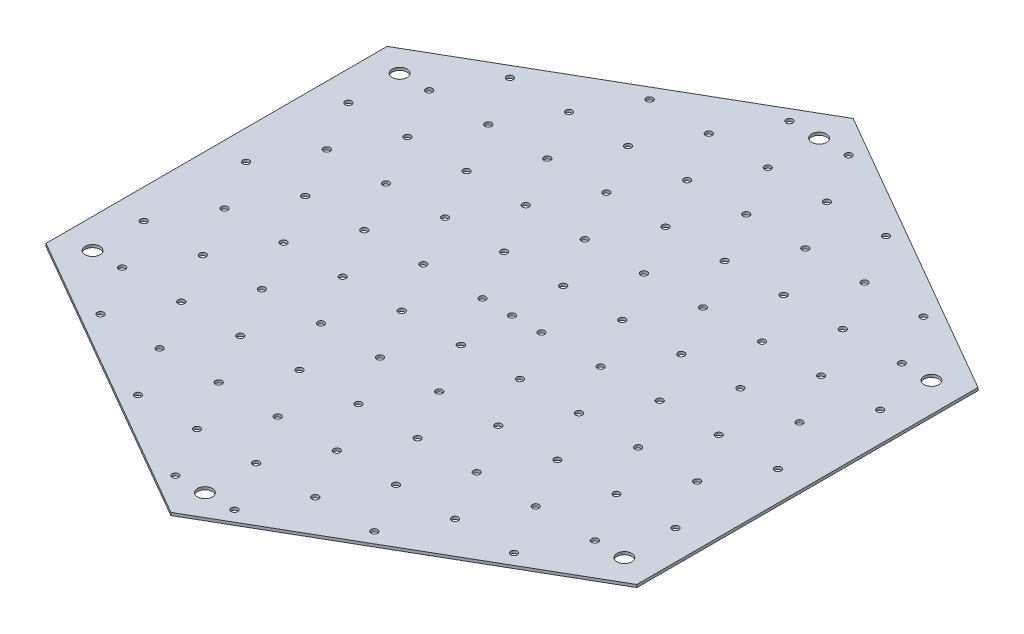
ISO-10303-21;
HEADER;
FILE_DESCRIPTION(('STEP AP214'),'2;1');
FILE_NAME('part.step','',(''),(''),'','','');
FILE_SCHEMA(('AUTOMOTIVE_DESIGN { 1 0 10303 214 1 1 1 1 }'));
ENDSEC;
DATA;
#1=APPLICATION_CONTEXT('core data for automotive mechanical design processes');
#2=APPLICATION_PROTOCOL_DEFINITION('international standard','automotive_design',2000,#1);
#3=PRODUCT_CONTEXT('',#1,'mechanical');
#4=PRODUCT('Part','Part','',(#3));
#5=PRODUCT_RELATED_PRODUCT_CATEGORY('part','',(#4));
#6=PRODUCT_DEFINITION_FORMATION('','',#4);
#7=PRODUCT_DEFINITION_CONTEXT('part definition',#1,'design');
#8=PRODUCT_DEFINITION('design','',#6,#7);
#9=PRODUCT_DEFINITION_SHAPE('','',#8);
#10=(LENGTH_UNIT() NAMED_UNIT(*) SI_UNIT(.MILLI.,.METRE.));
#11=(NAMED_UNIT(*) PLANE_ANGLE_UNIT() SI_UNIT($,.RADIAN.));
#12=(NAMED_UNIT(*) SI_UNIT($,.STERADIAN.) SOLID_ANGLE_UNIT());
#13=UNCERTAINTY_MEASURE_WITH_UNIT(LENGTH_MEASURE(1.E-05),#10,'distance_accuracy_value','');
#14=(GEOMETRIC_REPRESENTATION_CONTEXT(3) GLOBAL_UNCERTAINTY_ASSIGNED_CONTEXT((#13)) GLOBAL_UNIT_ASSIGNED_CONTEXT((#10,
#11,#12)) REPRESENTATION_CONTEXT('',''));
#15=CARTESIAN_POINT('',(0.,0.,0.));
#16=DIRECTION('',(0.,0.,1.));
#17=DIRECTION('',(1.,0.,0.));
#18=AXIS2_PLACEMENT_3D('',#15,#16,#17);
#19=CARTESIAN_POINT('',(54.1265877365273,0.5,-31.25));
#20=DIRECTION('',(-0.5,0.,0.866025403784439));
#21=DIRECTION('',(0.866025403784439,0.,0.5));
#22=AXIS2_PLACEMENT_3D('',#19,#20,#21);
#23=PLANE('',#22);
#24=DIRECTION('',(-0.866025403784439,0.,-0.5));
#25=VECTOR('',#24,1.);
#26=CARTESIAN_POINT('',(54.1265877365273,0.,-31.25));
#27=LINE('',#26,#25);
#28=CARTESIAN_POINT('',(54.1265877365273,0.,-31.25));
#29=VERTEX_POINT('',#28);
#30=CARTESIAN_POINT('',(0.,0.,-62.5));
#31=VERTEX_POINT('',#30);
#32=EDGE_CURVE('E117',#29,#31,#27,.T.);
#33=ORIENTED_EDGE('',*,*,#32,.T.);
#34=DIRECTION('',(0.,-1.,0.));
#35=VECTOR('',#34,1.);
#36=CARTESIAN_POINT('',(0.,0.5,-62.5));
#37=LINE('',#36,#35);
#38=CARTESIAN_POINT('',(0.,0.5,-62.5));
#39=VERTEX_POINT('',#38);
#40=EDGE_CURVE('E11',#39,#31,#37,.T.);
#41=ORIENTED_EDGE('',*,*,#40,.F.);
#42=DIRECTION('',(-0.866025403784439,0.,-0.5));
#43=VECTOR('',#42,1.);
#44=CARTESIAN_POINT('',(54.1265877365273,0.5,-31.25));
#45=LINE('',#44,#43);
#46=CARTESIAN_POINT('',(54.1265877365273,0.5,-31.25));
#47=VERTEX_POINT('',#46);
#48=EDGE_CURVE('E84',#47,#39,#45,.T.);
#49=ORIENTED_EDGE('',*,*,#48,.F.);
#50=DIRECTION('',(0.,-1.,0.));
#51=VECTOR('',#50,1.);
#52=CARTESIAN_POINT('',(54.1265877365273,0.5,-31.25));
#53=LINE('',#52,#51);
#54=EDGE_CURVE('E113',#47,#29,#53,.T.);
#55=ORIENTED_EDGE('',*,*,#54,.T.);
#56=EDGE_LOOP('',(#33,#41,#49,#55));
#57=FACE_BOUND('',#56,.T.);
#58=ADVANCED_FACE('F33',(#57),#23,.F.);
#59=CARTESIAN_POINT('',(0.,0.5,-62.5));
#60=DIRECTION('',(0.5,0.,0.866025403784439));
#61=DIRECTION('',(0.866025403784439,0.,-0.5));
#62=AXIS2_PLACEMENT_3D('',#59,#60,#61);
#63=PLANE('',#62);
#64=DIRECTION('',(0.,-1.,0.));
#65=VECTOR('',#64,1.);
#66=CARTESIAN_POINT('',(-54.1265877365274,0.5,-31.25));
#67=LINE('',#66,#65);
#68=CARTESIAN_POINT('',(-54.1265877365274,0.5,-31.25));
#69=VERTEX_POINT('',#68);
#70=CARTESIAN_POINT('',(-54.1265877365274,0.,-31.25));
#71=VERTEX_POINT('',#70);
#72=EDGE_CURVE('E41',#69,#71,#67,.T.);
#73=ORIENTED_EDGE('',*,*,#72,.F.);
#74=DIRECTION('',(-0.866025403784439,0.,0.5));
#75=VECTOR('',#74,1.);
#76=CARTESIAN_POINT('',(0.,0.5,-62.5));
#77=LINE('',#76,#75);
#78=EDGE_CURVE('E1858',#39,#69,#77,.T.);
#79=ORIENTED_EDGE('',*,*,#78,.F.);
#80=ORIENTED_EDGE('',*,*,#40,.T.);
#81=DIRECTION('',(-0.866025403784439,0.,0.5));
#82=VECTOR('',#81,1.);
#83=CARTESIAN_POINT('',(0.,0.,-62.5));
#84=LINE('',#83,#82);
#85=EDGE_CURVE('E119',#31,#71,#84,.T.);
#86=ORIENTED_EDGE('',*,*,#85,.T.);
#87=EDGE_LOOP('',(#73,#79,#80,#86));
#88=FACE_BOUND('',#87,.T.);
#89=ADVANCED_FACE('F154',(#88),#63,.F.);
#90=CARTESIAN_POINT('',(-54.1265877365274,0.5,-31.25));
#91=DIRECTION('',(1.,0.,0.));
#92=DIRECTION('',(0.,0.,-1.));
#93=AXIS2_PLACEMENT_3D('',#90,#91,#92);
#94=PLANE('',#93);
#95=DIRECTION('',(0.,0.,1.));
#96=VECTOR('',#95,1.);
#97=CARTESIAN_POINT('',(-54.1265877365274,0.,-31.25));
#98=LINE('',#97,#96);
#99=CARTESIAN_POINT('',(-54.1265877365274,0.,31.25));
#100=VERTEX_POINT('',#99);
#101=EDGE_CURVE('E122',#71,#100,#98,.T.);
#102=ORIENTED_EDGE('',*,*,#101,.T.);
#103=DIRECTION('',(0.,-1.,0.));
#104=VECTOR('',#103,1.);
#105=CARTESIAN_POINT('',(-54.1265877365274,0.5,31.25));
#106=LINE('',#105,#104);
#107=CARTESIAN_POINT('',(-54.1265877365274,0.5,31.25));
#108=VERTEX_POINT('',#107);
#109=EDGE_CURVE('E108',#108,#100,#106,.T.);
#110=ORIENTED_EDGE('',*,*,#109,.F.);
#111=DIRECTION('',(0.,0.,1.));
#112=VECTOR('',#111,1.);
#113=CARTESIAN_POINT('',(-54.1265877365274,0.5,-31.25));
#114=LINE('',#113,#112);
#115=EDGE_CURVE('E99',#69,#108,#114,.T.);
#116=ORIENTED_EDGE('',*,*,#115,.F.);
#117=ORIENTED_EDGE('',*,*,#72,.T.);
#118=EDGE_LOOP('',(#102,#110,#116,#117));
#119=FACE_BOUND('',#118,.T.);
#120=ADVANCED_FACE('F133',(#119),#94,.F.);
#121=CARTESIAN_POINT('',(-54.1265877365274,0.5,31.25));
#122=DIRECTION('',(0.5,0.,-0.866025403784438));
#123=DIRECTION('',(-0.866025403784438,0.,-0.5));
#124=AXIS2_PLACEMENT_3D('',#121,#122,#123);
#125=PLANE('',#124);
#126=DIRECTION('',(0.866025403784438,0.,0.5));
#127=VECTOR('',#126,1.);
#128=CARTESIAN_POINT('',(-54.1265877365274,0.,31.25));
#129=LINE('',#128,#127);
#130=CARTESIAN_POINT('',(0.,0.,62.5));
#131=VERTEX_POINT('',#130);
#132=EDGE_CURVE('E107',#100,#131,#129,.T.);
#133=ORIENTED_EDGE('',*,*,#132,.T.);
#134=DIRECTION('',(0.,-1.,0.));
#135=VECTOR('',#134,1.);
#136=CARTESIAN_POINT('',(0.,0.5,62.5));
#137=LINE('',#136,#135);
#138=CARTESIAN_POINT('',(0.,0.5,62.5));
#139=VERTEX_POINT('',#138);
#140=EDGE_CURVE('E104',#139,#131,#137,.T.);
#141=ORIENTED_EDGE('',*,*,#140,.F.);
#142=DIRECTION('',(0.866025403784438,0.,0.5));
#143=VECTOR('',#142,1.);
#144=CARTESIAN_POINT('',(-54.1265877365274,0.5,31.25));
#145=LINE('',#144,#143);
#146=EDGE_CURVE('E92',#108,#139,#145,.T.);
#147=ORIENTED_EDGE('',*,*,#146,.F.);
#148=ORIENTED_EDGE('',*,*,#109,.T.);
#149=EDGE_LOOP('',(#133,#141,#147,#148));
#150=FACE_BOUND('',#149,.T.);
#151=ADVANCED_FACE('F105',(#150),#125,.F.);
#152=CARTESIAN_POINT('',(0.,0.5,62.5));
#153=DIRECTION('',(-0.5,0.,-0.866025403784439));
#154=DIRECTION('',(-0.866025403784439,0.,0.5));
#155=AXIS2_PLACEMENT_3D('',#152,#153,#154);
#156=PLANE('',#155);
#157=DIRECTION('',(0.866025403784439,0.,-0.5));
#158=VECTOR('',#157,1.);
#159=CARTESIAN_POINT('',(0.,0.,62.5));
#160=LINE('',#159,#158);
#161=CARTESIAN_POINT('',(54.1265877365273,0.,31.25));
#162=VERTEX_POINT('',#161);
#163=EDGE_CURVE('E72',#131,#162,#160,.T.);
#164=ORIENTED_EDGE('',*,*,#163,.T.);
#165=DIRECTION('',(0.,-1.,0.));
#166=VECTOR('',#165,1.);
#167=CARTESIAN_POINT('',(54.1265877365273,0.5,31.25));
#168=LINE('',#167,#166);
#169=CARTESIAN_POINT('',(54.1265877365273,0.5,31.25));
#170=VERTEX_POINT('',#169);
#171=EDGE_CURVE('E109',#170,#162,#168,.T.);
#172=ORIENTED_EDGE('',*,*,#171,.F.);
#173=DIRECTION('',(0.866025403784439,0.,-0.5));
#174=VECTOR('',#173,1.);
#175=CARTESIAN_POINT('',(0.,0.5,62.5));
#176=LINE('',#175,#174);
#177=EDGE_CURVE('E97',#139,#170,#176,.T.);
#178=ORIENTED_EDGE('',*,*,#177,.F.);
#179=ORIENTED_EDGE('',*,*,#140,.T.);
#180=EDGE_LOOP('',(#164,#172,#178,#179));
#181=FACE_BOUND('',#180,.T.);
#182=ADVANCED_FACE('F111',(#181),#156,.F.);
#183=CARTESIAN_POINT('',(54.1265877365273,0.5,31.25));
#184=DIRECTION('',(-1.,0.,0.));
#185=DIRECTION('',(0.,0.,1.));
#186=AXIS2_PLACEMENT_3D('',#183,#184,#185);
#187=PLANE('',#186);
#188=ORIENTED_EDGE('',*,*,#54,.F.);
#189=DIRECTION('',(0.,0.,-1.));
#190=VECTOR('',#189,1.);
#191=CARTESIAN_POINT('',(54.1265877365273,0.5,31.25));
#192=LINE('',#191,#190);
#193=EDGE_CURVE('E49',#170,#47,#192,.T.);
#194=ORIENTED_EDGE('',*,*,#193,.F.);
#195=ORIENTED_EDGE('',*,*,#171,.T.);
#196=DIRECTION('',(0.,0.,-1.));
#197=VECTOR('',#196,1.);
#198=CARTESIAN_POINT('',(54.1265877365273,0.,31.25));
#199=LINE('',#198,#197);
#200=EDGE_CURVE('E78',#162,#29,#199,.T.);
#201=ORIENTED_EDGE('',*,*,#200,.T.);
#202=EDGE_LOOP('',(#188,#194,#195,#201));
#203=FACE_BOUND('',#202,.T.);
#204=ADVANCED_FACE('F142',(#203),#187,.F.);
#205=CARTESIAN_POINT('',(0.,0.5,0.));
#206=DIRECTION('',(0.,1.,0.));
#207=DIRECTION('',(0.,0.,1.));
#208=AXIS2_PLACEMENT_3D('',#205,#206,#207);
#209=PLANE('',#208);
#210=CARTESIAN_POINT('',(48.71385,0.5,-18.7499696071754));
#211=DIRECTION('',(0.,1.,0.));
#212=DIRECTION('',(0.,0.,1.));
#213=AXIS2_PLACEMENT_3D('',#210,#211,#212);
#214=CIRCLE('',#213,0.599999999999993);
#215=CARTESIAN_POINT('',(48.71385,0.5,-18.1499696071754));
#216=VERTEX_POINT('',#215);
#217=EDGE_CURVE('E1242',#216,#216,#214,.T.);
#218=ORIENTED_EDGE('',*,*,#217,.F.);
#219=EDGE_LOOP('',(#218));
#220=FACE_BOUND('',#219,.T.);
#221=CARTESIAN_POINT('',(43.3012,0.5,-28.1249544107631));
#222=DIRECTION('',(0.,1.,0.));
#223=DIRECTION('',(0.,0.,1.));
#224=AXIS2_PLACEMENT_3D('',#221,#222,#223);
#225=CIRCLE('',#224,0.6);
#226=CARTESIAN_POINT('',(43.3012,0.5,-27.5249544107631));
#227=VERTEX_POINT('',#226);
#228=EDGE_CURVE('E1244',#227,#227,#225,.T.);
#229=ORIENTED_EDGE('',*,*,#228,.F.);
#230=EDGE_LOOP('',(#229));
#231=FACE_BOUND('',#230,.T.);
#232=CARTESIAN_POINT('',(37.88855,0.5,-37.4999392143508));
#233=DIRECTION('',(0.,1.,0.));
#234=DIRECTION('',(0.,0.,1.));
#235=AXIS2_PLACEMENT_3D('',#232,#233,#234);
#236=CIRCLE('',#235,0.6);
#237=CARTESIAN_POINT('',(37.88855,0.5,-36.8999392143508));
#238=VERTEX_POINT('',#237);
#239=EDGE_CURVE('E1250',#238,#238,#236,.T.);
#240=ORIENTED_EDGE('',*,*,#239,.F.);
#241=EDGE_LOOP('',(#240));
#242=FACE_BOUND('',#241,.T.);
#243=CARTESIAN_POINT('',(-21.6506,0.5,46.8749240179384));
#244=DIRECTION('',(0.,1.,0.));
#245=DIRECTION('',(0.,0.,1.));
#246=AXIS2_PLACEMENT_3D('',#243,#244,#245);
#247=CIRCLE('',#246,0.600000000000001);
#248=CARTESIAN_POINT('',(-21.6506,0.5,47.4749240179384));
#249=VERTEX_POINT('',#248);
#250=EDGE_CURVE('E1256',#249,#249,#247,.T.);
#251=ORIENTED_EDGE('',*,*,#250,.F.);
#252=EDGE_LOOP('',(#251));
#253=FACE_BOUND('',#252,.T.);
#254=CARTESIAN_POINT('',(-5.41265000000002,0.5,56.2499088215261));
#255=DIRECTION('',(0.,1.,0.));
#256=DIRECTION('',(0.,0.,1.));
#257=AXIS2_PLACEMENT_3D('',#254,#255,#256);
#258=CIRCLE('',#257,0.600000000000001);
#259=CARTESIAN_POINT('',(-5.41265000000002,0.5,56.8499088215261));
#260=VERTEX_POINT('',#259);
#261=EDGE_CURVE('E1262',#260,#260,#258,.T.);
#262=ORIENTED_EDGE('',*,*,#261,.F.);
#263=EDGE_LOOP('',(#262));
#264=FACE_BOUND('',#263,.T.);
#265=CARTESIAN_POINT('',(-10.8253,0.5,46.8749240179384));
#266=DIRECTION('',(0.,1.,0.));
#267=DIRECTION('',(0.,0.,1.));
#268=AXIS2_PLACEMENT_3D('',#265,#266,#267);
#269=CIRCLE('',#268,0.600000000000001);
#270=CARTESIAN_POINT('',(-10.8253,0.5,47.4749240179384));
#271=VERTEX_POINT('',#270);
#272=EDGE_CURVE('E1268',#271,#271,#269,.T.);
#273=ORIENTED_EDGE('',*,*,#272,.F.);
#274=EDGE_LOOP('',(#273));
#275=FACE_BOUND('',#274,.T.);
#276=CARTESIAN_POINT('',(-16.23795,0.5,37.4999392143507));
#277=DIRECTION('',(0.,1.,0.));
#278=DIRECTION('',(0.,0.,1.));
#279=AXIS2_PLACEMENT_3D('',#276,#277,#278);
#280=CIRCLE('',#279,0.600000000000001);
#281=CARTESIAN_POINT('',(-16.23795,0.5,38.0999392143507));
#282=VERTEX_POINT('',#281);
#283=EDGE_CURVE('E1274',#282,#282,#280,.T.);
#284=ORIENTED_EDGE('',*,*,#283,.F.);
#285=EDGE_LOOP('',(#284));
#286=FACE_BOUND('',#285,.T.);
#287=CARTESIAN_POINT('',(-48.71385,0.5,-18.7499696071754));
#288=DIRECTION('',(0.,1.,0.));
#289=DIRECTION('',(0.,0.,1.));
#290=AXIS2_PLACEMENT_3D('',#287,#288,#289);
#291=CIRCLE('',#290,0.600000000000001);
#292=CARTESIAN_POINT('',(-48.71385,0.5,-18.1499696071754));
#293=VERTEX_POINT('',#292);
#294=EDGE_CURVE('E1280',#293,#293,#291,.T.);
#295=ORIENTED_EDGE('',*,*,#294,.F.);
#296=EDGE_LOOP('',(#295));
#297=FACE_BOUND('',#296,.T.);
#298=CARTESIAN_POINT('',(5.41264999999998,0.5,56.2499088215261));
#299=DIRECTION('',(0.,1.,0.));
#300=DIRECTION('',(0.,0.,1.));
#301=AXIS2_PLACEMENT_3D('',#298,#299,#300);
#302=CIRCLE('',#301,0.6);
#303=CARTESIAN_POINT('',(5.41264999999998,0.5,56.8499088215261));
#304=VERTEX_POINT('',#303);
#305=EDGE_CURVE('E1286',#304,#304,#302,.T.);
#306=ORIENTED_EDGE('',*,*,#305,.F.);
#307=EDGE_LOOP('',(#306));
#308=FACE_BOUND('',#307,.T.);
#309=CARTESIAN_POINT('',(0.,0.5,46.8749240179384));
#310=DIRECTION('',(0.,1.,0.));
#311=DIRECTION('',(0.,0.,1.));
#312=AXIS2_PLACEMENT_3D('',#309,#310,#311);
#313=CIRCLE('',#312,0.6);
#314=CARTESIAN_POINT('',(0.,0.5,47.4749240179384));
#315=VERTEX_POINT('',#314);
#316=EDGE_CURVE('E1292',#315,#315,#313,.T.);
#317=ORIENTED_EDGE('',*,*,#316,.F.);
#318=EDGE_LOOP('',(#317));
#319=FACE_BOUND('',#318,.T.);
#320=CARTESIAN_POINT('',(-5.41265000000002,0.5,37.4999392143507));
#321=DIRECTION('',(0.,1.,0.));
#322=DIRECTION('',(0.,0.,1.));
#323=AXIS2_PLACEMENT_3D('',#320,#321,#322);
#324=CIRCLE('',#323,0.6);
#325=CARTESIAN_POINT('',(-5.41265000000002,0.5,38.0999392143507));
#326=VERTEX_POINT('',#325);
#327=EDGE_CURVE('E1298',#326,#326,#324,.T.);
#328=ORIENTED_EDGE('',*,*,#327,.F.);
#329=EDGE_LOOP('',(#328));
#330=FACE_BOUND('',#329,.T.);
#331=CARTESIAN_POINT('',(-10.8253,0.5,28.124954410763));
#332=DIRECTION('',(0.,1.,0.));
#333=DIRECTION('',(0.,0.,1.));
#334=AXIS2_PLACEMENT_3D('',#331,#332,#333);
#335=CIRCLE('',#334,0.6);
#336=CARTESIAN_POINT('',(-10.8253,0.5,28.7249544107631));
#337=VERTEX_POINT('',#336);
#338=EDGE_CURVE('E1304',#337,#337,#335,.T.);
#339=ORIENTED_EDGE('',*,*,#338,.F.);
#340=EDGE_LOOP('',(#339));
#341=FACE_BOUND('',#340,.T.);
#342=CARTESIAN_POINT('',(-43.3012,0.5,-28.1249544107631));
#343=DIRECTION('',(0.,1.,0.));
#344=DIRECTION('',(0.,0.,1.));
#345=AXIS2_PLACEMENT_3D('',#342,#343,#344);
#346=CIRCLE('',#345,0.6);
#347=CARTESIAN_POINT('',(-43.3012,0.5,-27.5249544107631));
#348=VERTEX_POINT('',#347);
#349=EDGE_CURVE('E1310',#348,#348,#346,.T.);
#350=ORIENTED_EDGE('',*,*,#349,.F.);
#351=EDGE_LOOP('',(#350));
#352=FACE_BOUND('',#351,.T.);
#353=CARTESIAN_POINT('',(10.8253,0.5,46.8749240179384));
#354=DIRECTION('',(0.,1.,0.));
#355=DIRECTION('',(0.,0.,1.));
#356=AXIS2_PLACEMENT_3D('',#353,#354,#355);
#357=CIRCLE('',#356,0.6);
#358=CARTESIAN_POINT('',(10.8253,0.5,47.4749240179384));
#359=VERTEX_POINT('',#358);
#360=EDGE_CURVE('E1316',#359,#359,#357,.T.);
#361=ORIENTED_EDGE('',*,*,#360,.F.);
#362=EDGE_LOOP('',(#361));
#363=FACE_BOUND('',#362,.T.);
#364=CARTESIAN_POINT('',(5.41264999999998,0.5,37.4999392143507));
#365=DIRECTION('',(0.,1.,0.));
#366=DIRECTION('',(0.,0.,1.));
#367=AXIS2_PLACEMENT_3D('',#364,#365,#366);
#368=CIRCLE('',#367,0.6);
#369=CARTESIAN_POINT('',(5.41264999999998,0.5,38.0999392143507));
#370=VERTEX_POINT('',#369);
#371=EDGE_CURVE('E1322',#370,#370,#368,.T.);
#372=ORIENTED_EDGE('',*,*,#371,.F.);
#373=EDGE_LOOP('',(#372));
#374=FACE_BOUND('',#373,.T.);
#375=CARTESIAN_POINT('',(0.,0.5,28.124954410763));
#376=DIRECTION('',(0.,1.,0.));
#377=DIRECTION('',(0.,0.,1.));
#378=AXIS2_PLACEMENT_3D('',#375,#376,#377);
#379=CIRCLE('',#378,0.6);
#380=CARTESIAN_POINT('',(0.,0.5,28.7249544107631));
#381=VERTEX_POINT('',#380);
#382=EDGE_CURVE('E1328',#381,#381,#379,.T.);
#383=ORIENTED_EDGE('',*,*,#382,.F.);
#384=EDGE_LOOP('',(#383));
#385=FACE_BOUND('',#384,.T.);
#386=CARTESIAN_POINT('',(-5.41265000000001,0.5,18.7499696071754));
#387=DIRECTION('',(0.,1.,0.));
#388=DIRECTION('',(0.,0.,1.));
#389=AXIS2_PLACEMENT_3D('',#386,#387,#388);
#390=CIRCLE('',#389,0.6);
#391=CARTESIAN_POINT('',(-5.41265000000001,0.5,19.3499696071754));
#392=VERTEX_POINT('',#391);
#393=EDGE_CURVE('E1334',#392,#392,#390,.T.);
#394=ORIENTED_EDGE('',*,*,#393,.F.);
#395=EDGE_LOOP('',(#394));
#396=FACE_BOUND('',#395,.T.);
#397=CARTESIAN_POINT('',(-37.88855,0.5,-37.4999392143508));
#398=DIRECTION('',(0.,1.,0.));
#399=DIRECTION('',(0.,0.,1.));
#400=AXIS2_PLACEMENT_3D('',#397,#398,#399);
#401=CIRCLE('',#400,0.6);
#402=CARTESIAN_POINT('',(-37.88855,0.5,-36.8999392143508));
#403=VERTEX_POINT('',#402);
#404=EDGE_CURVE('E1340',#403,#403,#401,.T.);
#405=ORIENTED_EDGE('',*,*,#404,.F.);
#406=EDGE_LOOP('',(#405));
#407=FACE_BOUND('',#406,.T.);
#408=CARTESIAN_POINT('',(21.6506,0.5,46.8749240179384));
#409=DIRECTION('',(0.,1.,0.));
#410=DIRECTION('',(0.,0.,1.));
#411=AXIS2_PLACEMENT_3D('',#408,#409,#410);
#412=CIRCLE('',#411,0.6);
#413=CARTESIAN_POINT('',(21.6506,0.5,47.4749240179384));
#414=VERTEX_POINT('',#413);
#415=EDGE_CURVE('E1346',#414,#414,#412,.T.);
#416=ORIENTED_EDGE('',*,*,#415,.F.);
#417=EDGE_LOOP('',(#416));
#418=FACE_BOUND('',#417,.T.);
#419=CARTESIAN_POINT('',(16.23795,0.5,37.4999392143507));
#420=DIRECTION('',(0.,1.,0.));
#421=DIRECTION('',(0.,0.,1.));
#422=AXIS2_PLACEMENT_3D('',#419,#420,#421);
#423=CIRCLE('',#422,0.6);
#424=CARTESIAN_POINT('',(16.23795,0.5,38.0999392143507));
#425=VERTEX_POINT('',#424);
#426=EDGE_CURVE('E1352',#425,#425,#423,.T.);
#427=ORIENTED_EDGE('',*,*,#426,.F.);
#428=EDGE_LOOP('',(#427));
#429=FACE_BOUND('',#428,.T.);
#430=CARTESIAN_POINT('',(10.8253,0.5,28.124954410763));
#431=DIRECTION('',(0.,1.,0.));
#432=DIRECTION('',(0.,0.,1.));
#433=AXIS2_PLACEMENT_3D('',#430,#431,#432);
#434=CIRCLE('',#433,0.6);
#435=CARTESIAN_POINT('',(10.8253,0.5,28.7249544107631));
#436=VERTEX_POINT('',#435);
#437=EDGE_CURVE('E1358',#436,#436,#434,.T.);
#438=ORIENTED_EDGE('',*,*,#437,.F.);
#439=EDGE_LOOP('',(#438));
#440=FACE_BOUND('',#439,.T.);
#441=CARTESIAN_POINT('',(5.41264999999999,0.5,18.7499696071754));
#442=DIRECTION('',(0.,1.,0.));
#443=DIRECTION('',(0.,0.,1.));
#444=AXIS2_PLACEMENT_3D('',#441,#442,#443);
#445=CIRCLE('',#444,0.6);
#446=CARTESIAN_POINT('',(5.41264999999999,0.5,19.3499696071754));
#447=VERTEX_POINT('',#446);
#448=EDGE_CURVE('E1364',#447,#447,#445,.T.);
#449=ORIENTED_EDGE('',*,*,#448,.F.);
#450=EDGE_LOOP('',(#449));
#451=FACE_BOUND('',#450,.T.);
#452=CARTESIAN_POINT('',(0.,0.5,9.37498480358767));
#453=DIRECTION('',(0.,1.,0.));
#454=DIRECTION('',(0.,0.,1.));
#455=AXIS2_PLACEMENT_3D('',#452,#453,#454);
#456=CIRCLE('',#455,0.6);
#457=CARTESIAN_POINT('',(0.,0.5,9.97498480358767));
#458=VERTEX_POINT('',#457);
#459=EDGE_CURVE('E1370',#458,#458,#456,.T.);
#460=ORIENTED_EDGE('',*,*,#459,.F.);
#461=EDGE_LOOP('',(#460));
#462=FACE_BOUND('',#461,.T.);
#463=CARTESIAN_POINT('',(-27.06325,0.5,-37.4999392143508));
#464=DIRECTION('',(0.,1.,0.));
#465=DIRECTION('',(0.,0.,1.));
#466=AXIS2_PLACEMENT_3D('',#463,#464,#465);
#467=CIRCLE('',#466,0.600000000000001);
#468=CARTESIAN_POINT('',(-27.06325,0.5,-36.8999392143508));
#469=VERTEX_POINT('',#468);
#470=EDGE_CURVE('E1376',#469,#469,#467,.T.);
#471=ORIENTED_EDGE('',*,*,#470,.F.);
#472=EDGE_LOOP('',(#471));
#473=FACE_BOUND('',#472,.T.);
#474=CARTESIAN_POINT('',(-32.4759,0.5,-28.1249544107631));
#475=DIRECTION('',(0.,1.,0.));
#476=DIRECTION('',(0.,0.,1.));
#477=AXIS2_PLACEMENT_3D('',#474,#475,#476);
#478=CIRCLE('',#477,0.600000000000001);
#479=CARTESIAN_POINT('',(-32.4759,0.5,-27.5249544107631));
#480=VERTEX_POINT('',#479);
#481=EDGE_CURVE('E1382',#480,#480,#478,.T.);
#482=ORIENTED_EDGE('',*,*,#481,.F.);
#483=EDGE_LOOP('',(#482));
#484=FACE_BOUND('',#483,.T.);
#485=CARTESIAN_POINT('',(-37.88855,0.5,-18.7499696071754));
#486=DIRECTION('',(0.,1.,0.));
#487=DIRECTION('',(0.,0.,1.));
#488=AXIS2_PLACEMENT_3D('',#485,#486,#487);
#489=CIRCLE('',#488,0.600000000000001);
#490=CARTESIAN_POINT('',(-37.88855,0.5,-18.1499696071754));
#491=VERTEX_POINT('',#490);
#492=EDGE_CURVE('E1388',#491,#491,#489,.T.);
#493=ORIENTED_EDGE('',*,*,#492,.F.);
#494=EDGE_LOOP('',(#493));
#495=FACE_BOUND('',#494,.T.);
#496=CARTESIAN_POINT('',(-43.3012,0.5,-9.3749848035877));
#497=DIRECTION('',(0.,1.,0.));
#498=DIRECTION('',(0.,0.,1.));
#499=AXIS2_PLACEMENT_3D('',#496,#497,#498);
#500=CIRCLE('',#499,0.600000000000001);
#501=CARTESIAN_POINT('',(-43.3012,0.5,-8.7749848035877));
#502=VERTEX_POINT('',#501);
#503=EDGE_CURVE('E1394',#502,#502,#500,.T.);
#504=ORIENTED_EDGE('',*,*,#503,.F.);
#505=EDGE_LOOP('',(#504));
#506=FACE_BOUND('',#505,.T.);
#507=CARTESIAN_POINT('',(-21.6506,0.5,-28.1249544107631));
#508=DIRECTION('',(0.,1.,0.));
#509=DIRECTION('',(0.,0.,1.));
#510=AXIS2_PLACEMENT_3D('',#507,#508,#509);
#511=CIRCLE('',#510,0.600000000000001);
#512=CARTESIAN_POINT('',(-21.6506,0.5,-27.5249544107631));
#513=VERTEX_POINT('',#512);
#514=EDGE_CURVE('E1400',#513,#513,#511,.T.);
#515=ORIENTED_EDGE('',*,*,#514,.F.);
#516=EDGE_LOOP('',(#515));
#517=FACE_BOUND('',#516,.T.);
#518=CARTESIAN_POINT('',(-27.06325,0.5,-18.7499696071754));
#519=DIRECTION('',(0.,1.,0.));
#520=DIRECTION('',(0.,0.,1.));
#521=AXIS2_PLACEMENT_3D('',#518,#519,#520);
#522=CIRCLE('',#521,0.600000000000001);
#523=CARTESIAN_POINT('',(-27.06325,0.5,-18.1499696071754));
#524=VERTEX_POINT('',#523);
#525=EDGE_CURVE('E1406',#524,#524,#522,.T.);
#526=ORIENTED_EDGE('',*,*,#525,.F.);
#527=EDGE_LOOP('',(#526));
#528=FACE_BOUND('',#527,.T.);
#529=CARTESIAN_POINT('',(-32.4759,0.5,-9.3749848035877));
#530=DIRECTION('',(0.,1.,0.));
#531=DIRECTION('',(0.,0.,1.));
#532=AXIS2_PLACEMENT_3D('',#529,#530,#531);
#533=CIRCLE('',#532,0.600000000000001);
#534=CARTESIAN_POINT('',(-32.4759,0.5,-8.7749848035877));
#535=VERTEX_POINT('',#534);
#536=EDGE_CURVE('E1412',#535,#535,#533,.T.);
#537=ORIENTED_EDGE('',*,*,#536,.F.);
#538=EDGE_LOOP('',(#537));
#539=FACE_BOUND('',#538,.T.);
#540=CARTESIAN_POINT('',(-48.71385,0.5,18.7499696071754));
#541=DIRECTION('',(0.,1.,0.));
#542=DIRECTION('',(0.,0.,1.));
#543=AXIS2_PLACEMENT_3D('',#540,#541,#542);
#544=CIRCLE('',#543,0.600000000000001);
#545=CARTESIAN_POINT('',(-48.71385,0.5,19.3499696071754));
#546=VERTEX_POINT('',#545);
#547=EDGE_CURVE('E1418',#546,#546,#544,.T.);
#548=ORIENTED_EDGE('',*,*,#547,.F.);
#549=EDGE_LOOP('',(#548));
#550=FACE_BOUND('',#549,.T.);
#551=CARTESIAN_POINT('',(-43.3012,0.5,9.37498480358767));
#552=DIRECTION('',(0.,1.,0.));
#553=DIRECTION('',(0.,0.,1.));
#554=AXIS2_PLACEMENT_3D('',#551,#552,#553);
#555=CIRCLE('',#554,0.600000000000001);
#556=CARTESIAN_POINT('',(-43.3012,0.5,9.97498480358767));
#557=VERTEX_POINT('',#556);
#558=EDGE_CURVE('E1424',#557,#557,#555,.T.);
#559=ORIENTED_EDGE('',*,*,#558,.F.);
#560=EDGE_LOOP('',(#559));
#561=FACE_BOUND('',#560,.T.);
#562=CARTESIAN_POINT('',(-43.3012,0.5,28.124954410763));
#563=DIRECTION('',(0.,1.,0.));
#564=DIRECTION('',(0.,0.,1.));
#565=AXIS2_PLACEMENT_3D('',#562,#563,#564);
#566=CIRCLE('',#565,0.6);
#567=CARTESIAN_POINT('',(-43.3012,0.5,28.7249544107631));
#568=VERTEX_POINT('',#567);
#569=EDGE_CURVE('E1430',#568,#568,#566,.T.);
#570=ORIENTED_EDGE('',*,*,#569,.F.);
#571=EDGE_LOOP('',(#570));
#572=FACE_BOUND('',#571,.T.);
#573=CARTESIAN_POINT('',(-37.88855,0.5,18.7499696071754));
#574=DIRECTION('',(0.,1.,0.));
#575=DIRECTION('',(0.,0.,1.));
#576=AXIS2_PLACEMENT_3D('',#573,#574,#575);
#577=CIRCLE('',#576,0.6);
#578=CARTESIAN_POINT('',(-37.88855,0.5,19.3499696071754));
#579=VERTEX_POINT('',#578);
#580=EDGE_CURVE('E1436',#579,#579,#577,.T.);
#581=ORIENTED_EDGE('',*,*,#580,.F.);
#582=EDGE_LOOP('',(#581));
#583=FACE_BOUND('',#582,.T.);
#584=CARTESIAN_POINT('',(-32.4759,0.5,9.37498480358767));
#585=DIRECTION('',(0.,1.,0.));
#586=DIRECTION('',(0.,0.,1.));
#587=AXIS2_PLACEMENT_3D('',#584,#585,#586);
#588=CIRCLE('',#587,0.6);
#589=CARTESIAN_POINT('',(-32.4759,0.5,9.97498480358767));
#590=VERTEX_POINT('',#589);
#591=EDGE_CURVE('E1442',#590,#590,#588,.T.);
#592=ORIENTED_EDGE('',*,*,#591,.F.);
#593=EDGE_LOOP('',(#592));
#594=FACE_BOUND('',#593,.T.);
#595=CARTESIAN_POINT('',(-16.23795,0.5,-18.7499696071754));
#596=DIRECTION('',(0.,1.,0.));
#597=DIRECTION('',(0.,0.,1.));
#598=AXIS2_PLACEMENT_3D('',#595,#596,#597);
#599=CIRCLE('',#598,0.6);
#600=CARTESIAN_POINT('',(-16.23795,0.5,-18.1499696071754));
#601=VERTEX_POINT('',#600);
#602=EDGE_CURVE('E1448',#601,#601,#599,.T.);
#603=ORIENTED_EDGE('',*,*,#602,.F.);
#604=EDGE_LOOP('',(#603));
#605=FACE_BOUND('',#604,.T.);
#606=CARTESIAN_POINT('',(-21.6506,0.5,-9.3749848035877));
#607=DIRECTION('',(0.,1.,0.));
#608=DIRECTION('',(0.,0.,1.));
#609=AXIS2_PLACEMENT_3D('',#606,#607,#608);
#610=CIRCLE('',#609,0.6);
#611=CARTESIAN_POINT('',(-21.6506,0.5,-8.7749848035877));
#612=VERTEX_POINT('',#611);
#613=EDGE_CURVE('E1454',#612,#612,#610,.T.);
#614=ORIENTED_EDGE('',*,*,#613,.F.);
#615=EDGE_LOOP('',(#614));
#616=FACE_BOUND('',#615,.T.);
#617=CARTESIAN_POINT('',(-37.88855,0.5,37.4999392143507));
#618=DIRECTION('',(0.,1.,0.));
#619=DIRECTION('',(0.,0.,1.));
#620=AXIS2_PLACEMENT_3D('',#617,#618,#619);
#621=CIRCLE('',#620,0.6);
#622=CARTESIAN_POINT('',(-37.88855,0.5,38.0999392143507));
#623=VERTEX_POINT('',#622);
#624=EDGE_CURVE('E1460',#623,#623,#621,.T.);
#625=ORIENTED_EDGE('',*,*,#624,.F.);
#626=EDGE_LOOP('',(#625));
#627=FACE_BOUND('',#626,.T.);
#628=CARTESIAN_POINT('',(-32.4759,0.5,28.124954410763));
#629=DIRECTION('',(0.,1.,0.));
#630=DIRECTION('',(0.,0.,1.));
#631=AXIS2_PLACEMENT_3D('',#628,#629,#630);
#632=CIRCLE('',#631,0.6);
#633=CARTESIAN_POINT('',(-32.4759,0.5,28.7249544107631));
#634=VERTEX_POINT('',#633);
#635=EDGE_CURVE('E1466',#634,#634,#632,.T.);
#636=ORIENTED_EDGE('',*,*,#635,.F.);
#637=EDGE_LOOP('',(#636));
#638=FACE_BOUND('',#637,.T.);
#639=CARTESIAN_POINT('',(-27.06325,0.5,18.7499696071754));
#640=DIRECTION('',(0.,1.,0.));
#641=DIRECTION('',(0.,0.,1.));
#642=AXIS2_PLACEMENT_3D('',#639,#640,#641);
#643=CIRCLE('',#642,0.6);
#644=CARTESIAN_POINT('',(-27.06325,0.5,19.3499696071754));
#645=VERTEX_POINT('',#644);
#646=EDGE_CURVE('E1472',#645,#645,#643,.T.);
#647=ORIENTED_EDGE('',*,*,#646,.F.);
#648=EDGE_LOOP('',(#647));
#649=FACE_BOUND('',#648,.T.);
#650=CARTESIAN_POINT('',(-21.6506,0.5,9.37498480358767));
#651=DIRECTION('',(0.,1.,0.));
#652=DIRECTION('',(0.,0.,1.));
#653=AXIS2_PLACEMENT_3D('',#650,#651,#652);
#654=CIRCLE('',#653,0.6);
#655=CARTESIAN_POINT('',(-21.6506,0.5,9.97498480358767));
#656=VERTEX_POINT('',#655);
#657=EDGE_CURVE('E1478',#656,#656,#654,.T.);
#658=ORIENTED_EDGE('',*,*,#657,.F.);
#659=EDGE_LOOP('',(#658));
#660=FACE_BOUND('',#659,.T.);
#661=CARTESIAN_POINT('',(-10.8253,0.5,-9.3749848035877));
#662=DIRECTION('',(0.,1.,0.));
#663=DIRECTION('',(0.,0.,1.));
#664=AXIS2_PLACEMENT_3D('',#661,#662,#663);
#665=CIRCLE('',#664,0.6);
#666=CARTESIAN_POINT('',(-10.8253,0.5,-8.7749848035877));
#667=VERTEX_POINT('',#666);
#668=EDGE_CURVE('E1484',#667,#667,#665,.T.);
#669=ORIENTED_EDGE('',*,*,#668,.F.);
#670=EDGE_LOOP('',(#669));
#671=FACE_BOUND('',#670,.T.);
#672=CARTESIAN_POINT('',(-27.06325,0.5,37.4999392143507));
#673=DIRECTION('',(0.,1.,0.));
#674=DIRECTION('',(0.,0.,1.));
#675=AXIS2_PLACEMENT_3D('',#672,#673,#674);
#676=CIRCLE('',#675,0.6);
#677=CARTESIAN_POINT('',(-27.06325,0.5,38.0999392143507));
#678=VERTEX_POINT('',#677);
#679=EDGE_CURVE('E1490',#678,#678,#676,.T.);
#680=ORIENTED_EDGE('',*,*,#679,.F.);
#681=EDGE_LOOP('',(#680));
#682=FACE_BOUND('',#681,.T.);
#683=CARTESIAN_POINT('',(-21.6506,0.5,28.124954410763));
#684=DIRECTION('',(0.,1.,0.));
#685=DIRECTION('',(0.,0.,1.));
#686=AXIS2_PLACEMENT_3D('',#683,#684,#685);
#687=CIRCLE('',#686,0.6);
#688=CARTESIAN_POINT('',(-21.6506,0.5,28.7249544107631));
#689=VERTEX_POINT('',#688);
#690=EDGE_CURVE('E1496',#689,#689,#687,.T.);
#691=ORIENTED_EDGE('',*,*,#690,.F.);
#692=EDGE_LOOP('',(#691));
#693=FACE_BOUND('',#692,.T.);
#694=CARTESIAN_POINT('',(-16.23795,0.5,18.7499696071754));
#695=DIRECTION('',(0.,1.,0.));
#696=DIRECTION('',(0.,0.,1.));
#697=AXIS2_PLACEMENT_3D('',#694,#695,#696);
#698=CIRCLE('',#697,0.6);
#699=CARTESIAN_POINT('',(-16.23795,0.5,19.3499696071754));
#700=VERTEX_POINT('',#699);
#701=EDGE_CURVE('E1502',#700,#700,#698,.T.);
#702=ORIENTED_EDGE('',*,*,#701,.F.);
#703=EDGE_LOOP('',(#702));
#704=FACE_BOUND('',#703,.T.);
#705=CARTESIAN_POINT('',(-10.8253,0.5,9.37498480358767));
#706=DIRECTION('',(0.,1.,0.));
#707=DIRECTION('',(0.,0.,1.));
#708=AXIS2_PLACEMENT_3D('',#705,#706,#707);
#709=CIRCLE('',#708,0.6);
#710=CARTESIAN_POINT('',(-10.8253,0.5,9.97498480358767));
#711=VERTEX_POINT('',#710);
#712=EDGE_CURVE('E1508',#711,#711,#709,.T.);
#713=ORIENTED_EDGE('',*,*,#712,.F.);
#714=EDGE_LOOP('',(#713));
#715=FACE_BOUND('',#714,.T.);
#716=CARTESIAN_POINT('',(21.6506,0.5,-46.8749240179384));
#717=DIRECTION('',(0.,1.,0.));
#718=DIRECTION('',(0.,0.,1.));
#719=AXIS2_PLACEMENT_3D('',#716,#717,#718);
#720=CIRCLE('',#719,0.600000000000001);
#721=CARTESIAN_POINT('',(21.6506,0.5,-46.2749240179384));
#722=VERTEX_POINT('',#721);
#723=EDGE_CURVE('E1514',#722,#722,#720,.T.);
#724=ORIENTED_EDGE('',*,*,#723,.F.);
#725=EDGE_LOOP('',(#724));
#726=FACE_BOUND('',#725,.T.);
#727=CARTESIAN_POINT('',(27.06325,0.5,-37.4999392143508));
#728=DIRECTION('',(0.,1.,0.));
#729=DIRECTION('',(0.,0.,1.));
#730=AXIS2_PLACEMENT_3D('',#727,#728,#729);
#731=CIRCLE('',#730,0.600000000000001);
#732=CARTESIAN_POINT('',(27.06325,0.5,-36.8999392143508));
#733=VERTEX_POINT('',#732);
#734=EDGE_CURVE('E1520',#733,#733,#731,.T.);
#735=ORIENTED_EDGE('',*,*,#734,.F.);
#736=EDGE_LOOP('',(#735));
#737=FACE_BOUND('',#736,.T.);
#738=CARTESIAN_POINT('',(32.4759,0.5,-28.1249544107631));
#739=DIRECTION('',(0.,1.,0.));
#740=DIRECTION('',(0.,0.,1.));
#741=AXIS2_PLACEMENT_3D('',#738,#739,#740);
#742=CIRCLE('',#741,0.600000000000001);
#743=CARTESIAN_POINT('',(32.4759,0.5,-27.5249544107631));
#744=VERTEX_POINT('',#743);
#745=EDGE_CURVE('E1526',#744,#744,#742,.T.);
#746=ORIENTED_EDGE('',*,*,#745,.F.);
#747=EDGE_LOOP('',(#746));
#748=FACE_BOUND('',#747,.T.);
#749=CARTESIAN_POINT('',(37.88855,0.5,-18.7499696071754));
#750=DIRECTION('',(0.,1.,0.));
#751=DIRECTION('',(0.,0.,1.));
#752=AXIS2_PLACEMENT_3D('',#749,#750,#751);
#753=CIRCLE('',#752,0.600000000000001);
#754=CARTESIAN_POINT('',(37.88855,0.5,-18.1499696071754));
#755=VERTEX_POINT('',#754);
#756=EDGE_CURVE('E1532',#755,#755,#753,.T.);
#757=ORIENTED_EDGE('',*,*,#756,.F.);
#758=EDGE_LOOP('',(#757));
#759=FACE_BOUND('',#758,.T.);
#760=CARTESIAN_POINT('',(43.3012,0.5,-9.3749848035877));
#761=DIRECTION('',(0.,1.,0.));
#762=DIRECTION('',(0.,0.,1.));
#763=AXIS2_PLACEMENT_3D('',#760,#761,#762);
#764=CIRCLE('',#763,0.600000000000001);
#765=CARTESIAN_POINT('',(43.3012,0.5,-8.7749848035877));
#766=VERTEX_POINT('',#765);
#767=EDGE_CURVE('E1538',#766,#766,#764,.T.);
#768=ORIENTED_EDGE('',*,*,#767,.F.);
#769=EDGE_LOOP('',(#768));
#770=FACE_BOUND('',#769,.T.);
#771=CARTESIAN_POINT('',(48.71385,0.5,18.7499696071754));
#772=DIRECTION('',(0.,1.,0.));
#773=DIRECTION('',(0.,0.,1.));
#774=AXIS2_PLACEMENT_3D('',#771,#772,#773);
#775=CIRCLE('',#774,0.599999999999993);
#776=CARTESIAN_POINT('',(48.71385,0.5,19.3499696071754));
#777=VERTEX_POINT('',#776);
#778=EDGE_CURVE('E1544',#777,#777,#775,.T.);
#779=ORIENTED_EDGE('',*,*,#778,.F.);
#780=EDGE_LOOP('',(#779));
#781=FACE_BOUND('',#780,.T.);
#782=CARTESIAN_POINT('',(43.3012,0.5,9.37498480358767));
#783=DIRECTION('',(0.,1.,0.));
#784=DIRECTION('',(0.,0.,1.));
#785=AXIS2_PLACEMENT_3D('',#782,#783,#784);
#786=CIRCLE('',#785,0.599999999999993);
#787=CARTESIAN_POINT('',(43.3012,0.5,9.97498480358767));
#788=VERTEX_POINT('',#787);
#789=EDGE_CURVE('E1550',#788,#788,#786,.T.);
#790=ORIENTED_EDGE('',*,*,#789,.F.);
#791=EDGE_LOOP('',(#790));
#792=FACE_BOUND('',#791,.T.);
#793=CARTESIAN_POINT('',(5.41265000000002,0.5,-56.2499088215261));
#794=DIRECTION('',(0.,1.,0.));
#795=DIRECTION('',(0.,0.,1.));
#796=AXIS2_PLACEMENT_3D('',#793,#794,#795);
#797=CIRCLE('',#796,0.599999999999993);
#798=CARTESIAN_POINT('',(5.41265000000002,0.5,-55.6499088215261));
#799=VERTEX_POINT('',#798);
#800=EDGE_CURVE('E1556',#799,#799,#797,.T.);
#801=ORIENTED_EDGE('',*,*,#800,.F.);
#802=EDGE_LOOP('',(#801));
#803=FACE_BOUND('',#802,.T.);
#804=CARTESIAN_POINT('',(10.8253,0.5,-46.8749240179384));
#805=DIRECTION('',(0.,1.,0.));
#806=DIRECTION('',(0.,0.,1.));
#807=AXIS2_PLACEMENT_3D('',#804,#805,#806);
#808=CIRCLE('',#807,0.599999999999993);
#809=CARTESIAN_POINT('',(10.8253,0.5,-46.2749240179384));
#810=VERTEX_POINT('',#809);
#811=EDGE_CURVE('E1562',#810,#810,#808,.T.);
#812=ORIENTED_EDGE('',*,*,#811,.F.);
#813=EDGE_LOOP('',(#812));
#814=FACE_BOUND('',#813,.T.);
#815=CARTESIAN_POINT('',(16.23795,0.5,-37.4999392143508));
#816=DIRECTION('',(0.,1.,0.));
#817=DIRECTION('',(0.,0.,1.));
#818=AXIS2_PLACEMENT_3D('',#815,#816,#817);
#819=CIRCLE('',#818,0.599999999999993);
#820=CARTESIAN_POINT('',(16.23795,0.5,-36.8999392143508));
#821=VERTEX_POINT('',#820);
#822=EDGE_CURVE('E1568',#821,#821,#819,.T.);
#823=ORIENTED_EDGE('',*,*,#822,.F.);
#824=EDGE_LOOP('',(#823));
#825=FACE_BOUND('',#824,.T.);
#826=CARTESIAN_POINT('',(21.6506,0.5,-28.1249544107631));
#827=DIRECTION('',(0.,1.,0.));
#828=DIRECTION('',(0.,0.,1.));
#829=AXIS2_PLACEMENT_3D('',#826,#827,#828);
#830=CIRCLE('',#829,0.599999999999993);
#831=CARTESIAN_POINT('',(21.6506,0.5,-27.5249544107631));
#832=VERTEX_POINT('',#831);
#833=EDGE_CURVE('E1574',#832,#832,#830,.T.);
#834=ORIENTED_EDGE('',*,*,#833,.F.);
#835=EDGE_LOOP('',(#834));
#836=FACE_BOUND('',#835,.T.);
#837=CARTESIAN_POINT('',(27.06325,0.5,-18.7499696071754));
#838=DIRECTION('',(0.,1.,0.));
#839=DIRECTION('',(0.,0.,1.));
#840=AXIS2_PLACEMENT_3D('',#837,#838,#839);
#841=CIRCLE('',#840,0.599999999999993);
#842=CARTESIAN_POINT('',(27.06325,0.5,-18.1499696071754));
#843=VERTEX_POINT('',#842);
#844=EDGE_CURVE('E1580',#843,#843,#841,.T.);
#845=ORIENTED_EDGE('',*,*,#844,.F.);
#846=EDGE_LOOP('',(#845));
#847=FACE_BOUND('',#846,.T.);
#848=CARTESIAN_POINT('',(32.4759,0.5,-9.3749848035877));
#849=DIRECTION('',(0.,1.,0.));
#850=DIRECTION('',(0.,0.,1.));
#851=AXIS2_PLACEMENT_3D('',#848,#849,#850);
#852=CIRCLE('',#851,0.599999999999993);
#853=CARTESIAN_POINT('',(32.4759,0.5,-8.77498480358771));
#854=VERTEX_POINT('',#853);
#855=EDGE_CURVE('E1586',#854,#854,#852,.T.);
#856=ORIENTED_EDGE('',*,*,#855,.F.);
#857=EDGE_LOOP('',(#856));
#858=FACE_BOUND('',#857,.T.);
#859=CARTESIAN_POINT('',(43.3012,0.5,28.124954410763));
#860=DIRECTION('',(0.,1.,0.));
#861=DIRECTION('',(0.,0.,1.));
#862=AXIS2_PLACEMENT_3D('',#859,#860,#861);
#863=CIRCLE('',#862,0.6);
#864=CARTESIAN_POINT('',(43.3012,0.5,28.7249544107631));
#865=VERTEX_POINT('',#864);
#866=EDGE_CURVE('E1592',#865,#865,#863,.T.);
#867=ORIENTED_EDGE('',*,*,#866,.F.);
#868=EDGE_LOOP('',(#867));
#869=FACE_BOUND('',#868,.T.);
#870=CARTESIAN_POINT('',(37.88855,0.5,18.7499696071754));
#871=DIRECTION('',(0.,1.,0.));
#872=DIRECTION('',(0.,0.,1.));
#873=AXIS2_PLACEMENT_3D('',#870,#871,#872);
#874=CIRCLE('',#873,0.6);
#875=CARTESIAN_POINT('',(37.88855,0.5,19.3499696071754));
#876=VERTEX_POINT('',#875);
#877=EDGE_CURVE('E1598',#876,#876,#874,.T.);
#878=ORIENTED_EDGE('',*,*,#877,.F.);
#879=EDGE_LOOP('',(#878));
#880=FACE_BOUND('',#879,.T.);
#881=CARTESIAN_POINT('',(32.4759,0.5,9.37498480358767));
#882=DIRECTION('',(0.,1.,0.));
#883=DIRECTION('',(0.,0.,1.));
#884=AXIS2_PLACEMENT_3D('',#881,#882,#883);
#885=CIRCLE('',#884,0.6);
#886=CARTESIAN_POINT('',(32.4759,0.5,9.97498480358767));
#887=VERTEX_POINT('',#886);
#888=EDGE_CURVE('E1604',#887,#887,#885,.T.);
#889=ORIENTED_EDGE('',*,*,#888,.F.);
#890=EDGE_LOOP('',(#889));
#891=FACE_BOUND('',#890,.T.);
#892=CARTESIAN_POINT('',(-5.41264999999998,0.5,-56.2499088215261));
#893=DIRECTION('',(0.,1.,0.));
#894=DIRECTION('',(0.,0.,1.));
#895=AXIS2_PLACEMENT_3D('',#892,#893,#894);
#896=CIRCLE('',#895,0.6);
#897=CARTESIAN_POINT('',(-5.41264999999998,0.5,-55.6499088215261));
#898=VERTEX_POINT('',#897);
#899=EDGE_CURVE('E1610',#898,#898,#896,.T.);
#900=ORIENTED_EDGE('',*,*,#899,.F.);
#901=EDGE_LOOP('',(#900));
#902=FACE_BOUND('',#901,.T.);
#903=CARTESIAN_POINT('',(0.,0.5,-46.8749240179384));
#904=DIRECTION('',(0.,1.,0.));
#905=DIRECTION('',(0.,0.,1.));
#906=AXIS2_PLACEMENT_3D('',#903,#904,#905);
#907=CIRCLE('',#906,0.6);
#908=CARTESIAN_POINT('',(0.,0.5,-46.2749240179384));
#909=VERTEX_POINT('',#908);
#910=EDGE_CURVE('E1616',#909,#909,#907,.T.);
#911=ORIENTED_EDGE('',*,*,#910,.F.);
#912=EDGE_LOOP('',(#911));
#913=FACE_BOUND('',#912,.T.);
#914=CARTESIAN_POINT('',(5.41265000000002,0.5,-37.4999392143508));
#915=DIRECTION('',(0.,1.,0.));
#916=DIRECTION('',(0.,0.,1.));
#917=AXIS2_PLACEMENT_3D('',#914,#915,#916);
#918=CIRCLE('',#917,0.6);
#919=CARTESIAN_POINT('',(5.41265000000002,0.5,-36.8999392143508));
#920=VERTEX_POINT('',#919);
#921=EDGE_CURVE('E1622',#920,#920,#918,.T.);
#922=ORIENTED_EDGE('',*,*,#921,.F.);
#923=EDGE_LOOP('',(#922));
#924=FACE_BOUND('',#923,.T.);
#925=CARTESIAN_POINT('',(10.8253,0.5,-28.1249544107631));
#926=DIRECTION('',(0.,1.,0.));
#927=DIRECTION('',(0.,0.,1.));
#928=AXIS2_PLACEMENT_3D('',#925,#926,#927);
#929=CIRCLE('',#928,0.6);
#930=CARTESIAN_POINT('',(10.8253,0.5,-27.5249544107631));
#931=VERTEX_POINT('',#930);
#932=EDGE_CURVE('E1628',#931,#931,#929,.T.);
#933=ORIENTED_EDGE('',*,*,#932,.F.);
#934=EDGE_LOOP('',(#933));
#935=FACE_BOUND('',#934,.T.);
#936=CARTESIAN_POINT('',(16.23795,0.5,-18.7499696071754));
#937=DIRECTION('',(0.,1.,0.));
#938=DIRECTION('',(0.,0.,1.));
#939=AXIS2_PLACEMENT_3D('',#936,#937,#938);
#940=CIRCLE('',#939,0.6);
#941=CARTESIAN_POINT('',(16.23795,0.5,-18.1499696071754));
#942=VERTEX_POINT('',#941);
#943=EDGE_CURVE('E1634',#942,#942,#940,.T.);
#944=ORIENTED_EDGE('',*,*,#943,.F.);
#945=EDGE_LOOP('',(#944));
#946=FACE_BOUND('',#945,.T.);
#947=CARTESIAN_POINT('',(21.6506,0.5,-9.3749848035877));
#948=DIRECTION('',(0.,1.,0.));
#949=DIRECTION('',(0.,0.,1.));
#950=AXIS2_PLACEMENT_3D('',#947,#948,#949);
#951=CIRCLE('',#950,0.6);
#952=CARTESIAN_POINT('',(21.6506,0.5,-8.7749848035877));
#953=VERTEX_POINT('',#952);
#954=EDGE_CURVE('E1640',#953,#953,#951,.T.);
#955=ORIENTED_EDGE('',*,*,#954,.F.);
#956=EDGE_LOOP('',(#955));
#957=FACE_BOUND('',#956,.T.);
#958=CARTESIAN_POINT('',(-10.8253,0.5,-46.8749240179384));
#959=DIRECTION('',(0.,1.,0.));
#960=DIRECTION('',(0.,0.,1.));
#961=AXIS2_PLACEMENT_3D('',#958,#959,#960);
#962=CIRCLE('',#961,0.6);
#963=CARTESIAN_POINT('',(-10.8253,0.5,-46.2749240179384));
#964=VERTEX_POINT('',#963);
#965=EDGE_CURVE('E1646',#964,#964,#962,.T.);
#966=ORIENTED_EDGE('',*,*,#965,.F.);
#967=EDGE_LOOP('',(#966));
#968=FACE_BOUND('',#967,.T.);
#969=CARTESIAN_POINT('',(-5.41264999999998,0.5,-37.4999392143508));
#970=DIRECTION('',(0.,1.,0.));
#971=DIRECTION('',(0.,0.,1.));
#972=AXIS2_PLACEMENT_3D('',#969,#970,#971);
#973=CIRCLE('',#972,0.6);
#974=CARTESIAN_POINT('',(-5.41264999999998,0.5,-36.8999392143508));
#975=VERTEX_POINT('',#974);
#976=EDGE_CURVE('E1652',#975,#975,#973,.T.);
#977=ORIENTED_EDGE('',*,*,#976,.F.);
#978=EDGE_LOOP('',(#977));
#979=FACE_BOUND('',#978,.T.);
#980=CARTESIAN_POINT('',(0.,0.5,-28.1249544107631));
#981=DIRECTION('',(0.,1.,0.));
#982=DIRECTION('',(0.,0.,1.));
#983=AXIS2_PLACEMENT_3D('',#980,#981,#982);
#984=CIRCLE('',#983,0.6);
#985=CARTESIAN_POINT('',(0.,0.5,-27.5249544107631));
#986=VERTEX_POINT('',#985);
#987=EDGE_CURVE('E1658',#986,#986,#984,.T.);
#988=ORIENTED_EDGE('',*,*,#987,.F.);
#989=EDGE_LOOP('',(#988));
#990=FACE_BOUND('',#989,.T.);
#991=CARTESIAN_POINT('',(5.41265000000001,0.5,-18.7499696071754));
#992=DIRECTION('',(0.,1.,0.));
#993=DIRECTION('',(0.,0.,1.));
#994=AXIS2_PLACEMENT_3D('',#991,#992,#993);
#995=CIRCLE('',#994,0.6);
#996=CARTESIAN_POINT('',(5.41265000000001,0.5,-18.1499696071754));
#997=VERTEX_POINT('',#996);
#998=EDGE_CURVE('E1664',#997,#997,#995,.T.);
#999=ORIENTED_EDGE('',*,*,#998,.F.);
#1000=EDGE_LOOP('',(#999));
#1001=FACE_BOUND('',#1000,.T.);
#1002=CARTESIAN_POINT('',(10.8253,0.5,-9.3749848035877));
#1003=DIRECTION('',(0.,1.,0.));
#1004=DIRECTION('',(0.,0.,1.));
#1005=AXIS2_PLACEMENT_3D('',#1002,#1003,#1004);
#1006=CIRCLE('',#1005,0.6);
#1007=CARTESIAN_POINT('',(10.8253,0.5,-8.7749848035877));
#1008=VERTEX_POINT('',#1007);
#1009=EDGE_CURVE('E1670',#1008,#1008,#1006,.T.);
#1010=ORIENTED_EDGE('',*,*,#1009,.F.);
#1011=EDGE_LOOP('',(#1010));
#1012=FACE_BOUND('',#1011,.T.);
#1013=CARTESIAN_POINT('',(37.88855,0.5,37.4999392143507));
#1014=DIRECTION('',(0.,1.,0.));
#1015=DIRECTION('',(0.,0.,1.));
#1016=AXIS2_PLACEMENT_3D('',#1013,#1014,#1015);
#1017=CIRCLE('',#1016,0.6);
#1018=CARTESIAN_POINT('',(37.88855,0.5,38.0999392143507));
#1019=VERTEX_POINT('',#1018);
#1020=EDGE_CURVE('E1676',#1019,#1019,#1017,.T.);
#1021=ORIENTED_EDGE('',*,*,#1020,.F.);
#1022=EDGE_LOOP('',(#1021));
#1023=FACE_BOUND('',#1022,.T.);
#1024=CARTESIAN_POINT('',(32.4759,0.5,28.124954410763));
#1025=DIRECTION('',(0.,1.,0.));
#1026=DIRECTION('',(0.,0.,1.));
#1027=AXIS2_PLACEMENT_3D('',#1024,#1025,#1026);
#1028=CIRCLE('',#1027,0.6);
#1029=CARTESIAN_POINT('',(32.4759,0.5,28.7249544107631));
#1030=VERTEX_POINT('',#1029);
#1031=EDGE_CURVE('E1682',#1030,#1030,#1028,.T.);
#1032=ORIENTED_EDGE('',*,*,#1031,.F.);
#1033=EDGE_LOOP('',(#1032));
#1034=FACE_BOUND('',#1033,.T.);
#1035=CARTESIAN_POINT('',(27.06325,0.5,18.7499696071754));
#1036=DIRECTION('',(0.,1.,0.));
#1037=DIRECTION('',(0.,0.,1.));
#1038=AXIS2_PLACEMENT_3D('',#1035,#1036,#1037);
#1039=CIRCLE('',#1038,0.6);
#1040=CARTESIAN_POINT('',(27.06325,0.5,19.3499696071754));
#1041=VERTEX_POINT('',#1040);
#1042=EDGE_CURVE('E1688',#1041,#1041,#1039,.T.);
#1043=ORIENTED_EDGE('',*,*,#1042,.F.);
#1044=EDGE_LOOP('',(#1043));
#1045=FACE_BOUND('',#1044,.T.);
#1046=CARTESIAN_POINT('',(21.6506,0.5,9.37498480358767));
#1047=DIRECTION('',(0.,1.,0.));
#1048=DIRECTION('',(0.,0.,1.));
#1049=AXIS2_PLACEMENT_3D('',#1046,#1047,#1048);
#1050=CIRCLE('',#1049,0.6);
#1051=CARTESIAN_POINT('',(21.6506,0.5,9.97498480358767));
#1052=VERTEX_POINT('',#1051);
#1053=EDGE_CURVE('E1694',#1052,#1052,#1050,.T.);
#1054=ORIENTED_EDGE('',*,*,#1053,.F.);
#1055=EDGE_LOOP('',(#1054));
#1056=FACE_BOUND('',#1055,.T.);
#1057=CARTESIAN_POINT('',(27.06325,0.5,37.4999392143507));
#1058=DIRECTION('',(0.,1.,0.));
#1059=DIRECTION('',(0.,0.,1.));
#1060=AXIS2_PLACEMENT_3D('',#1057,#1058,#1059);
#1061=CIRCLE('',#1060,0.6);
#1062=CARTESIAN_POINT('',(27.06325,0.5,38.0999392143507));
#1063=VERTEX_POINT('',#1062);
#1064=EDGE_CURVE('E1700',#1063,#1063,#1061,.T.);
#1065=ORIENTED_EDGE('',*,*,#1064,.F.);
#1066=EDGE_LOOP('',(#1065));
#1067=FACE_BOUND('',#1066,.T.);
#1068=CARTESIAN_POINT('',(21.6506,0.5,28.124954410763));
#1069=DIRECTION('',(0.,1.,0.));
#1070=DIRECTION('',(0.,0.,1.));
#1071=AXIS2_PLACEMENT_3D('',#1068,#1069,#1070);
#1072=CIRCLE('',#1071,0.6);
#1073=CARTESIAN_POINT('',(21.6506,0.5,28.7249544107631));
#1074=VERTEX_POINT('',#1073);
#1075=EDGE_CURVE('E1706',#1074,#1074,#1072,.T.);
#1076=ORIENTED_EDGE('',*,*,#1075,.F.);
#1077=EDGE_LOOP('',(#1076));
#1078=FACE_BOUND('',#1077,.T.);
#1079=CARTESIAN_POINT('',(16.23795,0.5,18.7499696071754));
#1080=DIRECTION('',(0.,1.,0.));
#1081=DIRECTION('',(0.,0.,1.));
#1082=AXIS2_PLACEMENT_3D('',#1079,#1080,#1081);
#1083=CIRCLE('',#1082,0.6);
#1084=CARTESIAN_POINT('',(16.23795,0.5,19.3499696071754));
#1085=VERTEX_POINT('',#1084);
#1086=EDGE_CURVE('E1712',#1085,#1085,#1083,.T.);
#1087=ORIENTED_EDGE('',*,*,#1086,.F.);
#1088=EDGE_LOOP('',(#1087));
#1089=FACE_BOUND('',#1088,.T.);
#1090=CARTESIAN_POINT('',(10.8253,0.5,9.37498480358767));
#1091=DIRECTION('',(0.,1.,0.));
#1092=DIRECTION('',(0.,0.,1.));
#1093=AXIS2_PLACEMENT_3D('',#1090,#1091,#1092);
#1094=CIRCLE('',#1093,0.6);
#1095=CARTESIAN_POINT('',(10.8253,0.5,9.97498480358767));
#1096=VERTEX_POINT('',#1095);
#1097=EDGE_CURVE('E1718',#1096,#1096,#1094,.T.);
#1098=ORIENTED_EDGE('',*,*,#1097,.F.);
#1099=EDGE_LOOP('',(#1098));
#1100=FACE_BOUND('',#1099,.T.);
#1101=CARTESIAN_POINT('',(-21.6506,0.5,-46.8749240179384));
#1102=DIRECTION('',(0.,1.,0.));
#1103=DIRECTION('',(0.,0.,1.));
#1104=AXIS2_PLACEMENT_3D('',#1101,#1102,#1103);
#1105=CIRCLE('',#1104,0.6);
#1106=CARTESIAN_POINT('',(-21.6506,0.5,-46.2749240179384));
#1107=VERTEX_POINT('',#1106);
#1108=EDGE_CURVE('E1724',#1107,#1107,#1105,.T.);
#1109=ORIENTED_EDGE('',*,*,#1108,.F.);
#1110=EDGE_LOOP('',(#1109));
#1111=FACE_BOUND('',#1110,.T.);
#1112=CARTESIAN_POINT('',(-16.23795,0.5,-37.4999392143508));
#1113=DIRECTION('',(0.,1.,0.));
#1114=DIRECTION('',(0.,0.,1.));
#1115=AXIS2_PLACEMENT_3D('',#1112,#1113,#1114);
#1116=CIRCLE('',#1115,0.6);
#1117=CARTESIAN_POINT('',(-16.23795,0.5,-36.8999392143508));
#1118=VERTEX_POINT('',#1117);
#1119=EDGE_CURVE('E1730',#1118,#1118,#1116,.T.);
#1120=ORIENTED_EDGE('',*,*,#1119,.F.);
#1121=EDGE_LOOP('',(#1120));
#1122=FACE_BOUND('',#1121,.T.);
#1123=CARTESIAN_POINT('',(-10.8253,0.5,-28.1249544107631));
#1124=DIRECTION('',(0.,1.,0.));
#1125=DIRECTION('',(0.,0.,1.));
#1126=AXIS2_PLACEMENT_3D('',#1123,#1124,#1125);
#1127=CIRCLE('',#1126,0.6);
#1128=CARTESIAN_POINT('',(-10.8253,0.5,-27.5249544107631));
#1129=VERTEX_POINT('',#1128);
#1130=EDGE_CURVE('E1736',#1129,#1129,#1127,.T.);
#1131=ORIENTED_EDGE('',*,*,#1130,.F.);
#1132=EDGE_LOOP('',(#1131));
#1133=FACE_BOUND('',#1132,.T.);
#1134=CARTESIAN_POINT('',(-5.41264999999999,0.5,-18.7499696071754));
#1135=DIRECTION('',(0.,1.,0.));
#1136=DIRECTION('',(0.,0.,1.));
#1137=AXIS2_PLACEMENT_3D('',#1134,#1135,#1136);
#1138=CIRCLE('',#1137,0.6);
#1139=CARTESIAN_POINT('',(-5.41264999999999,0.5,-18.1499696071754));
#1140=VERTEX_POINT('',#1139);
#1141=EDGE_CURVE('E1742',#1140,#1140,#1138,.T.);
#1142=ORIENTED_EDGE('',*,*,#1141,.F.);
#1143=EDGE_LOOP('',(#1142));
#1144=FACE_BOUND('',#1143,.T.);
#1145=CARTESIAN_POINT('',(0.,0.5,-9.3749848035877));
#1146=DIRECTION('',(0.,1.,0.));
#1147=DIRECTION('',(0.,0.,1.));
#1148=AXIS2_PLACEMENT_3D('',#1145,#1146,#1147);
#1149=CIRCLE('',#1148,0.6);
#1150=CARTESIAN_POINT('',(0.,0.5,-8.7749848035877));
#1151=VERTEX_POINT('',#1150);
#1152=EDGE_CURVE('E1748',#1151,#1151,#1149,.T.);
#1153=ORIENTED_EDGE('',*,*,#1152,.F.);
#1154=EDGE_LOOP('',(#1153));
#1155=FACE_BOUND('',#1154,.T.);
#1156=CARTESIAN_POINT('',(-48.71385,0.5,0.));
#1157=DIRECTION('',(0.,1.,0.));
#1158=DIRECTION('',(0.,0.,1.));
#1159=AXIS2_PLACEMENT_3D('',#1156,#1157,#1158);
#1160=CIRCLE('',#1159,0.600000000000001);
#1161=CARTESIAN_POINT('',(-48.71385,0.5,0.599999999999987));
#1162=VERTEX_POINT('',#1161);
#1163=EDGE_CURVE('E1754',#1162,#1162,#1160,.T.);
#1164=ORIENTED_EDGE('',*,*,#1163,.F.);
#1165=EDGE_LOOP('',(#1164));
#1166=FACE_BOUND('',#1165,.T.);
#1167=CARTESIAN_POINT('',(-37.88855,0.5,0.));
#1168=DIRECTION('',(0.,1.,0.));
#1169=DIRECTION('',(0.,0.,1.));
#1170=AXIS2_PLACEMENT_3D('',#1167,#1168,#1169);
#1171=CIRCLE('',#1170,0.600000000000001);
#1172=CARTESIAN_POINT('',(-37.88855,0.5,0.599999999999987));
#1173=VERTEX_POINT('',#1172);
#1174=EDGE_CURVE('E1760',#1173,#1173,#1171,.T.);
#1175=ORIENTED_EDGE('',*,*,#1174,.F.);
#1176=EDGE_LOOP('',(#1175));
#1177=FACE_BOUND('',#1176,.T.);
#1178=CARTESIAN_POINT('',(-27.06325,0.5,0.));
#1179=DIRECTION('',(0.,1.,0.));
#1180=DIRECTION('',(0.,0.,1.));
#1181=AXIS2_PLACEMENT_3D('',#1178,#1179,#1180);
#1182=CIRCLE('',#1181,0.6);
#1183=CARTESIAN_POINT('',(-27.06325,0.5,0.599999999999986));
#1184=VERTEX_POINT('',#1183);
#1185=EDGE_CURVE('E1766',#1184,#1184,#1182,.T.);
#1186=ORIENTED_EDGE('',*,*,#1185,.F.);
#1187=EDGE_LOOP('',(#1186));
#1188=FACE_BOUND('',#1187,.T.);
#1189=CARTESIAN_POINT('',(-16.23795,0.5,0.));
#1190=DIRECTION('',(0.,1.,0.));
#1191=DIRECTION('',(0.,0.,1.));
#1192=AXIS2_PLACEMENT_3D('',#1189,#1190,#1191);
#1193=CIRCLE('',#1192,0.6);
#1194=CARTESIAN_POINT('',(-16.23795,0.5,0.599999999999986));
#1195=VERTEX_POINT('',#1194);
#1196=EDGE_CURVE('E1772',#1195,#1195,#1193,.T.);
#1197=ORIENTED_EDGE('',*,*,#1196,.F.);
#1198=EDGE_LOOP('',(#1197));
#1199=FACE_BOUND('',#1198,.T.);
#1200=CARTESIAN_POINT('',(-5.41265,0.5,0.));
#1201=DIRECTION('',(0.,1.,0.));
#1202=DIRECTION('',(0.,0.,1.));
#1203=AXIS2_PLACEMENT_3D('',#1200,#1201,#1202);
#1204=CIRCLE('',#1203,0.6);
#1205=CARTESIAN_POINT('',(-5.41265,0.5,0.599999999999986));
#1206=VERTEX_POINT('',#1205);
#1207=EDGE_CURVE('E1778',#1206,#1206,#1204,.T.);
#1208=ORIENTED_EDGE('',*,*,#1207,.F.);
#1209=EDGE_LOOP('',(#1208));
#1210=FACE_BOUND('',#1209,.T.);
#1211=CARTESIAN_POINT('',(48.71385,0.5,0.));
#1212=DIRECTION('',(0.,1.,0.));
#1213=DIRECTION('',(0.,0.,1.));
#1214=AXIS2_PLACEMENT_3D('',#1211,#1212,#1213);
#1215=CIRCLE('',#1214,0.600000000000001);
#1216=CARTESIAN_POINT('',(48.71385,0.5,0.599999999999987));
#1217=VERTEX_POINT('',#1216);
#1218=EDGE_CURVE('E1784',#1217,#1217,#1215,.T.);
#1219=ORIENTED_EDGE('',*,*,#1218,.F.);
#1220=EDGE_LOOP('',(#1219));
#1221=FACE_BOUND('',#1220,.T.);
#1222=CARTESIAN_POINT('',(37.88855,0.5,0.));
#1223=DIRECTION('',(0.,1.,0.));
#1224=DIRECTION('',(0.,0.,1.));
#1225=AXIS2_PLACEMENT_3D('',#1222,#1223,#1224);
#1226=CIRCLE('',#1225,0.599999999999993);
#1227=CARTESIAN_POINT('',(37.88855,0.5,0.599999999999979));
#1228=VERTEX_POINT('',#1227);
#1229=EDGE_CURVE('E1790',#1228,#1228,#1226,.T.);
#1230=ORIENTED_EDGE('',*,*,#1229,.F.);
#1231=EDGE_LOOP('',(#1230));
#1232=FACE_BOUND('',#1231,.T.);
#1233=CARTESIAN_POINT('',(27.06325,0.5,0.));
#1234=DIRECTION('',(0.,1.,0.));
#1235=DIRECTION('',(0.,0.,1.));
#1236=AXIS2_PLACEMENT_3D('',#1233,#1234,#1235);
#1237=CIRCLE('',#1236,0.6);
#1238=CARTESIAN_POINT('',(27.06325,0.5,0.599999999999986));
#1239=VERTEX_POINT('',#1238);
#1240=EDGE_CURVE('E1796',#1239,#1239,#1237,.T.);
#1241=ORIENTED_EDGE('',*,*,#1240,.F.);
#1242=EDGE_LOOP('',(#1241));
#1243=FACE_BOUND('',#1242,.T.);
#1244=CARTESIAN_POINT('',(16.23795,0.5,0.));
#1245=DIRECTION('',(0.,1.,0.));
#1246=DIRECTION('',(0.,0.,1.));
#1247=AXIS2_PLACEMENT_3D('',#1244,#1245,#1246);
#1248=CIRCLE('',#1247,0.6);
#1249=CARTESIAN_POINT('',(16.23795,0.5,0.599999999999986));
#1250=VERTEX_POINT('',#1249);
#1251=EDGE_CURVE('E1802',#1250,#1250,#1248,.T.);
#1252=ORIENTED_EDGE('',*,*,#1251,.F.);
#1253=EDGE_LOOP('',(#1252));
#1254=FACE_BOUND('',#1253,.T.);
#1255=CARTESIAN_POINT('',(5.41265,0.5,0.));
#1256=DIRECTION('',(0.,1.,0.));
#1257=DIRECTION('',(0.,0.,1.));
#1258=AXIS2_PLACEMENT_3D('',#1255,#1256,#1257);
#1259=CIRCLE('',#1258,0.6);
#1260=CARTESIAN_POINT('',(5.41265,0.5,0.599999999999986));
#1261=VERTEX_POINT('',#1260);
#1262=EDGE_CURVE('E1808',#1261,#1261,#1259,.T.);
#1263=ORIENTED_EDGE('',*,*,#1262,.F.);
#1264=EDGE_LOOP('',(#1263));
#1265=FACE_BOUND('',#1264,.T.);
#1266=CARTESIAN_POINT('',(48.7165877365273,0.5,-28.1265350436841));
#1267=DIRECTION('',(0.,1.,0.));
#1268=DIRECTION('',(0.,0.,1.));
#1269=AXIS2_PLACEMENT_3D('',#1266,#1267,#1268);
#1270=CIRCLE('',#1269,1.35);
#1271=CARTESIAN_POINT('',(48.7165877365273,0.5,-26.7765350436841));
#1272=VERTEX_POINT('',#1271);
#1273=EDGE_CURVE('E1814',#1272,#1272,#1270,.T.);
#1274=ORIENTED_EDGE('',*,*,#1273,.F.);
#1275=EDGE_LOOP('',(#1274));
#1276=FACE_BOUND('',#1275,.T.);
#1277=CARTESIAN_POINT('',(48.7165877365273,0.5,28.1265350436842));
#1278=DIRECTION('',(0.,1.,0.));
#1279=DIRECTION('',(0.,0.,1.));
#1280=AXIS2_PLACEMENT_3D('',#1277,#1278,#1279);
#1281=CIRCLE('',#1280,1.35);
#1282=CARTESIAN_POINT('',(48.7165877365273,0.5,29.4765350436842));
#1283=VERTEX_POINT('',#1282);
#1284=EDGE_CURVE('E1820',#1283,#1283,#1281,.T.);
#1285=ORIENTED_EDGE('',*,*,#1284,.F.);
#1286=EDGE_LOOP('',(#1285));
#1287=FACE_BOUND('',#1286,.T.);
#1288=CARTESIAN_POINT('',(0.,0.5,56.2530700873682));
#1289=DIRECTION('',(0.,1.,0.));
#1290=DIRECTION('',(0.,0.,1.));
#1291=AXIS2_PLACEMENT_3D('',#1288,#1289,#1290);
#1292=CIRCLE('',#1291,1.35);
#1293=CARTESIAN_POINT('',(0.,0.5,57.6030700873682));
#1294=VERTEX_POINT('',#1293);
#1295=EDGE_CURVE('E1826',#1294,#1294,#1292,.T.);
#1296=ORIENTED_EDGE('',*,*,#1295,.F.);
#1297=EDGE_LOOP('',(#1296));
#1298=FACE_BOUND('',#1297,.T.);
#1299=CARTESIAN_POINT('',(-48.7165877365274,0.5,28.1265350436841));
#1300=DIRECTION('',(0.,1.,0.));
#1301=DIRECTION('',(0.,0.,1.));
#1302=AXIS2_PLACEMENT_3D('',#1299,#1300,#1301);
#1303=CIRCLE('',#1302,1.35);
#1304=CARTESIAN_POINT('',(-48.7165877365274,0.5,29.4765350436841));
#1305=VERTEX_POINT('',#1304);
#1306=EDGE_CURVE('E1832',#1305,#1305,#1303,.T.);
#1307=ORIENTED_EDGE('',*,*,#1306,.F.);
#1308=EDGE_LOOP('',(#1307));
#1309=FACE_BOUND('',#1308,.T.);
#1310=CARTESIAN_POINT('',(-48.7139289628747,0.5,-28.125));
#1311=DIRECTION('',(0.,1.,0.));
#1312=DIRECTION('',(0.,0.,1.));
#1313=AXIS2_PLACEMENT_3D('',#1310,#1311,#1312);
#1314=CIRCLE('',#1313,1.35);
#1315=CARTESIAN_POINT('',(-48.7139289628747,0.5,-26.775));
#1316=VERTEX_POINT('',#1315);
#1317=EDGE_CURVE('E1838',#1316,#1316,#1314,.T.);
#1318=ORIENTED_EDGE('',*,*,#1317,.F.);
#1319=EDGE_LOOP('',(#1318));
#1320=FACE_BOUND('',#1319,.T.);
#1321=CARTESIAN_POINT('',(0.,0.5,-56.2530700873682));
#1322=DIRECTION('',(0.,1.,0.));
#1323=DIRECTION('',(0.,0.,1.));
#1324=AXIS2_PLACEMENT_3D('',#1321,#1322,#1323);
#1325=CIRCLE('',#1324,1.35);
#1326=CARTESIAN_POINT('',(0.,0.5,-54.9030700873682));
#1327=VERTEX_POINT('',#1326);
#1328=EDGE_CURVE('E1844',#1327,#1327,#1325,.T.);
#1329=ORIENTED_EDGE('',*,*,#1328,.F.);
#1330=EDGE_LOOP('',(#1329));
#1331=FACE_BOUND('',#1330,.T.);
#1332=ORIENTED_EDGE('',*,*,#115,.T.);
#1333=ORIENTED_EDGE('',*,*,#146,.T.);
#1334=ORIENTED_EDGE('',*,*,#177,.T.);
#1335=ORIENTED_EDGE('',*,*,#193,.T.);
#1336=ORIENTED_EDGE('',*,*,#48,.T.);
#1337=ORIENTED_EDGE('',*,*,#78,.T.);
#1338=EDGE_LOOP('',(#1332,#1333,#1334,#1335,#1336,#1337));
#1339=FACE_BOUND('',#1338,.T.);
#1340=CARTESIAN_POINT('',(0.,0.5,0.));
#1341=DIRECTION('',(0.,1.,0.));
#1342=DIRECTION('',(0.,0.,1.));
#1343=AXIS2_PLACEMENT_3D('',#1340,#1341,#1342);
#1344=CIRCLE('',#1343,0.6);
#1345=CARTESIAN_POINT('',(0.,0.5,0.6));
#1346=VERTEX_POINT('',#1345);
#1347=EDGE_CURVE('E1850',#1346,#1346,#1344,.T.);
#1348=ORIENTED_EDGE('',*,*,#1347,.F.);
#1349=EDGE_LOOP('',(#1348));
#1350=FACE_BOUND('',#1349,.T.);
#1351=ADVANCED_FACE('F94',(#220,#231,#242,#253,#264,#275,#286,#297,#308,#319,#330,#341,#352,
#363,#374,#385,#396,#407,#418,#429,#440,#451,#462,#473,#484,#495,#506,#517,#528,#539,#550,#561,
#572,#583,#594,#605,#616,#627,#638,#649,#660,#671,#682,#693,#704,#715,#726,#737,#748,#759,#770,
#781,#792,#803,#814,#825,#836,#847,#858,#869,#880,#891,#902,#913,#924,#935,#946,#957,#968,#979,
#990,#1001,#1012,#1023,#1034,#1045,#1056,#1067,#1078,#1089,#1100,#1111,#1122,#1133,#1144,#1155,
#1166,#1177,#1188,#1199,#1210,#1221,#1232,#1243,#1254,#1265,#1276,#1287,#1298,#1309,#1320,#1331,
#1339,#1350),#209,.T.);
#1352=CARTESIAN_POINT('',(0.,0.,0.));
#1353=DIRECTION('',(0.,1.,0.));
#1354=DIRECTION('',(0.,0.,1.));
#1355=AXIS2_PLACEMENT_3D('',#1352,#1353,#1354);
#1356=PLANE('',#1355);
#1357=CARTESIAN_POINT('',(48.71385,0.,-18.7499696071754));
#1358=DIRECTION('',(0.,1.,0.));
#1359=DIRECTION('',(0.,0.,1.));
#1360=AXIS2_PLACEMENT_3D('',#1357,#1358,#1359);
#1361=CIRCLE('',#1360,0.599999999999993);
#1362=CARTESIAN_POINT('',(48.71385,0.,-18.1499696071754));
#1363=VERTEX_POINT('',#1362);
#1364=EDGE_CURVE('E1239',#1363,#1363,#1361,.T.);
#1365=ORIENTED_EDGE('',*,*,#1364,.T.);
#1366=EDGE_LOOP('',(#1365));
#1367=FACE_BOUND('',#1366,.T.);
#1368=CARTESIAN_POINT('',(43.3012,0.,-28.1249544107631));
#1369=DIRECTION('',(0.,1.,0.));
#1370=DIRECTION('',(0.,0.,1.));
#1371=AXIS2_PLACEMENT_3D('',#1368,#1369,#1370);
#1372=CIRCLE('',#1371,0.6);
#1373=CARTESIAN_POINT('',(43.3012,0.,-27.5249544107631));
#1374=VERTEX_POINT('',#1373);
#1375=EDGE_CURVE('E1247',#1374,#1374,#1372,.T.);
#1376=ORIENTED_EDGE('',*,*,#1375,.T.);
#1377=EDGE_LOOP('',(#1376));
#1378=FACE_BOUND('',#1377,.T.);
#1379=CARTESIAN_POINT('',(37.88855,0.,-37.4999392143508));
#1380=DIRECTION('',(0.,1.,0.));
#1381=DIRECTION('',(0.,0.,1.));
#1382=AXIS2_PLACEMENT_3D('',#1379,#1380,#1381);
#1383=CIRCLE('',#1382,0.6);
#1384=CARTESIAN_POINT('',(37.88855,0.,-36.8999392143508));
#1385=VERTEX_POINT('',#1384);
#1386=EDGE_CURVE('E1253',#1385,#1385,#1383,.T.);
#1387=ORIENTED_EDGE('',*,*,#1386,.T.);
#1388=EDGE_LOOP('',(#1387));
#1389=FACE_BOUND('',#1388,.T.);
#1390=CARTESIAN_POINT('',(-21.6506,0.,46.8749240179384));
#1391=DIRECTION('',(0.,1.,0.));
#1392=DIRECTION('',(0.,0.,1.));
#1393=AXIS2_PLACEMENT_3D('',#1390,#1391,#1392);
#1394=CIRCLE('',#1393,0.600000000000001);
#1395=CARTESIAN_POINT('',(-21.6506,0.,47.4749240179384));
#1396=VERTEX_POINT('',#1395);
#1397=EDGE_CURVE('E1259',#1396,#1396,#1394,.T.);
#1398=ORIENTED_EDGE('',*,*,#1397,.T.);
#1399=EDGE_LOOP('',(#1398));
#1400=FACE_BOUND('',#1399,.T.);
#1401=CARTESIAN_POINT('',(-5.41265000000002,0.,56.2499088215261));
#1402=DIRECTION('',(0.,1.,0.));
#1403=DIRECTION('',(0.,0.,1.));
#1404=AXIS2_PLACEMENT_3D('',#1401,#1402,#1403);
#1405=CIRCLE('',#1404,0.600000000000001);
#1406=CARTESIAN_POINT('',(-5.41265000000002,0.,56.8499088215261));
#1407=VERTEX_POINT('',#1406);
#1408=EDGE_CURVE('E1265',#1407,#1407,#1405,.T.);
#1409=ORIENTED_EDGE('',*,*,#1408,.T.);
#1410=EDGE_LOOP('',(#1409));
#1411=FACE_BOUND('',#1410,.T.);
#1412=CARTESIAN_POINT('',(-10.8253,0.,46.8749240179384));
#1413=DIRECTION('',(0.,1.,0.));
#1414=DIRECTION('',(0.,0.,1.));
#1415=AXIS2_PLACEMENT_3D('',#1412,#1413,#1414);
#1416=CIRCLE('',#1415,0.600000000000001);
#1417=CARTESIAN_POINT('',(-10.8253,0.,47.4749240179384));
#1418=VERTEX_POINT('',#1417);
#1419=EDGE_CURVE('E1271',#1418,#1418,#1416,.T.);
#1420=ORIENTED_EDGE('',*,*,#1419,.T.);
#1421=EDGE_LOOP('',(#1420));
#1422=FACE_BOUND('',#1421,.T.);
#1423=CARTESIAN_POINT('',(-16.23795,0.,37.4999392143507));
#1424=DIRECTION('',(0.,1.,0.));
#1425=DIRECTION('',(0.,0.,1.));
#1426=AXIS2_PLACEMENT_3D('',#1423,#1424,#1425);
#1427=CIRCLE('',#1426,0.600000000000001);
#1428=CARTESIAN_POINT('',(-16.23795,0.,38.0999392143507));
#1429=VERTEX_POINT('',#1428);
#1430=EDGE_CURVE('E1277',#1429,#1429,#1427,.T.);
#1431=ORIENTED_EDGE('',*,*,#1430,.T.);
#1432=EDGE_LOOP('',(#1431));
#1433=FACE_BOUND('',#1432,.T.);
#1434=CARTESIAN_POINT('',(-48.71385,0.,-18.7499696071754));
#1435=DIRECTION('',(0.,1.,0.));
#1436=DIRECTION('',(0.,0.,1.));
#1437=AXIS2_PLACEMENT_3D('',#1434,#1435,#1436);
#1438=CIRCLE('',#1437,0.600000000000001);
#1439=CARTESIAN_POINT('',(-48.71385,0.,-18.1499696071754));
#1440=VERTEX_POINT('',#1439);
#1441=EDGE_CURVE('E1283',#1440,#1440,#1438,.T.);
#1442=ORIENTED_EDGE('',*,*,#1441,.T.);
#1443=EDGE_LOOP('',(#1442));
#1444=FACE_BOUND('',#1443,.T.);
#1445=CARTESIAN_POINT('',(5.41264999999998,0.,56.2499088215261));
#1446=DIRECTION('',(0.,1.,0.));
#1447=DIRECTION('',(0.,0.,1.));
#1448=AXIS2_PLACEMENT_3D('',#1445,#1446,#1447);
#1449=CIRCLE('',#1448,0.6);
#1450=CARTESIAN_POINT('',(5.41264999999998,0.,56.8499088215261));
#1451=VERTEX_POINT('',#1450);
#1452=EDGE_CURVE('E1289',#1451,#1451,#1449,.T.);
#1453=ORIENTED_EDGE('',*,*,#1452,.T.);
#1454=EDGE_LOOP('',(#1453));
#1455=FACE_BOUND('',#1454,.T.);
#1456=CARTESIAN_POINT('',(0.,0.,46.8749240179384));
#1457=DIRECTION('',(0.,1.,0.));
#1458=DIRECTION('',(0.,0.,1.));
#1459=AXIS2_PLACEMENT_3D('',#1456,#1457,#1458);
#1460=CIRCLE('',#1459,0.6);
#1461=CARTESIAN_POINT('',(0.,0.,47.4749240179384));
#1462=VERTEX_POINT('',#1461);
#1463=EDGE_CURVE('E1295',#1462,#1462,#1460,.T.);
#1464=ORIENTED_EDGE('',*,*,#1463,.T.);
#1465=EDGE_LOOP('',(#1464));
#1466=FACE_BOUND('',#1465,.T.);
#1467=CARTESIAN_POINT('',(-5.41265000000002,0.,37.4999392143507));
#1468=DIRECTION('',(0.,1.,0.));
#1469=DIRECTION('',(0.,0.,1.));
#1470=AXIS2_PLACEMENT_3D('',#1467,#1468,#1469);
#1471=CIRCLE('',#1470,0.6);
#1472=CARTESIAN_POINT('',(-5.41265000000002,0.,38.0999392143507));
#1473=VERTEX_POINT('',#1472);
#1474=EDGE_CURVE('E1301',#1473,#1473,#1471,.T.);
#1475=ORIENTED_EDGE('',*,*,#1474,.T.);
#1476=EDGE_LOOP('',(#1475));
#1477=FACE_BOUND('',#1476,.T.);
#1478=CARTESIAN_POINT('',(-10.8253,0.,28.124954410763));
#1479=DIRECTION('',(0.,1.,0.));
#1480=DIRECTION('',(0.,0.,1.));
#1481=AXIS2_PLACEMENT_3D('',#1478,#1479,#1480);
#1482=CIRCLE('',#1481,0.6);
#1483=CARTESIAN_POINT('',(-10.8253,0.,28.7249544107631));
#1484=VERTEX_POINT('',#1483);
#1485=EDGE_CURVE('E1307',#1484,#1484,#1482,.T.);
#1486=ORIENTED_EDGE('',*,*,#1485,.T.);
#1487=EDGE_LOOP('',(#1486));
#1488=FACE_BOUND('',#1487,.T.);
#1489=CARTESIAN_POINT('',(-43.3012,0.,-28.1249544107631));
#1490=DIRECTION('',(0.,1.,0.));
#1491=DIRECTION('',(0.,0.,1.));
#1492=AXIS2_PLACEMENT_3D('',#1489,#1490,#1491);
#1493=CIRCLE('',#1492,0.6);
#1494=CARTESIAN_POINT('',(-43.3012,0.,-27.5249544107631));
#1495=VERTEX_POINT('',#1494);
#1496=EDGE_CURVE('E1313',#1495,#1495,#1493,.T.);
#1497=ORIENTED_EDGE('',*,*,#1496,.T.);
#1498=EDGE_LOOP('',(#1497));
#1499=FACE_BOUND('',#1498,.T.);
#1500=CARTESIAN_POINT('',(10.8253,0.,46.8749240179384));
#1501=DIRECTION('',(0.,1.,0.));
#1502=DIRECTION('',(0.,0.,1.));
#1503=AXIS2_PLACEMENT_3D('',#1500,#1501,#1502);
#1504=CIRCLE('',#1503,0.6);
#1505=CARTESIAN_POINT('',(10.8253,0.,47.4749240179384));
#1506=VERTEX_POINT('',#1505);
#1507=EDGE_CURVE('E1319',#1506,#1506,#1504,.T.);
#1508=ORIENTED_EDGE('',*,*,#1507,.T.);
#1509=EDGE_LOOP('',(#1508));
#1510=FACE_BOUND('',#1509,.T.);
#1511=CARTESIAN_POINT('',(5.41264999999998,0.,37.4999392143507));
#1512=DIRECTION('',(0.,1.,0.));
#1513=DIRECTION('',(0.,0.,1.));
#1514=AXIS2_PLACEMENT_3D('',#1511,#1512,#1513);
#1515=CIRCLE('',#1514,0.6);
#1516=CARTESIAN_POINT('',(5.41264999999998,0.,38.0999392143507));
#1517=VERTEX_POINT('',#1516);
#1518=EDGE_CURVE('E1325',#1517,#1517,#1515,.T.);
#1519=ORIENTED_EDGE('',*,*,#1518,.T.);
#1520=EDGE_LOOP('',(#1519));
#1521=FACE_BOUND('',#1520,.T.);
#1522=CARTESIAN_POINT('',(0.,0.,28.124954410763));
#1523=DIRECTION('',(0.,1.,0.));
#1524=DIRECTION('',(0.,0.,1.));
#1525=AXIS2_PLACEMENT_3D('',#1522,#1523,#1524);
#1526=CIRCLE('',#1525,0.6);
#1527=CARTESIAN_POINT('',(0.,0.,28.7249544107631));
#1528=VERTEX_POINT('',#1527);
#1529=EDGE_CURVE('E1331',#1528,#1528,#1526,.T.);
#1530=ORIENTED_EDGE('',*,*,#1529,.T.);
#1531=EDGE_LOOP('',(#1530));
#1532=FACE_BOUND('',#1531,.T.);
#1533=CARTESIAN_POINT('',(-5.41265000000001,0.,18.7499696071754));
#1534=DIRECTION('',(0.,1.,0.));
#1535=DIRECTION('',(0.,0.,1.));
#1536=AXIS2_PLACEMENT_3D('',#1533,#1534,#1535);
#1537=CIRCLE('',#1536,0.6);
#1538=CARTESIAN_POINT('',(-5.41265000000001,0.,19.3499696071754));
#1539=VERTEX_POINT('',#1538);
#1540=EDGE_CURVE('E1337',#1539,#1539,#1537,.T.);
#1541=ORIENTED_EDGE('',*,*,#1540,.T.);
#1542=EDGE_LOOP('',(#1541));
#1543=FACE_BOUND('',#1542,.T.);
#1544=CARTESIAN_POINT('',(-37.88855,0.,-37.4999392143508));
#1545=DIRECTION('',(0.,1.,0.));
#1546=DIRECTION('',(0.,0.,1.));
#1547=AXIS2_PLACEMENT_3D('',#1544,#1545,#1546);
#1548=CIRCLE('',#1547,0.6);
#1549=CARTESIAN_POINT('',(-37.88855,0.,-36.8999392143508));
#1550=VERTEX_POINT('',#1549);
#1551=EDGE_CURVE('E1343',#1550,#1550,#1548,.T.);
#1552=ORIENTED_EDGE('',*,*,#1551,.T.);
#1553=EDGE_LOOP('',(#1552));
#1554=FACE_BOUND('',#1553,.T.);
#1555=CARTESIAN_POINT('',(21.6506,0.,46.8749240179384));
#1556=DIRECTION('',(0.,1.,0.));
#1557=DIRECTION('',(0.,0.,1.));
#1558=AXIS2_PLACEMENT_3D('',#1555,#1556,#1557);
#1559=CIRCLE('',#1558,0.6);
#1560=CARTESIAN_POINT('',(21.6506,0.,47.4749240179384));
#1561=VERTEX_POINT('',#1560);
#1562=EDGE_CURVE('E1349',#1561,#1561,#1559,.T.);
#1563=ORIENTED_EDGE('',*,*,#1562,.T.);
#1564=EDGE_LOOP('',(#1563));
#1565=FACE_BOUND('',#1564,.T.);
#1566=CARTESIAN_POINT('',(16.23795,0.,37.4999392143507));
#1567=DIRECTION('',(0.,1.,0.));
#1568=DIRECTION('',(0.,0.,1.));
#1569=AXIS2_PLACEMENT_3D('',#1566,#1567,#1568);
#1570=CIRCLE('',#1569,0.6);
#1571=CARTESIAN_POINT('',(16.23795,0.,38.0999392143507));
#1572=VERTEX_POINT('',#1571);
#1573=EDGE_CURVE('E1355',#1572,#1572,#1570,.T.);
#1574=ORIENTED_EDGE('',*,*,#1573,.T.);
#1575=EDGE_LOOP('',(#1574));
#1576=FACE_BOUND('',#1575,.T.);
#1577=CARTESIAN_POINT('',(10.8253,0.,28.124954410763));
#1578=DIRECTION('',(0.,1.,0.));
#1579=DIRECTION('',(0.,0.,1.));
#1580=AXIS2_PLACEMENT_3D('',#1577,#1578,#1579);
#1581=CIRCLE('',#1580,0.6);
#1582=CARTESIAN_POINT('',(10.8253,0.,28.7249544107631));
#1583=VERTEX_POINT('',#1582);
#1584=EDGE_CURVE('E1361',#1583,#1583,#1581,.T.);
#1585=ORIENTED_EDGE('',*,*,#1584,.T.);
#1586=EDGE_LOOP('',(#1585));
#1587=FACE_BOUND('',#1586,.T.);
#1588=CARTESIAN_POINT('',(5.41264999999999,0.,18.7499696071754));
#1589=DIRECTION('',(0.,1.,0.));
#1590=DIRECTION('',(0.,0.,1.));
#1591=AXIS2_PLACEMENT_3D('',#1588,#1589,#1590);
#1592=CIRCLE('',#1591,0.6);
#1593=CARTESIAN_POINT('',(5.41264999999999,0.,19.3499696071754));
#1594=VERTEX_POINT('',#1593);
#1595=EDGE_CURVE('E1367',#1594,#1594,#1592,.T.);
#1596=ORIENTED_EDGE('',*,*,#1595,.T.);
#1597=EDGE_LOOP('',(#1596));
#1598=FACE_BOUND('',#1597,.T.);
#1599=CARTESIAN_POINT('',(0.,0.,9.37498480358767));
#1600=DIRECTION('',(0.,1.,0.));
#1601=DIRECTION('',(0.,0.,1.));
#1602=AXIS2_PLACEMENT_3D('',#1599,#1600,#1601);
#1603=CIRCLE('',#1602,0.6);
#1604=CARTESIAN_POINT('',(0.,0.,9.97498480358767));
#1605=VERTEX_POINT('',#1604);
#1606=EDGE_CURVE('E1373',#1605,#1605,#1603,.T.);
#1607=ORIENTED_EDGE('',*,*,#1606,.T.);
#1608=EDGE_LOOP('',(#1607));
#1609=FACE_BOUND('',#1608,.T.);
#1610=CARTESIAN_POINT('',(-27.06325,0.,-37.4999392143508));
#1611=DIRECTION('',(0.,1.,0.));
#1612=DIRECTION('',(0.,0.,1.));
#1613=AXIS2_PLACEMENT_3D('',#1610,#1611,#1612);
#1614=CIRCLE('',#1613,0.600000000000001);
#1615=CARTESIAN_POINT('',(-27.06325,0.,-36.8999392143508));
#1616=VERTEX_POINT('',#1615);
#1617=EDGE_CURVE('E1379',#1616,#1616,#1614,.T.);
#1618=ORIENTED_EDGE('',*,*,#1617,.T.);
#1619=EDGE_LOOP('',(#1618));
#1620=FACE_BOUND('',#1619,.T.);
#1621=CARTESIAN_POINT('',(-32.4759,0.,-28.1249544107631));
#1622=DIRECTION('',(0.,1.,0.));
#1623=DIRECTION('',(0.,0.,1.));
#1624=AXIS2_PLACEMENT_3D('',#1621,#1622,#1623);
#1625=CIRCLE('',#1624,0.600000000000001);
#1626=CARTESIAN_POINT('',(-32.4759,0.,-27.5249544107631));
#1627=VERTEX_POINT('',#1626);
#1628=EDGE_CURVE('E1385',#1627,#1627,#1625,.T.);
#1629=ORIENTED_EDGE('',*,*,#1628,.T.);
#1630=EDGE_LOOP('',(#1629));
#1631=FACE_BOUND('',#1630,.T.);
#1632=CARTESIAN_POINT('',(-37.88855,0.,-18.7499696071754));
#1633=DIRECTION('',(0.,1.,0.));
#1634=DIRECTION('',(0.,0.,1.));
#1635=AXIS2_PLACEMENT_3D('',#1632,#1633,#1634);
#1636=CIRCLE('',#1635,0.600000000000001);
#1637=CARTESIAN_POINT('',(-37.88855,0.,-18.1499696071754));
#1638=VERTEX_POINT('',#1637);
#1639=EDGE_CURVE('E1391',#1638,#1638,#1636,.T.);
#1640=ORIENTED_EDGE('',*,*,#1639,.T.);
#1641=EDGE_LOOP('',(#1640));
#1642=FACE_BOUND('',#1641,.T.);
#1643=CARTESIAN_POINT('',(-43.3012,0.,-9.3749848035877));
#1644=DIRECTION('',(0.,1.,0.));
#1645=DIRECTION('',(0.,0.,1.));
#1646=AXIS2_PLACEMENT_3D('',#1643,#1644,#1645);
#1647=CIRCLE('',#1646,0.600000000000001);
#1648=CARTESIAN_POINT('',(-43.3012,0.,-8.7749848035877));
#1649=VERTEX_POINT('',#1648);
#1650=EDGE_CURVE('E1397',#1649,#1649,#1647,.T.);
#1651=ORIENTED_EDGE('',*,*,#1650,.T.);
#1652=EDGE_LOOP('',(#1651));
#1653=FACE_BOUND('',#1652,.T.);
#1654=CARTESIAN_POINT('',(-21.6506,0.,-28.1249544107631));
#1655=DIRECTION('',(0.,1.,0.));
#1656=DIRECTION('',(0.,0.,1.));
#1657=AXIS2_PLACEMENT_3D('',#1654,#1655,#1656);
#1658=CIRCLE('',#1657,0.600000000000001);
#1659=CARTESIAN_POINT('',(-21.6506,0.,-27.5249544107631));
#1660=VERTEX_POINT('',#1659);
#1661=EDGE_CURVE('E1403',#1660,#1660,#1658,.T.);
#1662=ORIENTED_EDGE('',*,*,#1661,.T.);
#1663=EDGE_LOOP('',(#1662));
#1664=FACE_BOUND('',#1663,.T.);
#1665=CARTESIAN_POINT('',(-27.06325,0.,-18.7499696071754));
#1666=DIRECTION('',(0.,1.,0.));
#1667=DIRECTION('',(0.,0.,1.));
#1668=AXIS2_PLACEMENT_3D('',#1665,#1666,#1667);
#1669=CIRCLE('',#1668,0.600000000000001);
#1670=CARTESIAN_POINT('',(-27.06325,0.,-18.1499696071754));
#1671=VERTEX_POINT('',#1670);
#1672=EDGE_CURVE('E1409',#1671,#1671,#1669,.T.);
#1673=ORIENTED_EDGE('',*,*,#1672,.T.);
#1674=EDGE_LOOP('',(#1673));
#1675=FACE_BOUND('',#1674,.T.);
#1676=CARTESIAN_POINT('',(-32.4759,0.,-9.3749848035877));
#1677=DIRECTION('',(0.,1.,0.));
#1678=DIRECTION('',(0.,0.,1.));
#1679=AXIS2_PLACEMENT_3D('',#1676,#1677,#1678);
#1680=CIRCLE('',#1679,0.600000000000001);
#1681=CARTESIAN_POINT('',(-32.4759,0.,-8.7749848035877));
#1682=VERTEX_POINT('',#1681);
#1683=EDGE_CURVE('E1415',#1682,#1682,#1680,.T.);
#1684=ORIENTED_EDGE('',*,*,#1683,.T.);
#1685=EDGE_LOOP('',(#1684));
#1686=FACE_BOUND('',#1685,.T.);
#1687=CARTESIAN_POINT('',(-48.71385,0.,18.7499696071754));
#1688=DIRECTION('',(0.,1.,0.));
#1689=DIRECTION('',(0.,0.,1.));
#1690=AXIS2_PLACEMENT_3D('',#1687,#1688,#1689);
#1691=CIRCLE('',#1690,0.600000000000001);
#1692=CARTESIAN_POINT('',(-48.71385,0.,19.3499696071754));
#1693=VERTEX_POINT('',#1692);
#1694=EDGE_CURVE('E1421',#1693,#1693,#1691,.T.);
#1695=ORIENTED_EDGE('',*,*,#1694,.T.);
#1696=EDGE_LOOP('',(#1695));
#1697=FACE_BOUND('',#1696,.T.);
#1698=CARTESIAN_POINT('',(-43.3012,0.,9.37498480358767));
#1699=DIRECTION('',(0.,1.,0.));
#1700=DIRECTION('',(0.,0.,1.));
#1701=AXIS2_PLACEMENT_3D('',#1698,#1699,#1700);
#1702=CIRCLE('',#1701,0.600000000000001);
#1703=CARTESIAN_POINT('',(-43.3012,0.,9.97498480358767));
#1704=VERTEX_POINT('',#1703);
#1705=EDGE_CURVE('E1427',#1704,#1704,#1702,.T.);
#1706=ORIENTED_EDGE('',*,*,#1705,.T.);
#1707=EDGE_LOOP('',(#1706));
#1708=FACE_BOUND('',#1707,.T.);
#1709=CARTESIAN_POINT('',(-43.3012,0.,28.124954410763));
#1710=DIRECTION('',(0.,1.,0.));
#1711=DIRECTION('',(0.,0.,1.));
#1712=AXIS2_PLACEMENT_3D('',#1709,#1710,#1711);
#1713=CIRCLE('',#1712,0.6);
#1714=CARTESIAN_POINT('',(-43.3012,0.,28.7249544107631));
#1715=VERTEX_POINT('',#1714);
#1716=EDGE_CURVE('E1433',#1715,#1715,#1713,.T.);
#1717=ORIENTED_EDGE('',*,*,#1716,.T.);
#1718=EDGE_LOOP('',(#1717));
#1719=FACE_BOUND('',#1718,.T.);
#1720=CARTESIAN_POINT('',(-37.88855,0.,18.7499696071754));
#1721=DIRECTION('',(0.,1.,0.));
#1722=DIRECTION('',(0.,0.,1.));
#1723=AXIS2_PLACEMENT_3D('',#1720,#1721,#1722);
#1724=CIRCLE('',#1723,0.6);
#1725=CARTESIAN_POINT('',(-37.88855,0.,19.3499696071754));
#1726=VERTEX_POINT('',#1725);
#1727=EDGE_CURVE('E1439',#1726,#1726,#1724,.T.);
#1728=ORIENTED_EDGE('',*,*,#1727,.T.);
#1729=EDGE_LOOP('',(#1728));
#1730=FACE_BOUND('',#1729,.T.);
#1731=CARTESIAN_POINT('',(-32.4759,0.,9.37498480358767));
#1732=DIRECTION('',(0.,1.,0.));
#1733=DIRECTION('',(0.,0.,1.));
#1734=AXIS2_PLACEMENT_3D('',#1731,#1732,#1733);
#1735=CIRCLE('',#1734,0.6);
#1736=CARTESIAN_POINT('',(-32.4759,0.,9.97498480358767));
#1737=VERTEX_POINT('',#1736);
#1738=EDGE_CURVE('E1445',#1737,#1737,#1735,.T.);
#1739=ORIENTED_EDGE('',*,*,#1738,.T.);
#1740=EDGE_LOOP('',(#1739));
#1741=FACE_BOUND('',#1740,.T.);
#1742=CARTESIAN_POINT('',(-16.23795,0.,-18.7499696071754));
#1743=DIRECTION('',(0.,1.,0.));
#1744=DIRECTION('',(0.,0.,1.));
#1745=AXIS2_PLACEMENT_3D('',#1742,#1743,#1744);
#1746=CIRCLE('',#1745,0.6);
#1747=CARTESIAN_POINT('',(-16.23795,0.,-18.1499696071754));
#1748=VERTEX_POINT('',#1747);
#1749=EDGE_CURVE('E1451',#1748,#1748,#1746,.T.);
#1750=ORIENTED_EDGE('',*,*,#1749,.T.);
#1751=EDGE_LOOP('',(#1750));
#1752=FACE_BOUND('',#1751,.T.);
#1753=CARTESIAN_POINT('',(-21.6506,0.,-9.3749848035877));
#1754=DIRECTION('',(0.,1.,0.));
#1755=DIRECTION('',(0.,0.,1.));
#1756=AXIS2_PLACEMENT_3D('',#1753,#1754,#1755);
#1757=CIRCLE('',#1756,0.6);
#1758=CARTESIAN_POINT('',(-21.6506,0.,-8.7749848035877));
#1759=VERTEX_POINT('',#1758);
#1760=EDGE_CURVE('E1457',#1759,#1759,#1757,.T.);
#1761=ORIENTED_EDGE('',*,*,#1760,.T.);
#1762=EDGE_LOOP('',(#1761));
#1763=FACE_BOUND('',#1762,.T.);
#1764=CARTESIAN_POINT('',(-37.88855,0.,37.4999392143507));
#1765=DIRECTION('',(0.,1.,0.));
#1766=DIRECTION('',(0.,0.,1.));
#1767=AXIS2_PLACEMENT_3D('',#1764,#1765,#1766);
#1768=CIRCLE('',#1767,0.6);
#1769=CARTESIAN_POINT('',(-37.88855,0.,38.0999392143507));
#1770=VERTEX_POINT('',#1769);
#1771=EDGE_CURVE('E1463',#1770,#1770,#1768,.T.);
#1772=ORIENTED_EDGE('',*,*,#1771,.T.);
#1773=EDGE_LOOP('',(#1772));
#1774=FACE_BOUND('',#1773,.T.);
#1775=CARTESIAN_POINT('',(-32.4759,0.,28.124954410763));
#1776=DIRECTION('',(0.,1.,0.));
#1777=DIRECTION('',(0.,0.,1.));
#1778=AXIS2_PLACEMENT_3D('',#1775,#1776,#1777);
#1779=CIRCLE('',#1778,0.6);
#1780=CARTESIAN_POINT('',(-32.4759,0.,28.7249544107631));
#1781=VERTEX_POINT('',#1780);
#1782=EDGE_CURVE('E1469',#1781,#1781,#1779,.T.);
#1783=ORIENTED_EDGE('',*,*,#1782,.T.);
#1784=EDGE_LOOP('',(#1783));
#1785=FACE_BOUND('',#1784,.T.);
#1786=CARTESIAN_POINT('',(-27.06325,0.,18.7499696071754));
#1787=DIRECTION('',(0.,1.,0.));
#1788=DIRECTION('',(0.,0.,1.));
#1789=AXIS2_PLACEMENT_3D('',#1786,#1787,#1788);
#1790=CIRCLE('',#1789,0.6);
#1791=CARTESIAN_POINT('',(-27.06325,0.,19.3499696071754));
#1792=VERTEX_POINT('',#1791);
#1793=EDGE_CURVE('E1475',#1792,#1792,#1790,.T.);
#1794=ORIENTED_EDGE('',*,*,#1793,.T.);
#1795=EDGE_LOOP('',(#1794));
#1796=FACE_BOUND('',#1795,.T.);
#1797=CARTESIAN_POINT('',(-21.6506,0.,9.37498480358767));
#1798=DIRECTION('',(0.,1.,0.));
#1799=DIRECTION('',(0.,0.,1.));
#1800=AXIS2_PLACEMENT_3D('',#1797,#1798,#1799);
#1801=CIRCLE('',#1800,0.6);
#1802=CARTESIAN_POINT('',(-21.6506,0.,9.97498480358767));
#1803=VERTEX_POINT('',#1802);
#1804=EDGE_CURVE('E1481',#1803,#1803,#1801,.T.);
#1805=ORIENTED_EDGE('',*,*,#1804,.T.);
#1806=EDGE_LOOP('',(#1805));
#1807=FACE_BOUND('',#1806,.T.);
#1808=CARTESIAN_POINT('',(-10.8253,0.,-9.3749848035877));
#1809=DIRECTION('',(0.,1.,0.));
#1810=DIRECTION('',(0.,0.,1.));
#1811=AXIS2_PLACEMENT_3D('',#1808,#1809,#1810);
#1812=CIRCLE('',#1811,0.6);
#1813=CARTESIAN_POINT('',(-10.8253,0.,-8.7749848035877));
#1814=VERTEX_POINT('',#1813);
#1815=EDGE_CURVE('E1487',#1814,#1814,#1812,.T.);
#1816=ORIENTED_EDGE('',*,*,#1815,.T.);
#1817=EDGE_LOOP('',(#1816));
#1818=FACE_BOUND('',#1817,.T.);
#1819=CARTESIAN_POINT('',(-27.06325,0.,37.4999392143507));
#1820=DIRECTION('',(0.,1.,0.));
#1821=DIRECTION('',(0.,0.,1.));
#1822=AXIS2_PLACEMENT_3D('',#1819,#1820,#1821);
#1823=CIRCLE('',#1822,0.6);
#1824=CARTESIAN_POINT('',(-27.06325,0.,38.0999392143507));
#1825=VERTEX_POINT('',#1824);
#1826=EDGE_CURVE('E1493',#1825,#1825,#1823,.T.);
#1827=ORIENTED_EDGE('',*,*,#1826,.T.);
#1828=EDGE_LOOP('',(#1827));
#1829=FACE_BOUND('',#1828,.T.);
#1830=CARTESIAN_POINT('',(-21.6506,0.,28.124954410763));
#1831=DIRECTION('',(0.,1.,0.));
#1832=DIRECTION('',(0.,0.,1.));
#1833=AXIS2_PLACEMENT_3D('',#1830,#1831,#1832);
#1834=CIRCLE('',#1833,0.6);
#1835=CARTESIAN_POINT('',(-21.6506,0.,28.7249544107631));
#1836=VERTEX_POINT('',#1835);
#1837=EDGE_CURVE('E1499',#1836,#1836,#1834,.T.);
#1838=ORIENTED_EDGE('',*,*,#1837,.T.);
#1839=EDGE_LOOP('',(#1838));
#1840=FACE_BOUND('',#1839,.T.);
#1841=CARTESIAN_POINT('',(-16.23795,0.,18.7499696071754));
#1842=DIRECTION('',(0.,1.,0.));
#1843=DIRECTION('',(0.,0.,1.));
#1844=AXIS2_PLACEMENT_3D('',#1841,#1842,#1843);
#1845=CIRCLE('',#1844,0.6);
#1846=CARTESIAN_POINT('',(-16.23795,0.,19.3499696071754));
#1847=VERTEX_POINT('',#1846);
#1848=EDGE_CURVE('E1505',#1847,#1847,#1845,.T.);
#1849=ORIENTED_EDGE('',*,*,#1848,.T.);
#1850=EDGE_LOOP('',(#1849));
#1851=FACE_BOUND('',#1850,.T.);
#1852=CARTESIAN_POINT('',(-10.8253,0.,9.37498480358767));
#1853=DIRECTION('',(0.,1.,0.));
#1854=DIRECTION('',(0.,0.,1.));
#1855=AXIS2_PLACEMENT_3D('',#1852,#1853,#1854);
#1856=CIRCLE('',#1855,0.6);
#1857=CARTESIAN_POINT('',(-10.8253,0.,9.97498480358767));
#1858=VERTEX_POINT('',#1857);
#1859=EDGE_CURVE('E1511',#1858,#1858,#1856,.T.);
#1860=ORIENTED_EDGE('',*,*,#1859,.T.);
#1861=EDGE_LOOP('',(#1860));
#1862=FACE_BOUND('',#1861,.T.);
#1863=CARTESIAN_POINT('',(21.6506,0.,-46.8749240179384));
#1864=DIRECTION('',(0.,1.,0.));
#1865=DIRECTION('',(0.,0.,1.));
#1866=AXIS2_PLACEMENT_3D('',#1863,#1864,#1865);
#1867=CIRCLE('',#1866,0.600000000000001);
#1868=CARTESIAN_POINT('',(21.6506,0.,-46.2749240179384));
#1869=VERTEX_POINT('',#1868);
#1870=EDGE_CURVE('E1517',#1869,#1869,#1867,.T.);
#1871=ORIENTED_EDGE('',*,*,#1870,.T.);
#1872=EDGE_LOOP('',(#1871));
#1873=FACE_BOUND('',#1872,.T.);
#1874=CARTESIAN_POINT('',(27.06325,0.,-37.4999392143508));
#1875=DIRECTION('',(0.,1.,0.));
#1876=DIRECTION('',(0.,0.,1.));
#1877=AXIS2_PLACEMENT_3D('',#1874,#1875,#1876);
#1878=CIRCLE('',#1877,0.600000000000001);
#1879=CARTESIAN_POINT('',(27.06325,0.,-36.8999392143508));
#1880=VERTEX_POINT('',#1879);
#1881=EDGE_CURVE('E1523',#1880,#1880,#1878,.T.);
#1882=ORIENTED_EDGE('',*,*,#1881,.T.);
#1883=EDGE_LOOP('',(#1882));
#1884=FACE_BOUND('',#1883,.T.);
#1885=CARTESIAN_POINT('',(32.4759,0.,-28.1249544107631));
#1886=DIRECTION('',(0.,1.,0.));
#1887=DIRECTION('',(0.,0.,1.));
#1888=AXIS2_PLACEMENT_3D('',#1885,#1886,#1887);
#1889=CIRCLE('',#1888,0.600000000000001);
#1890=CARTESIAN_POINT('',(32.4759,0.,-27.5249544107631));
#1891=VERTEX_POINT('',#1890);
#1892=EDGE_CURVE('E1529',#1891,#1891,#1889,.T.);
#1893=ORIENTED_EDGE('',*,*,#1892,.T.);
#1894=EDGE_LOOP('',(#1893));
#1895=FACE_BOUND('',#1894,.T.);
#1896=CARTESIAN_POINT('',(37.88855,0.,-18.7499696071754));
#1897=DIRECTION('',(0.,1.,0.));
#1898=DIRECTION('',(0.,0.,1.));
#1899=AXIS2_PLACEMENT_3D('',#1896,#1897,#1898);
#1900=CIRCLE('',#1899,0.600000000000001);
#1901=CARTESIAN_POINT('',(37.88855,0.,-18.1499696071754));
#1902=VERTEX_POINT('',#1901);
#1903=EDGE_CURVE('E1535',#1902,#1902,#1900,.T.);
#1904=ORIENTED_EDGE('',*,*,#1903,.T.);
#1905=EDGE_LOOP('',(#1904));
#1906=FACE_BOUND('',#1905,.T.);
#1907=CARTESIAN_POINT('',(43.3012,0.,-9.3749848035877));
#1908=DIRECTION('',(0.,1.,0.));
#1909=DIRECTION('',(0.,0.,1.));
#1910=AXIS2_PLACEMENT_3D('',#1907,#1908,#1909);
#1911=CIRCLE('',#1910,0.600000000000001);
#1912=CARTESIAN_POINT('',(43.3012,0.,-8.7749848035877));
#1913=VERTEX_POINT('',#1912);
#1914=EDGE_CURVE('E1541',#1913,#1913,#1911,.T.);
#1915=ORIENTED_EDGE('',*,*,#1914,.T.);
#1916=EDGE_LOOP('',(#1915));
#1917=FACE_BOUND('',#1916,.T.);
#1918=CARTESIAN_POINT('',(48.71385,0.,18.7499696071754));
#1919=DIRECTION('',(0.,1.,0.));
#1920=DIRECTION('',(0.,0.,1.));
#1921=AXIS2_PLACEMENT_3D('',#1918,#1919,#1920);
#1922=CIRCLE('',#1921,0.599999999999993);
#1923=CARTESIAN_POINT('',(48.71385,0.,19.3499696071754));
#1924=VERTEX_POINT('',#1923);
#1925=EDGE_CURVE('E1547',#1924,#1924,#1922,.T.);
#1926=ORIENTED_EDGE('',*,*,#1925,.T.);
#1927=EDGE_LOOP('',(#1926));
#1928=FACE_BOUND('',#1927,.T.);
#1929=CARTESIAN_POINT('',(43.3012,0.,9.37498480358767));
#1930=DIRECTION('',(0.,1.,0.));
#1931=DIRECTION('',(0.,0.,1.));
#1932=AXIS2_PLACEMENT_3D('',#1929,#1930,#1931);
#1933=CIRCLE('',#1932,0.599999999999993);
#1934=CARTESIAN_POINT('',(43.3012,0.,9.97498480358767));
#1935=VERTEX_POINT('',#1934);
#1936=EDGE_CURVE('E1553',#1935,#1935,#1933,.T.);
#1937=ORIENTED_EDGE('',*,*,#1936,.T.);
#1938=EDGE_LOOP('',(#1937));
#1939=FACE_BOUND('',#1938,.T.);
#1940=CARTESIAN_POINT('',(5.41265000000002,0.,-56.2499088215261));
#1941=DIRECTION('',(0.,1.,0.));
#1942=DIRECTION('',(0.,0.,1.));
#1943=AXIS2_PLACEMENT_3D('',#1940,#1941,#1942);
#1944=CIRCLE('',#1943,0.599999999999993);
#1945=CARTESIAN_POINT('',(5.41265000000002,0.,-55.6499088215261));
#1946=VERTEX_POINT('',#1945);
#1947=EDGE_CURVE('E1559',#1946,#1946,#1944,.T.);
#1948=ORIENTED_EDGE('',*,*,#1947,.T.);
#1949=EDGE_LOOP('',(#1948));
#1950=FACE_BOUND('',#1949,.T.);
#1951=CARTESIAN_POINT('',(10.8253,0.,-46.8749240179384));
#1952=DIRECTION('',(0.,1.,0.));
#1953=DIRECTION('',(0.,0.,1.));
#1954=AXIS2_PLACEMENT_3D('',#1951,#1952,#1953);
#1955=CIRCLE('',#1954,0.599999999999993);
#1956=CARTESIAN_POINT('',(10.8253,0.,-46.2749240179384));
#1957=VERTEX_POINT('',#1956);
#1958=EDGE_CURVE('E1565',#1957,#1957,#1955,.T.);
#1959=ORIENTED_EDGE('',*,*,#1958,.T.);
#1960=EDGE_LOOP('',(#1959));
#1961=FACE_BOUND('',#1960,.T.);
#1962=CARTESIAN_POINT('',(16.23795,0.,-37.4999392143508));
#1963=DIRECTION('',(0.,1.,0.));
#1964=DIRECTION('',(0.,0.,1.));
#1965=AXIS2_PLACEMENT_3D('',#1962,#1963,#1964);
#1966=CIRCLE('',#1965,0.599999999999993);
#1967=CARTESIAN_POINT('',(16.23795,0.,-36.8999392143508));
#1968=VERTEX_POINT('',#1967);
#1969=EDGE_CURVE('E1571',#1968,#1968,#1966,.T.);
#1970=ORIENTED_EDGE('',*,*,#1969,.T.);
#1971=EDGE_LOOP('',(#1970));
#1972=FACE_BOUND('',#1971,.T.);
#1973=CARTESIAN_POINT('',(21.6506,0.,-28.1249544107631));
#1974=DIRECTION('',(0.,1.,0.));
#1975=DIRECTION('',(0.,0.,1.));
#1976=AXIS2_PLACEMENT_3D('',#1973,#1974,#1975);
#1977=CIRCLE('',#1976,0.599999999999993);
#1978=CARTESIAN_POINT('',(21.6506,0.,-27.5249544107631));
#1979=VERTEX_POINT('',#1978);
#1980=EDGE_CURVE('E1577',#1979,#1979,#1977,.T.);
#1981=ORIENTED_EDGE('',*,*,#1980,.T.);
#1982=EDGE_LOOP('',(#1981));
#1983=FACE_BOUND('',#1982,.T.);
#1984=CARTESIAN_POINT('',(27.06325,0.,-18.7499696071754));
#1985=DIRECTION('',(0.,1.,0.));
#1986=DIRECTION('',(0.,0.,1.));
#1987=AXIS2_PLACEMENT_3D('',#1984,#1985,#1986);
#1988=CIRCLE('',#1987,0.599999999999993);
#1989=CARTESIAN_POINT('',(27.06325,0.,-18.1499696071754));
#1990=VERTEX_POINT('',#1989);
#1991=EDGE_CURVE('E1583',#1990,#1990,#1988,.T.);
#1992=ORIENTED_EDGE('',*,*,#1991,.T.);
#1993=EDGE_LOOP('',(#1992));
#1994=FACE_BOUND('',#1993,.T.);
#1995=CARTESIAN_POINT('',(32.4759,0.,-9.3749848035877));
#1996=DIRECTION('',(0.,1.,0.));
#1997=DIRECTION('',(0.,0.,1.));
#1998=AXIS2_PLACEMENT_3D('',#1995,#1996,#1997);
#1999=CIRCLE('',#1998,0.599999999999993);
#2000=CARTESIAN_POINT('',(32.4759,0.,-8.77498480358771));
#2001=VERTEX_POINT('',#2000);
#2002=EDGE_CURVE('E1589',#2001,#2001,#1999,.T.);
#2003=ORIENTED_EDGE('',*,*,#2002,.T.);
#2004=EDGE_LOOP('',(#2003));
#2005=FACE_BOUND('',#2004,.T.);
#2006=CARTESIAN_POINT('',(43.3012,0.,28.124954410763));
#2007=DIRECTION('',(0.,1.,0.));
#2008=DIRECTION('',(0.,0.,1.));
#2009=AXIS2_PLACEMENT_3D('',#2006,#2007,#2008);
#2010=CIRCLE('',#2009,0.6);
#2011=CARTESIAN_POINT('',(43.3012,0.,28.7249544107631));
#2012=VERTEX_POINT('',#2011);
#2013=EDGE_CURVE('E1595',#2012,#2012,#2010,.T.);
#2014=ORIENTED_EDGE('',*,*,#2013,.T.);
#2015=EDGE_LOOP('',(#2014));
#2016=FACE_BOUND('',#2015,.T.);
#2017=CARTESIAN_POINT('',(37.88855,0.,18.7499696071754));
#2018=DIRECTION('',(0.,1.,0.));
#2019=DIRECTION('',(0.,0.,1.));
#2020=AXIS2_PLACEMENT_3D('',#2017,#2018,#2019);
#2021=CIRCLE('',#2020,0.6);
#2022=CARTESIAN_POINT('',(37.88855,0.,19.3499696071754));
#2023=VERTEX_POINT('',#2022);
#2024=EDGE_CURVE('E1601',#2023,#2023,#2021,.T.);
#2025=ORIENTED_EDGE('',*,*,#2024,.T.);
#2026=EDGE_LOOP('',(#2025));
#2027=FACE_BOUND('',#2026,.T.);
#2028=CARTESIAN_POINT('',(32.4759,0.,9.37498480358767));
#2029=DIRECTION('',(0.,1.,0.));
#2030=DIRECTION('',(0.,0.,1.));
#2031=AXIS2_PLACEMENT_3D('',#2028,#2029,#2030);
#2032=CIRCLE('',#2031,0.6);
#2033=CARTESIAN_POINT('',(32.4759,0.,9.97498480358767));
#2034=VERTEX_POINT('',#2033);
#2035=EDGE_CURVE('E1607',#2034,#2034,#2032,.T.);
#2036=ORIENTED_EDGE('',*,*,#2035,.T.);
#2037=EDGE_LOOP('',(#2036));
#2038=FACE_BOUND('',#2037,.T.);
#2039=CARTESIAN_POINT('',(-5.41264999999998,0.,-56.2499088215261));
#2040=DIRECTION('',(0.,1.,0.));
#2041=DIRECTION('',(0.,0.,1.));
#2042=AXIS2_PLACEMENT_3D('',#2039,#2040,#2041);
#2043=CIRCLE('',#2042,0.6);
#2044=CARTESIAN_POINT('',(-5.41264999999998,0.,-55.6499088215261));
#2045=VERTEX_POINT('',#2044);
#2046=EDGE_CURVE('E1613',#2045,#2045,#2043,.T.);
#2047=ORIENTED_EDGE('',*,*,#2046,.T.);
#2048=EDGE_LOOP('',(#2047));
#2049=FACE_BOUND('',#2048,.T.);
#2050=CARTESIAN_POINT('',(0.,0.,-46.8749240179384));
#2051=DIRECTION('',(0.,1.,0.));
#2052=DIRECTION('',(0.,0.,1.));
#2053=AXIS2_PLACEMENT_3D('',#2050,#2051,#2052);
#2054=CIRCLE('',#2053,0.6);
#2055=CARTESIAN_POINT('',(0.,0.,-46.2749240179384));
#2056=VERTEX_POINT('',#2055);
#2057=EDGE_CURVE('E1619',#2056,#2056,#2054,.T.);
#2058=ORIENTED_EDGE('',*,*,#2057,.T.);
#2059=EDGE_LOOP('',(#2058));
#2060=FACE_BOUND('',#2059,.T.);
#2061=CARTESIAN_POINT('',(5.41265000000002,0.,-37.4999392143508));
#2062=DIRECTION('',(0.,1.,0.));
#2063=DIRECTION('',(0.,0.,1.));
#2064=AXIS2_PLACEMENT_3D('',#2061,#2062,#2063);
#2065=CIRCLE('',#2064,0.6);
#2066=CARTESIAN_POINT('',(5.41265000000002,0.,-36.8999392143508));
#2067=VERTEX_POINT('',#2066);
#2068=EDGE_CURVE('E1625',#2067,#2067,#2065,.T.);
#2069=ORIENTED_EDGE('',*,*,#2068,.T.);
#2070=EDGE_LOOP('',(#2069));
#2071=FACE_BOUND('',#2070,.T.);
#2072=CARTESIAN_POINT('',(10.8253,0.,-28.1249544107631));
#2073=DIRECTION('',(0.,1.,0.));
#2074=DIRECTION('',(0.,0.,1.));
#2075=AXIS2_PLACEMENT_3D('',#2072,#2073,#2074);
#2076=CIRCLE('',#2075,0.6);
#2077=CARTESIAN_POINT('',(10.8253,0.,-27.5249544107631));
#2078=VERTEX_POINT('',#2077);
#2079=EDGE_CURVE('E1631',#2078,#2078,#2076,.T.);
#2080=ORIENTED_EDGE('',*,*,#2079,.T.);
#2081=EDGE_LOOP('',(#2080));
#2082=FACE_BOUND('',#2081,.T.);
#2083=CARTESIAN_POINT('',(16.23795,0.,-18.7499696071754));
#2084=DIRECTION('',(0.,1.,0.));
#2085=DIRECTION('',(0.,0.,1.));
#2086=AXIS2_PLACEMENT_3D('',#2083,#2084,#2085);
#2087=CIRCLE('',#2086,0.6);
#2088=CARTESIAN_POINT('',(16.23795,0.,-18.1499696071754));
#2089=VERTEX_POINT('',#2088);
#2090=EDGE_CURVE('E1637',#2089,#2089,#2087,.T.);
#2091=ORIENTED_EDGE('',*,*,#2090,.T.);
#2092=EDGE_LOOP('',(#2091));
#2093=FACE_BOUND('',#2092,.T.);
#2094=CARTESIAN_POINT('',(21.6506,0.,-9.3749848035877));
#2095=DIRECTION('',(0.,1.,0.));
#2096=DIRECTION('',(0.,0.,1.));
#2097=AXIS2_PLACEMENT_3D('',#2094,#2095,#2096);
#2098=CIRCLE('',#2097,0.6);
#2099=CARTESIAN_POINT('',(21.6506,0.,-8.7749848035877));
#2100=VERTEX_POINT('',#2099);
#2101=EDGE_CURVE('E1643',#2100,#2100,#2098,.T.);
#2102=ORIENTED_EDGE('',*,*,#2101,.T.);
#2103=EDGE_LOOP('',(#2102));
#2104=FACE_BOUND('',#2103,.T.);
#2105=CARTESIAN_POINT('',(-10.8253,0.,-46.8749240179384));
#2106=DIRECTION('',(0.,1.,0.));
#2107=DIRECTION('',(0.,0.,1.));
#2108=AXIS2_PLACEMENT_3D('',#2105,#2106,#2107);
#2109=CIRCLE('',#2108,0.6);
#2110=CARTESIAN_POINT('',(-10.8253,0.,-46.2749240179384));
#2111=VERTEX_POINT('',#2110);
#2112=EDGE_CURVE('E1649',#2111,#2111,#2109,.T.);
#2113=ORIENTED_EDGE('',*,*,#2112,.T.);
#2114=EDGE_LOOP('',(#2113));
#2115=FACE_BOUND('',#2114,.T.);
#2116=CARTESIAN_POINT('',(-5.41264999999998,0.,-37.4999392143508));
#2117=DIRECTION('',(0.,1.,0.));
#2118=DIRECTION('',(0.,0.,1.));
#2119=AXIS2_PLACEMENT_3D('',#2116,#2117,#2118);
#2120=CIRCLE('',#2119,0.6);
#2121=CARTESIAN_POINT('',(-5.41264999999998,0.,-36.8999392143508));
#2122=VERTEX_POINT('',#2121);
#2123=EDGE_CURVE('E1655',#2122,#2122,#2120,.T.);
#2124=ORIENTED_EDGE('',*,*,#2123,.T.);
#2125=EDGE_LOOP('',(#2124));
#2126=FACE_BOUND('',#2125,.T.);
#2127=CARTESIAN_POINT('',(0.,0.,-28.1249544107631));
#2128=DIRECTION('',(0.,1.,0.));
#2129=DIRECTION('',(0.,0.,1.));
#2130=AXIS2_PLACEMENT_3D('',#2127,#2128,#2129);
#2131=CIRCLE('',#2130,0.6);
#2132=CARTESIAN_POINT('',(0.,0.,-27.5249544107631));
#2133=VERTEX_POINT('',#2132);
#2134=EDGE_CURVE('E1661',#2133,#2133,#2131,.T.);
#2135=ORIENTED_EDGE('',*,*,#2134,.T.);
#2136=EDGE_LOOP('',(#2135));
#2137=FACE_BOUND('',#2136,.T.);
#2138=CARTESIAN_POINT('',(5.41265000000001,0.,-18.7499696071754));
#2139=DIRECTION('',(0.,1.,0.));
#2140=DIRECTION('',(0.,0.,1.));
#2141=AXIS2_PLACEMENT_3D('',#2138,#2139,#2140);
#2142=CIRCLE('',#2141,0.6);
#2143=CARTESIAN_POINT('',(5.41265000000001,0.,-18.1499696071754));
#2144=VERTEX_POINT('',#2143);
#2145=EDGE_CURVE('E1667',#2144,#2144,#2142,.T.);
#2146=ORIENTED_EDGE('',*,*,#2145,.T.);
#2147=EDGE_LOOP('',(#2146));
#2148=FACE_BOUND('',#2147,.T.);
#2149=CARTESIAN_POINT('',(10.8253,0.,-9.3749848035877));
#2150=DIRECTION('',(0.,1.,0.));
#2151=DIRECTION('',(0.,0.,1.));
#2152=AXIS2_PLACEMENT_3D('',#2149,#2150,#2151);
#2153=CIRCLE('',#2152,0.6);
#2154=CARTESIAN_POINT('',(10.8253,0.,-8.7749848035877));
#2155=VERTEX_POINT('',#2154);
#2156=EDGE_CURVE('E1673',#2155,#2155,#2153,.T.);
#2157=ORIENTED_EDGE('',*,*,#2156,.T.);
#2158=EDGE_LOOP('',(#2157));
#2159=FACE_BOUND('',#2158,.T.);
#2160=CARTESIAN_POINT('',(37.88855,0.,37.4999392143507));
#2161=DIRECTION('',(0.,1.,0.));
#2162=DIRECTION('',(0.,0.,1.));
#2163=AXIS2_PLACEMENT_3D('',#2160,#2161,#2162);
#2164=CIRCLE('',#2163,0.6);
#2165=CARTESIAN_POINT('',(37.88855,0.,38.0999392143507));
#2166=VERTEX_POINT('',#2165);
#2167=EDGE_CURVE('E1679',#2166,#2166,#2164,.T.);
#2168=ORIENTED_EDGE('',*,*,#2167,.T.);
#2169=EDGE_LOOP('',(#2168));
#2170=FACE_BOUND('',#2169,.T.);
#2171=CARTESIAN_POINT('',(32.4759,0.,28.124954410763));
#2172=DIRECTION('',(0.,1.,0.));
#2173=DIRECTION('',(0.,0.,1.));
#2174=AXIS2_PLACEMENT_3D('',#2171,#2172,#2173);
#2175=CIRCLE('',#2174,0.6);
#2176=CARTESIAN_POINT('',(32.4759,0.,28.7249544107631));
#2177=VERTEX_POINT('',#2176);
#2178=EDGE_CURVE('E1685',#2177,#2177,#2175,.T.);
#2179=ORIENTED_EDGE('',*,*,#2178,.T.);
#2180=EDGE_LOOP('',(#2179));
#2181=FACE_BOUND('',#2180,.T.);
#2182=CARTESIAN_POINT('',(27.06325,0.,18.7499696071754));
#2183=DIRECTION('',(0.,1.,0.));
#2184=DIRECTION('',(0.,0.,1.));
#2185=AXIS2_PLACEMENT_3D('',#2182,#2183,#2184);
#2186=CIRCLE('',#2185,0.6);
#2187=CARTESIAN_POINT('',(27.06325,0.,19.3499696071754));
#2188=VERTEX_POINT('',#2187);
#2189=EDGE_CURVE('E1691',#2188,#2188,#2186,.T.);
#2190=ORIENTED_EDGE('',*,*,#2189,.T.);
#2191=EDGE_LOOP('',(#2190));
#2192=FACE_BOUND('',#2191,.T.);
#2193=CARTESIAN_POINT('',(21.6506,0.,9.37498480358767));
#2194=DIRECTION('',(0.,1.,0.));
#2195=DIRECTION('',(0.,0.,1.));
#2196=AXIS2_PLACEMENT_3D('',#2193,#2194,#2195);
#2197=CIRCLE('',#2196,0.6);
#2198=CARTESIAN_POINT('',(21.6506,0.,9.97498480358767));
#2199=VERTEX_POINT('',#2198);
#2200=EDGE_CURVE('E1697',#2199,#2199,#2197,.T.);
#2201=ORIENTED_EDGE('',*,*,#2200,.T.);
#2202=EDGE_LOOP('',(#2201));
#2203=FACE_BOUND('',#2202,.T.);
#2204=CARTESIAN_POINT('',(27.06325,0.,37.4999392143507));
#2205=DIRECTION('',(0.,1.,0.));
#2206=DIRECTION('',(0.,0.,1.));
#2207=AXIS2_PLACEMENT_3D('',#2204,#2205,#2206);
#2208=CIRCLE('',#2207,0.6);
#2209=CARTESIAN_POINT('',(27.06325,0.,38.0999392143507));
#2210=VERTEX_POINT('',#2209);
#2211=EDGE_CURVE('E1703',#2210,#2210,#2208,.T.);
#2212=ORIENTED_EDGE('',*,*,#2211,.T.);
#2213=EDGE_LOOP('',(#2212));
#2214=FACE_BOUND('',#2213,.T.);
#2215=CARTESIAN_POINT('',(21.6506,0.,28.124954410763));
#2216=DIRECTION('',(0.,1.,0.));
#2217=DIRECTION('',(0.,0.,1.));
#2218=AXIS2_PLACEMENT_3D('',#2215,#2216,#2217);
#2219=CIRCLE('',#2218,0.6);
#2220=CARTESIAN_POINT('',(21.6506,0.,28.7249544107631));
#2221=VERTEX_POINT('',#2220);
#2222=EDGE_CURVE('E1709',#2221,#2221,#2219,.T.);
#2223=ORIENTED_EDGE('',*,*,#2222,.T.);
#2224=EDGE_LOOP('',(#2223));
#2225=FACE_BOUND('',#2224,.T.);
#2226=CARTESIAN_POINT('',(16.23795,0.,18.7499696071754));
#2227=DIRECTION('',(0.,1.,0.));
#2228=DIRECTION('',(0.,0.,1.));
#2229=AXIS2_PLACEMENT_3D('',#2226,#2227,#2228);
#2230=CIRCLE('',#2229,0.6);
#2231=CARTESIAN_POINT('',(16.23795,0.,19.3499696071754));
#2232=VERTEX_POINT('',#2231);
#2233=EDGE_CURVE('E1715',#2232,#2232,#2230,.T.);
#2234=ORIENTED_EDGE('',*,*,#2233,.T.);
#2235=EDGE_LOOP('',(#2234));
#2236=FACE_BOUND('',#2235,.T.);
#2237=CARTESIAN_POINT('',(10.8253,0.,9.37498480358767));
#2238=DIRECTION('',(0.,1.,0.));
#2239=DIRECTION('',(0.,0.,1.));
#2240=AXIS2_PLACEMENT_3D('',#2237,#2238,#2239);
#2241=CIRCLE('',#2240,0.6);
#2242=CARTESIAN_POINT('',(10.8253,0.,9.97498480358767));
#2243=VERTEX_POINT('',#2242);
#2244=EDGE_CURVE('E1721',#2243,#2243,#2241,.T.);
#2245=ORIENTED_EDGE('',*,*,#2244,.T.);
#2246=EDGE_LOOP('',(#2245));
#2247=FACE_BOUND('',#2246,.T.);
#2248=CARTESIAN_POINT('',(-21.6506,0.,-46.8749240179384));
#2249=DIRECTION('',(0.,1.,0.));
#2250=DIRECTION('',(0.,0.,1.));
#2251=AXIS2_PLACEMENT_3D('',#2248,#2249,#2250);
#2252=CIRCLE('',#2251,0.6);
#2253=CARTESIAN_POINT('',(-21.6506,0.,-46.2749240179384));
#2254=VERTEX_POINT('',#2253);
#2255=EDGE_CURVE('E1727',#2254,#2254,#2252,.T.);
#2256=ORIENTED_EDGE('',*,*,#2255,.T.);
#2257=EDGE_LOOP('',(#2256));
#2258=FACE_BOUND('',#2257,.T.);
#2259=CARTESIAN_POINT('',(-16.23795,0.,-37.4999392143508));
#2260=DIRECTION('',(0.,1.,0.));
#2261=DIRECTION('',(0.,0.,1.));
#2262=AXIS2_PLACEMENT_3D('',#2259,#2260,#2261);
#2263=CIRCLE('',#2262,0.6);
#2264=CARTESIAN_POINT('',(-16.23795,0.,-36.8999392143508));
#2265=VERTEX_POINT('',#2264);
#2266=EDGE_CURVE('E1733',#2265,#2265,#2263,.T.);
#2267=ORIENTED_EDGE('',*,*,#2266,.T.);
#2268=EDGE_LOOP('',(#2267));
#2269=FACE_BOUND('',#2268,.T.);
#2270=CARTESIAN_POINT('',(-10.8253,0.,-28.1249544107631));
#2271=DIRECTION('',(0.,1.,0.));
#2272=DIRECTION('',(0.,0.,1.));
#2273=AXIS2_PLACEMENT_3D('',#2270,#2271,#2272);
#2274=CIRCLE('',#2273,0.6);
#2275=CARTESIAN_POINT('',(-10.8253,0.,-27.5249544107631));
#2276=VERTEX_POINT('',#2275);
#2277=EDGE_CURVE('E1739',#2276,#2276,#2274,.T.);
#2278=ORIENTED_EDGE('',*,*,#2277,.T.);
#2279=EDGE_LOOP('',(#2278));
#2280=FACE_BOUND('',#2279,.T.);
#2281=CARTESIAN_POINT('',(-5.41264999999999,0.,-18.7499696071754));
#2282=DIRECTION('',(0.,1.,0.));
#2283=DIRECTION('',(0.,0.,1.));
#2284=AXIS2_PLACEMENT_3D('',#2281,#2282,#2283);
#2285=CIRCLE('',#2284,0.6);
#2286=CARTESIAN_POINT('',(-5.41264999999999,0.,-18.1499696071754));
#2287=VERTEX_POINT('',#2286);
#2288=EDGE_CURVE('E1745',#2287,#2287,#2285,.T.);
#2289=ORIENTED_EDGE('',*,*,#2288,.T.);
#2290=EDGE_LOOP('',(#2289));
#2291=FACE_BOUND('',#2290,.T.);
#2292=CARTESIAN_POINT('',(0.,0.,-9.3749848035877));
#2293=DIRECTION('',(0.,1.,0.));
#2294=DIRECTION('',(0.,0.,1.));
#2295=AXIS2_PLACEMENT_3D('',#2292,#2293,#2294);
#2296=CIRCLE('',#2295,0.6);
#2297=CARTESIAN_POINT('',(0.,0.,-8.7749848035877));
#2298=VERTEX_POINT('',#2297);
#2299=EDGE_CURVE('E1751',#2298,#2298,#2296,.T.);
#2300=ORIENTED_EDGE('',*,*,#2299,.T.);
#2301=EDGE_LOOP('',(#2300));
#2302=FACE_BOUND('',#2301,.T.);
#2303=CARTESIAN_POINT('',(-48.71385,0.,0.));
#2304=DIRECTION('',(0.,1.,0.));
#2305=DIRECTION('',(0.,0.,1.));
#2306=AXIS2_PLACEMENT_3D('',#2303,#2304,#2305);
#2307=CIRCLE('',#2306,0.600000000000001);
#2308=CARTESIAN_POINT('',(-48.71385,0.,0.599999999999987));
#2309=VERTEX_POINT('',#2308);
#2310=EDGE_CURVE('E1757',#2309,#2309,#2307,.T.);
#2311=ORIENTED_EDGE('',*,*,#2310,.T.);
#2312=EDGE_LOOP('',(#2311));
#2313=FACE_BOUND('',#2312,.T.);
#2314=CARTESIAN_POINT('',(-37.88855,0.,0.));
#2315=DIRECTION('',(0.,1.,0.));
#2316=DIRECTION('',(0.,0.,1.));
#2317=AXIS2_PLACEMENT_3D('',#2314,#2315,#2316);
#2318=CIRCLE('',#2317,0.600000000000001);
#2319=CARTESIAN_POINT('',(-37.88855,0.,0.599999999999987));
#2320=VERTEX_POINT('',#2319);
#2321=EDGE_CURVE('E1763',#2320,#2320,#2318,.T.);
#2322=ORIENTED_EDGE('',*,*,#2321,.T.);
#2323=EDGE_LOOP('',(#2322));
#2324=FACE_BOUND('',#2323,.T.);
#2325=CARTESIAN_POINT('',(-27.06325,0.,0.));
#2326=DIRECTION('',(0.,1.,0.));
#2327=DIRECTION('',(0.,0.,1.));
#2328=AXIS2_PLACEMENT_3D('',#2325,#2326,#2327);
#2329=CIRCLE('',#2328,0.6);
#2330=CARTESIAN_POINT('',(-27.06325,0.,0.599999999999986));
#2331=VERTEX_POINT('',#2330);
#2332=EDGE_CURVE('E1769',#2331,#2331,#2329,.T.);
#2333=ORIENTED_EDGE('',*,*,#2332,.T.);
#2334=EDGE_LOOP('',(#2333));
#2335=FACE_BOUND('',#2334,.T.);
#2336=CARTESIAN_POINT('',(-16.23795,0.,0.));
#2337=DIRECTION('',(0.,1.,0.));
#2338=DIRECTION('',(0.,0.,1.));
#2339=AXIS2_PLACEMENT_3D('',#2336,#2337,#2338);
#2340=CIRCLE('',#2339,0.6);
#2341=CARTESIAN_POINT('',(-16.23795,0.,0.599999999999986));
#2342=VERTEX_POINT('',#2341);
#2343=EDGE_CURVE('E1775',#2342,#2342,#2340,.T.);
#2344=ORIENTED_EDGE('',*,*,#2343,.T.);
#2345=EDGE_LOOP('',(#2344));
#2346=FACE_BOUND('',#2345,.T.);
#2347=CARTESIAN_POINT('',(-5.41265,0.,0.));
#2348=DIRECTION('',(0.,1.,0.));
#2349=DIRECTION('',(0.,0.,1.));
#2350=AXIS2_PLACEMENT_3D('',#2347,#2348,#2349);
#2351=CIRCLE('',#2350,0.6);
#2352=CARTESIAN_POINT('',(-5.41265,0.,0.599999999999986));
#2353=VERTEX_POINT('',#2352);
#2354=EDGE_CURVE('E1781',#2353,#2353,#2351,.T.);
#2355=ORIENTED_EDGE('',*,*,#2354,.T.);
#2356=EDGE_LOOP('',(#2355));
#2357=FACE_BOUND('',#2356,.T.);
#2358=CARTESIAN_POINT('',(48.71385,0.,0.));
#2359=DIRECTION('',(0.,1.,0.));
#2360=DIRECTION('',(0.,0.,1.));
#2361=AXIS2_PLACEMENT_3D('',#2358,#2359,#2360);
#2362=CIRCLE('',#2361,0.600000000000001);
#2363=CARTESIAN_POINT('',(48.71385,0.,0.599999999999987));
#2364=VERTEX_POINT('',#2363);
#2365=EDGE_CURVE('E1787',#2364,#2364,#2362,.T.);
#2366=ORIENTED_EDGE('',*,*,#2365,.T.);
#2367=EDGE_LOOP('',(#2366));
#2368=FACE_BOUND('',#2367,.T.);
#2369=CARTESIAN_POINT('',(37.88855,0.,0.));
#2370=DIRECTION('',(0.,1.,0.));
#2371=DIRECTION('',(0.,0.,1.));
#2372=AXIS2_PLACEMENT_3D('',#2369,#2370,#2371);
#2373=CIRCLE('',#2372,0.599999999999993);
#2374=CARTESIAN_POINT('',(37.88855,0.,0.599999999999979));
#2375=VERTEX_POINT('',#2374);
#2376=EDGE_CURVE('E1793',#2375,#2375,#2373,.T.);
#2377=ORIENTED_EDGE('',*,*,#2376,.T.);
#2378=EDGE_LOOP('',(#2377));
#2379=FACE_BOUND('',#2378,.T.);
#2380=CARTESIAN_POINT('',(27.06325,0.,0.));
#2381=DIRECTION('',(0.,1.,0.));
#2382=DIRECTION('',(0.,0.,1.));
#2383=AXIS2_PLACEMENT_3D('',#2380,#2381,#2382);
#2384=CIRCLE('',#2383,0.6);
#2385=CARTESIAN_POINT('',(27.06325,0.,0.599999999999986));
#2386=VERTEX_POINT('',#2385);
#2387=EDGE_CURVE('E1799',#2386,#2386,#2384,.T.);
#2388=ORIENTED_EDGE('',*,*,#2387,.T.);
#2389=EDGE_LOOP('',(#2388));
#2390=FACE_BOUND('',#2389,.T.);
#2391=CARTESIAN_POINT('',(16.23795,0.,0.));
#2392=DIRECTION('',(0.,1.,0.));
#2393=DIRECTION('',(0.,0.,1.));
#2394=AXIS2_PLACEMENT_3D('',#2391,#2392,#2393);
#2395=CIRCLE('',#2394,0.6);
#2396=CARTESIAN_POINT('',(16.23795,0.,0.599999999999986));
#2397=VERTEX_POINT('',#2396);
#2398=EDGE_CURVE('E1805',#2397,#2397,#2395,.T.);
#2399=ORIENTED_EDGE('',*,*,#2398,.T.);
#2400=EDGE_LOOP('',(#2399));
#2401=FACE_BOUND('',#2400,.T.);
#2402=CARTESIAN_POINT('',(5.41265,0.,0.));
#2403=DIRECTION('',(0.,1.,0.));
#2404=DIRECTION('',(0.,0.,1.));
#2405=AXIS2_PLACEMENT_3D('',#2402,#2403,#2404);
#2406=CIRCLE('',#2405,0.6);
#2407=CARTESIAN_POINT('',(5.41265,0.,0.599999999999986));
#2408=VERTEX_POINT('',#2407);
#2409=EDGE_CURVE('E1811',#2408,#2408,#2406,.T.);
#2410=ORIENTED_EDGE('',*,*,#2409,.T.);
#2411=EDGE_LOOP('',(#2410));
#2412=FACE_BOUND('',#2411,.T.);
#2413=CARTESIAN_POINT('',(48.7165877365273,0.,-28.1265350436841));
#2414=DIRECTION('',(0.,1.,0.));
#2415=DIRECTION('',(0.,0.,1.));
#2416=AXIS2_PLACEMENT_3D('',#2413,#2414,#2415);
#2417=CIRCLE('',#2416,1.35);
#2418=CARTESIAN_POINT('',(48.7165877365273,0.,-26.7765350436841));
#2419=VERTEX_POINT('',#2418);
#2420=EDGE_CURVE('E1817',#2419,#2419,#2417,.T.);
#2421=ORIENTED_EDGE('',*,*,#2420,.T.);
#2422=EDGE_LOOP('',(#2421));
#2423=FACE_BOUND('',#2422,.T.);
#2424=CARTESIAN_POINT('',(48.7165877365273,0.,28.1265350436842));
#2425=DIRECTION('',(0.,1.,0.));
#2426=DIRECTION('',(0.,0.,1.));
#2427=AXIS2_PLACEMENT_3D('',#2424,#2425,#2426);
#2428=CIRCLE('',#2427,1.35);
#2429=CARTESIAN_POINT('',(48.7165877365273,0.,29.4765350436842));
#2430=VERTEX_POINT('',#2429);
#2431=EDGE_CURVE('E1823',#2430,#2430,#2428,.T.);
#2432=ORIENTED_EDGE('',*,*,#2431,.T.);
#2433=EDGE_LOOP('',(#2432));
#2434=FACE_BOUND('',#2433,.T.);
#2435=CARTESIAN_POINT('',(0.,0.,56.2530700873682));
#2436=DIRECTION('',(0.,1.,0.));
#2437=DIRECTION('',(0.,0.,1.));
#2438=AXIS2_PLACEMENT_3D('',#2435,#2436,#2437);
#2439=CIRCLE('',#2438,1.35);
#2440=CARTESIAN_POINT('',(0.,0.,57.6030700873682));
#2441=VERTEX_POINT('',#2440);
#2442=EDGE_CURVE('E1829',#2441,#2441,#2439,.T.);
#2443=ORIENTED_EDGE('',*,*,#2442,.T.);
#2444=EDGE_LOOP('',(#2443));
#2445=FACE_BOUND('',#2444,.T.);
#2446=CARTESIAN_POINT('',(-48.7165877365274,0.,28.1265350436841));
#2447=DIRECTION('',(0.,1.,0.));
#2448=DIRECTION('',(0.,0.,1.));
#2449=AXIS2_PLACEMENT_3D('',#2446,#2447,#2448);
#2450=CIRCLE('',#2449,1.35);
#2451=CARTESIAN_POINT('',(-48.7165877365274,0.,29.4765350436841));
#2452=VERTEX_POINT('',#2451);
#2453=EDGE_CURVE('E1835',#2452,#2452,#2450,.T.);
#2454=ORIENTED_EDGE('',*,*,#2453,.T.);
#2455=EDGE_LOOP('',(#2454));
#2456=FACE_BOUND('',#2455,.T.);
#2457=CARTESIAN_POINT('',(-48.7139289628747,0.,-28.125));
#2458=DIRECTION('',(0.,1.,0.));
#2459=DIRECTION('',(0.,0.,1.));
#2460=AXIS2_PLACEMENT_3D('',#2457,#2458,#2459);
#2461=CIRCLE('',#2460,1.35);
#2462=CARTESIAN_POINT('',(-48.7139289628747,0.,-26.775));
#2463=VERTEX_POINT('',#2462);
#2464=EDGE_CURVE('E1841',#2463,#2463,#2461,.T.);
#2465=ORIENTED_EDGE('',*,*,#2464,.T.);
#2466=EDGE_LOOP('',(#2465));
#2467=FACE_BOUND('',#2466,.T.);
#2468=CARTESIAN_POINT('',(0.,0.,-56.2530700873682));
#2469=DIRECTION('',(0.,1.,0.));
#2470=DIRECTION('',(0.,0.,1.));
#2471=AXIS2_PLACEMENT_3D('',#2468,#2469,#2470);
#2472=CIRCLE('',#2471,1.35);
#2473=CARTESIAN_POINT('',(0.,0.,-54.9030700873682));
#2474=VERTEX_POINT('',#2473);
#2475=EDGE_CURVE('E1847',#2474,#2474,#2472,.T.);
#2476=ORIENTED_EDGE('',*,*,#2475,.T.);
#2477=EDGE_LOOP('',(#2476));
#2478=FACE_BOUND('',#2477,.T.);
#2479=ORIENTED_EDGE('',*,*,#132,.F.);
#2480=ORIENTED_EDGE('',*,*,#101,.F.);
#2481=ORIENTED_EDGE('',*,*,#85,.F.);
#2482=ORIENTED_EDGE('',*,*,#32,.F.);
#2483=ORIENTED_EDGE('',*,*,#200,.F.);
#2484=ORIENTED_EDGE('',*,*,#163,.F.);
#2485=EDGE_LOOP('',(#2479,#2480,#2481,#2482,#2483,#2484));
#2486=FACE_BOUND('',#2485,.T.);
#2487=CARTESIAN_POINT('',(0.,0.,0.));
#2488=DIRECTION('',(0.,1.,0.));
#2489=DIRECTION('',(0.,0.,1.));
#2490=AXIS2_PLACEMENT_3D('',#2487,#2488,#2489);
#2491=CIRCLE('',#2490,0.6);
#2492=CARTESIAN_POINT('',(0.,0.,0.6));
#2493=VERTEX_POINT('',#2492);
#2494=EDGE_CURVE('E120',#2493,#2493,#2491,.T.);
#2495=ORIENTED_EDGE('',*,*,#2494,.T.);
#2496=EDGE_LOOP('',(#2495));
#2497=FACE_BOUND('',#2496,.T.);
#2498=ADVANCED_FACE('F137',(#1367,#1378,#1389,#1400,#1411,#1422,#1433,#1444,#1455,#1466,#1477,
#1488,#1499,#1510,#1521,#1532,#1543,#1554,#1565,#1576,#1587,#1598,#1609,#1620,#1631,#1642,#1653,
#1664,#1675,#1686,#1697,#1708,#1719,#1730,#1741,#1752,#1763,#1774,#1785,#1796,#1807,#1818,#1829,
#1840,#1851,#1862,#1873,#1884,#1895,#1906,#1917,#1928,#1939,#1950,#1961,#1972,#1983,#1994,#2005,
#2016,#2027,#2038,#2049,#2060,#2071,#2082,#2093,#2104,#2115,#2126,#2137,#2148,#2159,#2170,#2181,
#2192,#2203,#2214,#2225,#2236,#2247,#2258,#2269,#2280,#2291,#2302,#2313,#2324,#2335,#2346,#2357,
#2368,#2379,#2390,#2401,#2412,#2423,#2434,#2445,#2456,#2467,#2478,#2486,#2497),#1356,.F.);
#2499=CARTESIAN_POINT('',(0.,0.,0.));
#2500=DIRECTION('',(0.,1.,0.));
#2501=DIRECTION('',(0.,0.,1.));
#2502=AXIS2_PLACEMENT_3D('',#2499,#2500,#2501);
#2503=CYLINDRICAL_SURFACE('',#2502,0.6);
#2504=ORIENTED_EDGE('',*,*,#2494,.F.);
#2505=EDGE_LOOP('',(#2504));
#2506=FACE_BOUND('',#2505,.T.);
#2507=ORIENTED_EDGE('',*,*,#1347,.T.);
#2508=EDGE_LOOP('',(#2507));
#2509=FACE_BOUND('',#2508,.T.);
#2510=ADVANCED_FACE('F178',(#2506,#2509),#2503,.F.);
#2511=CARTESIAN_POINT('',(0.,0.,-56.2530700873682));
#2512=DIRECTION('',(0.,1.,0.));
#2513=DIRECTION('',(0.,0.,1.));
#2514=AXIS2_PLACEMENT_3D('',#2511,#2512,#2513);
#2515=CYLINDRICAL_SURFACE('',#2514,1.35);
#2516=ORIENTED_EDGE('',*,*,#2475,.F.);
#2517=EDGE_LOOP('',(#2516));
#2518=FACE_BOUND('',#2517,.T.);
#2519=ORIENTED_EDGE('',*,*,#1328,.T.);
#2520=EDGE_LOOP('',(#2519));
#2521=FACE_BOUND('',#2520,.T.);
#2522=ADVANCED_FACE('F182',(#2518,#2521),#2515,.F.);
#2523=CARTESIAN_POINT('',(-48.7139289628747,0.,-28.125));
#2524=DIRECTION('',(0.,1.,0.));
#2525=DIRECTION('',(0.,0.,1.));
#2526=AXIS2_PLACEMENT_3D('',#2523,#2524,#2525);
#2527=CYLINDRICAL_SURFACE('',#2526,1.35);
#2528=ORIENTED_EDGE('',*,*,#2464,.F.);
#2529=EDGE_LOOP('',(#2528));
#2530=FACE_BOUND('',#2529,.T.);
#2531=ORIENTED_EDGE('',*,*,#1317,.T.);
#2532=EDGE_LOOP('',(#2531));
#2533=FACE_BOUND('',#2532,.T.);
#2534=ADVANCED_FACE('F211',(#2530,#2533),#2527,.F.);
#2535=CARTESIAN_POINT('',(-48.7165877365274,0.,28.1265350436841));
#2536=DIRECTION('',(0.,1.,0.));
#2537=DIRECTION('',(0.,0.,1.));
#2538=AXIS2_PLACEMENT_3D('',#2535,#2536,#2537);
#2539=CYLINDRICAL_SURFACE('',#2538,1.35);
#2540=ORIENTED_EDGE('',*,*,#2453,.F.);
#2541=EDGE_LOOP('',(#2540));
#2542=FACE_BOUND('',#2541,.T.);
#2543=ORIENTED_EDGE('',*,*,#1306,.T.);
#2544=EDGE_LOOP('',(#2543));
#2545=FACE_BOUND('',#2544,.T.);
#2546=ADVANCED_FACE('F221',(#2542,#2545),#2539,.F.);
#2547=CARTESIAN_POINT('',(0.,0.,56.2530700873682));
#2548=DIRECTION('',(0.,1.,0.));
#2549=DIRECTION('',(0.,0.,1.));
#2550=AXIS2_PLACEMENT_3D('',#2547,#2548,#2549);
#2551=CYLINDRICAL_SURFACE('',#2550,1.35);
#2552=ORIENTED_EDGE('',*,*,#2442,.F.);
#2553=EDGE_LOOP('',(#2552));
#2554=FACE_BOUND('',#2553,.T.);
#2555=ORIENTED_EDGE('',*,*,#1295,.T.);
#2556=EDGE_LOOP('',(#2555));
#2557=FACE_BOUND('',#2556,.T.);
#2558=ADVANCED_FACE('F231',(#2554,#2557),#2551,.F.);
#2559=CARTESIAN_POINT('',(48.7165877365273,0.,28.1265350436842));
#2560=DIRECTION('',(0.,1.,0.));
#2561=DIRECTION('',(0.,0.,1.));
#2562=AXIS2_PLACEMENT_3D('',#2559,#2560,#2561);
#2563=CYLINDRICAL_SURFACE('',#2562,1.35);
#2564=ORIENTED_EDGE('',*,*,#2431,.F.);
#2565=EDGE_LOOP('',(#2564));
#2566=FACE_BOUND('',#2565,.T.);
#2567=ORIENTED_EDGE('',*,*,#1284,.T.);
#2568=EDGE_LOOP('',(#2567));
#2569=FACE_BOUND('',#2568,.T.);
#2570=ADVANCED_FACE('F241',(#2566,#2569),#2563,.F.);
#2571=CARTESIAN_POINT('',(48.7165877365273,0.,-28.1265350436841));
#2572=DIRECTION('',(0.,1.,0.));
#2573=DIRECTION('',(0.,0.,1.));
#2574=AXIS2_PLACEMENT_3D('',#2571,#2572,#2573);
#2575=CYLINDRICAL_SURFACE('',#2574,1.35);
#2576=ORIENTED_EDGE('',*,*,#2420,.F.);
#2577=EDGE_LOOP('',(#2576));
#2578=FACE_BOUND('',#2577,.T.);
#2579=ORIENTED_EDGE('',*,*,#1273,.T.);
#2580=EDGE_LOOP('',(#2579));
#2581=FACE_BOUND('',#2580,.T.);
#2582=ADVANCED_FACE('F251',(#2578,#2581),#2575,.F.);
#2583=CARTESIAN_POINT('',(5.41265,0.,0.));
#2584=DIRECTION('',(0.,1.,0.));
#2585=DIRECTION('',(0.,0.,1.));
#2586=AXIS2_PLACEMENT_3D('',#2583,#2584,#2585);
#2587=CYLINDRICAL_SURFACE('',#2586,0.6);
#2588=ORIENTED_EDGE('',*,*,#2409,.F.);
#2589=EDGE_LOOP('',(#2588));
#2590=FACE_BOUND('',#2589,.T.);
#2591=ORIENTED_EDGE('',*,*,#1262,.T.);
#2592=EDGE_LOOP('',(#2591));
#2593=FACE_BOUND('',#2592,.T.);
#2594=ADVANCED_FACE('F261',(#2590,#2593),#2587,.F.);
#2595=CARTESIAN_POINT('',(16.23795,0.,0.));
#2596=DIRECTION('',(0.,1.,0.));
#2597=DIRECTION('',(0.,0.,1.));
#2598=AXIS2_PLACEMENT_3D('',#2595,#2596,#2597);
#2599=CYLINDRICAL_SURFACE('',#2598,0.6);
#2600=ORIENTED_EDGE('',*,*,#2398,.F.);
#2601=EDGE_LOOP('',(#2600));
#2602=FACE_BOUND('',#2601,.T.);
#2603=ORIENTED_EDGE('',*,*,#1251,.T.);
#2604=EDGE_LOOP('',(#2603));
#2605=FACE_BOUND('',#2604,.T.);
#2606=ADVANCED_FACE('F271',(#2602,#2605),#2599,.F.);
#2607=CARTESIAN_POINT('',(27.06325,0.,0.));
#2608=DIRECTION('',(0.,1.,0.));
#2609=DIRECTION('',(0.,0.,1.));
#2610=AXIS2_PLACEMENT_3D('',#2607,#2608,#2609);
#2611=CYLINDRICAL_SURFACE('',#2610,0.6);
#2612=ORIENTED_EDGE('',*,*,#2387,.F.);
#2613=EDGE_LOOP('',(#2612));
#2614=FACE_BOUND('',#2613,.T.);
#2615=ORIENTED_EDGE('',*,*,#1240,.T.);
#2616=EDGE_LOOP('',(#2615));
#2617=FACE_BOUND('',#2616,.T.);
#2618=ADVANCED_FACE('F281',(#2614,#2617),#2611,.F.);
#2619=CARTESIAN_POINT('',(37.88855,0.,0.));
#2620=DIRECTION('',(0.,1.,0.));
#2621=DIRECTION('',(0.,0.,1.));
#2622=AXIS2_PLACEMENT_3D('',#2619,#2620,#2621);
#2623=CYLINDRICAL_SURFACE('',#2622,0.599999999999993);
#2624=ORIENTED_EDGE('',*,*,#2376,.F.);
#2625=EDGE_LOOP('',(#2624));
#2626=FACE_BOUND('',#2625,.T.);
#2627=ORIENTED_EDGE('',*,*,#1229,.T.);
#2628=EDGE_LOOP('',(#2627));
#2629=FACE_BOUND('',#2628,.T.);
#2630=ADVANCED_FACE('F291',(#2626,#2629),#2623,.F.);
#2631=CARTESIAN_POINT('',(48.71385,0.,0.));
#2632=DIRECTION('',(0.,1.,0.));
#2633=DIRECTION('',(0.,0.,1.));
#2634=AXIS2_PLACEMENT_3D('',#2631,#2632,#2633);
#2635=CYLINDRICAL_SURFACE('',#2634,0.600000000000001);
#2636=ORIENTED_EDGE('',*,*,#2365,.F.);
#2637=EDGE_LOOP('',(#2636));
#2638=FACE_BOUND('',#2637,.T.);
#2639=ORIENTED_EDGE('',*,*,#1218,.T.);
#2640=EDGE_LOOP('',(#2639));
#2641=FACE_BOUND('',#2640,.T.);
#2642=ADVANCED_FACE('F301',(#2638,#2641),#2635,.F.);
#2643=CARTESIAN_POINT('',(-5.41265,0.,0.));
#2644=DIRECTION('',(0.,1.,0.));
#2645=DIRECTION('',(0.,0.,1.));
#2646=AXIS2_PLACEMENT_3D('',#2643,#2644,#2645);
#2647=CYLINDRICAL_SURFACE('',#2646,0.6);
#2648=ORIENTED_EDGE('',*,*,#2354,.F.);
#2649=EDGE_LOOP('',(#2648));
#2650=FACE_BOUND('',#2649,.T.);
#2651=ORIENTED_EDGE('',*,*,#1207,.T.);
#2652=EDGE_LOOP('',(#2651));
#2653=FACE_BOUND('',#2652,.T.);
#2654=ADVANCED_FACE('F311',(#2650,#2653),#2647,.F.);
#2655=CARTESIAN_POINT('',(-16.23795,0.,0.));
#2656=DIRECTION('',(0.,1.,0.));
#2657=DIRECTION('',(0.,0.,1.));
#2658=AXIS2_PLACEMENT_3D('',#2655,#2656,#2657);
#2659=CYLINDRICAL_SURFACE('',#2658,0.6);
#2660=ORIENTED_EDGE('',*,*,#2343,.F.);
#2661=EDGE_LOOP('',(#2660));
#2662=FACE_BOUND('',#2661,.T.);
#2663=ORIENTED_EDGE('',*,*,#1196,.T.);
#2664=EDGE_LOOP('',(#2663));
#2665=FACE_BOUND('',#2664,.T.);
#2666=ADVANCED_FACE('F321',(#2662,#2665),#2659,.F.);
#2667=CARTESIAN_POINT('',(-27.06325,0.,0.));
#2668=DIRECTION('',(0.,1.,0.));
#2669=DIRECTION('',(0.,0.,1.));
#2670=AXIS2_PLACEMENT_3D('',#2667,#2668,#2669);
#2671=CYLINDRICAL_SURFACE('',#2670,0.6);
#2672=ORIENTED_EDGE('',*,*,#2332,.F.);
#2673=EDGE_LOOP('',(#2672));
#2674=FACE_BOUND('',#2673,.T.);
#2675=ORIENTED_EDGE('',*,*,#1185,.T.);
#2676=EDGE_LOOP('',(#2675));
#2677=FACE_BOUND('',#2676,.T.);
#2678=ADVANCED_FACE('F331',(#2674,#2677),#2671,.F.);
#2679=CARTESIAN_POINT('',(-37.88855,0.,0.));
#2680=DIRECTION('',(0.,1.,0.));
#2681=DIRECTION('',(0.,0.,1.));
#2682=AXIS2_PLACEMENT_3D('',#2679,#2680,#2681);
#2683=CYLINDRICAL_SURFACE('',#2682,0.600000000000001);
#2684=ORIENTED_EDGE('',*,*,#2321,.F.);
#2685=EDGE_LOOP('',(#2684));
#2686=FACE_BOUND('',#2685,.T.);
#2687=ORIENTED_EDGE('',*,*,#1174,.T.);
#2688=EDGE_LOOP('',(#2687));
#2689=FACE_BOUND('',#2688,.T.);
#2690=ADVANCED_FACE('F341',(#2686,#2689),#2683,.F.);
#2691=CARTESIAN_POINT('',(-48.71385,0.,0.));
#2692=DIRECTION('',(0.,1.,0.));
#2693=DIRECTION('',(0.,0.,1.));
#2694=AXIS2_PLACEMENT_3D('',#2691,#2692,#2693);
#2695=CYLINDRICAL_SURFACE('',#2694,0.600000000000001);
#2696=ORIENTED_EDGE('',*,*,#2310,.F.);
#2697=EDGE_LOOP('',(#2696));
#2698=FACE_BOUND('',#2697,.T.);
#2699=ORIENTED_EDGE('',*,*,#1163,.T.);
#2700=EDGE_LOOP('',(#2699));
#2701=FACE_BOUND('',#2700,.T.);
#2702=ADVANCED_FACE('F351',(#2698,#2701),#2695,.F.);
#2703=CARTESIAN_POINT('',(0.,0.,-9.3749848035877));
#2704=DIRECTION('',(0.,1.,0.));
#2705=DIRECTION('',(0.,0.,1.));
#2706=AXIS2_PLACEMENT_3D('',#2703,#2704,#2705);
#2707=CYLINDRICAL_SURFACE('',#2706,0.6);
#2708=ORIENTED_EDGE('',*,*,#2299,.F.);
#2709=EDGE_LOOP('',(#2708));
#2710=FACE_BOUND('',#2709,.T.);
#2711=ORIENTED_EDGE('',*,*,#1152,.T.);
#2712=EDGE_LOOP('',(#2711));
#2713=FACE_BOUND('',#2712,.T.);
#2714=ADVANCED_FACE('F361',(#2710,#2713),#2707,.F.);
#2715=CARTESIAN_POINT('',(-5.41264999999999,0.,-18.7499696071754));
#2716=DIRECTION('',(0.,1.,0.));
#2717=DIRECTION('',(0.,0.,1.));
#2718=AXIS2_PLACEMENT_3D('',#2715,#2716,#2717);
#2719=CYLINDRICAL_SURFACE('',#2718,0.6);
#2720=ORIENTED_EDGE('',*,*,#2288,.F.);
#2721=EDGE_LOOP('',(#2720));
#2722=FACE_BOUND('',#2721,.T.);
#2723=ORIENTED_EDGE('',*,*,#1141,.T.);
#2724=EDGE_LOOP('',(#2723));
#2725=FACE_BOUND('',#2724,.T.);
#2726=ADVANCED_FACE('F371',(#2722,#2725),#2719,.F.);
#2727=CARTESIAN_POINT('',(-10.8253,0.,-28.1249544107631));
#2728=DIRECTION('',(0.,1.,0.));
#2729=DIRECTION('',(0.,0.,1.));
#2730=AXIS2_PLACEMENT_3D('',#2727,#2728,#2729);
#2731=CYLINDRICAL_SURFACE('',#2730,0.6);
#2732=ORIENTED_EDGE('',*,*,#2277,.F.);
#2733=EDGE_LOOP('',(#2732));
#2734=FACE_BOUND('',#2733,.T.);
#2735=ORIENTED_EDGE('',*,*,#1130,.T.);
#2736=EDGE_LOOP('',(#2735));
#2737=FACE_BOUND('',#2736,.T.);
#2738=ADVANCED_FACE('F381',(#2734,#2737),#2731,.F.);
#2739=CARTESIAN_POINT('',(-16.23795,0.,-37.4999392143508));
#2740=DIRECTION('',(0.,1.,0.));
#2741=DIRECTION('',(0.,0.,1.));
#2742=AXIS2_PLACEMENT_3D('',#2739,#2740,#2741);
#2743=CYLINDRICAL_SURFACE('',#2742,0.6);
#2744=ORIENTED_EDGE('',*,*,#2266,.F.);
#2745=EDGE_LOOP('',(#2744));
#2746=FACE_BOUND('',#2745,.T.);
#2747=ORIENTED_EDGE('',*,*,#1119,.T.);
#2748=EDGE_LOOP('',(#2747));
#2749=FACE_BOUND('',#2748,.T.);
#2750=ADVANCED_FACE('F391',(#2746,#2749),#2743,.F.);
#2751=CARTESIAN_POINT('',(-21.6506,0.,-46.8749240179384));
#2752=DIRECTION('',(0.,1.,0.));
#2753=DIRECTION('',(0.,0.,1.));
#2754=AXIS2_PLACEMENT_3D('',#2751,#2752,#2753);
#2755=CYLINDRICAL_SURFACE('',#2754,0.6);
#2756=ORIENTED_EDGE('',*,*,#2255,.F.);
#2757=EDGE_LOOP('',(#2756));
#2758=FACE_BOUND('',#2757,.T.);
#2759=ORIENTED_EDGE('',*,*,#1108,.T.);
#2760=EDGE_LOOP('',(#2759));
#2761=FACE_BOUND('',#2760,.T.);
#2762=ADVANCED_FACE('F401',(#2758,#2761),#2755,.F.);
#2763=CARTESIAN_POINT('',(10.8253,0.,9.37498480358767));
#2764=DIRECTION('',(0.,1.,0.));
#2765=DIRECTION('',(0.,0.,1.));
#2766=AXIS2_PLACEMENT_3D('',#2763,#2764,#2765);
#2767=CYLINDRICAL_SURFACE('',#2766,0.6);
#2768=ORIENTED_EDGE('',*,*,#2244,.F.);
#2769=EDGE_LOOP('',(#2768));
#2770=FACE_BOUND('',#2769,.T.);
#2771=ORIENTED_EDGE('',*,*,#1097,.T.);
#2772=EDGE_LOOP('',(#2771));
#2773=FACE_BOUND('',#2772,.T.);
#2774=ADVANCED_FACE('F411',(#2770,#2773),#2767,.F.);
#2775=CARTESIAN_POINT('',(16.23795,0.,18.7499696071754));
#2776=DIRECTION('',(0.,1.,0.));
#2777=DIRECTION('',(0.,0.,1.));
#2778=AXIS2_PLACEMENT_3D('',#2775,#2776,#2777);
#2779=CYLINDRICAL_SURFACE('',#2778,0.6);
#2780=ORIENTED_EDGE('',*,*,#2233,.F.);
#2781=EDGE_LOOP('',(#2780));
#2782=FACE_BOUND('',#2781,.T.);
#2783=ORIENTED_EDGE('',*,*,#1086,.T.);
#2784=EDGE_LOOP('',(#2783));
#2785=FACE_BOUND('',#2784,.T.);
#2786=ADVANCED_FACE('F421',(#2782,#2785),#2779,.F.);
#2787=CARTESIAN_POINT('',(21.6506,0.,28.124954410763));
#2788=DIRECTION('',(0.,1.,0.));
#2789=DIRECTION('',(0.,0.,1.));
#2790=AXIS2_PLACEMENT_3D('',#2787,#2788,#2789);
#2791=CYLINDRICAL_SURFACE('',#2790,0.6);
#2792=ORIENTED_EDGE('',*,*,#2222,.F.);
#2793=EDGE_LOOP('',(#2792));
#2794=FACE_BOUND('',#2793,.T.);
#2795=ORIENTED_EDGE('',*,*,#1075,.T.);
#2796=EDGE_LOOP('',(#2795));
#2797=FACE_BOUND('',#2796,.T.);
#2798=ADVANCED_FACE('F431',(#2794,#2797),#2791,.F.);
#2799=CARTESIAN_POINT('',(27.06325,0.,37.4999392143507));
#2800=DIRECTION('',(0.,1.,0.));
#2801=DIRECTION('',(0.,0.,1.));
#2802=AXIS2_PLACEMENT_3D('',#2799,#2800,#2801);
#2803=CYLINDRICAL_SURFACE('',#2802,0.6);
#2804=ORIENTED_EDGE('',*,*,#2211,.F.);
#2805=EDGE_LOOP('',(#2804));
#2806=FACE_BOUND('',#2805,.T.);
#2807=ORIENTED_EDGE('',*,*,#1064,.T.);
#2808=EDGE_LOOP('',(#2807));
#2809=FACE_BOUND('',#2808,.T.);
#2810=ADVANCED_FACE('F441',(#2806,#2809),#2803,.F.);
#2811=CARTESIAN_POINT('',(21.6506,0.,9.37498480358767));
#2812=DIRECTION('',(0.,1.,0.));
#2813=DIRECTION('',(0.,0.,1.));
#2814=AXIS2_PLACEMENT_3D('',#2811,#2812,#2813);
#2815=CYLINDRICAL_SURFACE('',#2814,0.6);
#2816=ORIENTED_EDGE('',*,*,#2200,.F.);
#2817=EDGE_LOOP('',(#2816));
#2818=FACE_BOUND('',#2817,.T.);
#2819=ORIENTED_EDGE('',*,*,#1053,.T.);
#2820=EDGE_LOOP('',(#2819));
#2821=FACE_BOUND('',#2820,.T.);
#2822=ADVANCED_FACE('F451',(#2818,#2821),#2815,.F.);
#2823=CARTESIAN_POINT('',(27.06325,0.,18.7499696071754));
#2824=DIRECTION('',(0.,1.,0.));
#2825=DIRECTION('',(0.,0.,1.));
#2826=AXIS2_PLACEMENT_3D('',#2823,#2824,#2825);
#2827=CYLINDRICAL_SURFACE('',#2826,0.6);
#2828=ORIENTED_EDGE('',*,*,#2189,.F.);
#2829=EDGE_LOOP('',(#2828));
#2830=FACE_BOUND('',#2829,.T.);
#2831=ORIENTED_EDGE('',*,*,#1042,.T.);
#2832=EDGE_LOOP('',(#2831));
#2833=FACE_BOUND('',#2832,.T.);
#2834=ADVANCED_FACE('F461',(#2830,#2833),#2827,.F.);
#2835=CARTESIAN_POINT('',(32.4759,0.,28.124954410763));
#2836=DIRECTION('',(0.,1.,0.));
#2837=DIRECTION('',(0.,0.,1.));
#2838=AXIS2_PLACEMENT_3D('',#2835,#2836,#2837);
#2839=CYLINDRICAL_SURFACE('',#2838,0.6);
#2840=ORIENTED_EDGE('',*,*,#2178,.F.);
#2841=EDGE_LOOP('',(#2840));
#2842=FACE_BOUND('',#2841,.T.);
#2843=ORIENTED_EDGE('',*,*,#1031,.T.);
#2844=EDGE_LOOP('',(#2843));
#2845=FACE_BOUND('',#2844,.T.);
#2846=ADVANCED_FACE('F471',(#2842,#2845),#2839,.F.);
#2847=CARTESIAN_POINT('',(37.88855,0.,37.4999392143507));
#2848=DIRECTION('',(0.,1.,0.));
#2849=DIRECTION('',(0.,0.,1.));
#2850=AXIS2_PLACEMENT_3D('',#2847,#2848,#2849);
#2851=CYLINDRICAL_SURFACE('',#2850,0.6);
#2852=ORIENTED_EDGE('',*,*,#2167,.F.);
#2853=EDGE_LOOP('',(#2852));
#2854=FACE_BOUND('',#2853,.T.);
#2855=ORIENTED_EDGE('',*,*,#1020,.T.);
#2856=EDGE_LOOP('',(#2855));
#2857=FACE_BOUND('',#2856,.T.);
#2858=ADVANCED_FACE('F481',(#2854,#2857),#2851,.F.);
#2859=CARTESIAN_POINT('',(10.8253,0.,-9.3749848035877));
#2860=DIRECTION('',(0.,1.,0.));
#2861=DIRECTION('',(0.,0.,1.));
#2862=AXIS2_PLACEMENT_3D('',#2859,#2860,#2861);
#2863=CYLINDRICAL_SURFACE('',#2862,0.6);
#2864=ORIENTED_EDGE('',*,*,#2156,.F.);
#2865=EDGE_LOOP('',(#2864));
#2866=FACE_BOUND('',#2865,.T.);
#2867=ORIENTED_EDGE('',*,*,#1009,.T.);
#2868=EDGE_LOOP('',(#2867));
#2869=FACE_BOUND('',#2868,.T.);
#2870=ADVANCED_FACE('F491',(#2866,#2869),#2863,.F.);
#2871=CARTESIAN_POINT('',(5.41265000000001,0.,-18.7499696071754));
#2872=DIRECTION('',(0.,1.,0.));
#2873=DIRECTION('',(0.,0.,1.));
#2874=AXIS2_PLACEMENT_3D('',#2871,#2872,#2873);
#2875=CYLINDRICAL_SURFACE('',#2874,0.6);
#2876=ORIENTED_EDGE('',*,*,#2145,.F.);
#2877=EDGE_LOOP('',(#2876));
#2878=FACE_BOUND('',#2877,.T.);
#2879=ORIENTED_EDGE('',*,*,#998,.T.);
#2880=EDGE_LOOP('',(#2879));
#2881=FACE_BOUND('',#2880,.T.);
#2882=ADVANCED_FACE('F501',(#2878,#2881),#2875,.F.);
#2883=CARTESIAN_POINT('',(0.,0.,-28.1249544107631));
#2884=DIRECTION('',(0.,1.,0.));
#2885=DIRECTION('',(0.,0.,1.));
#2886=AXIS2_PLACEMENT_3D('',#2883,#2884,#2885);
#2887=CYLINDRICAL_SURFACE('',#2886,0.6);
#2888=ORIENTED_EDGE('',*,*,#2134,.F.);
#2889=EDGE_LOOP('',(#2888));
#2890=FACE_BOUND('',#2889,.T.);
#2891=ORIENTED_EDGE('',*,*,#987,.T.);
#2892=EDGE_LOOP('',(#2891));
#2893=FACE_BOUND('',#2892,.T.);
#2894=ADVANCED_FACE('F511',(#2890,#2893),#2887,.F.);
#2895=CARTESIAN_POINT('',(-5.41264999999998,0.,-37.4999392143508));
#2896=DIRECTION('',(0.,1.,0.));
#2897=DIRECTION('',(0.,0.,1.));
#2898=AXIS2_PLACEMENT_3D('',#2895,#2896,#2897);
#2899=CYLINDRICAL_SURFACE('',#2898,0.6);
#2900=ORIENTED_EDGE('',*,*,#2123,.F.);
#2901=EDGE_LOOP('',(#2900));
#2902=FACE_BOUND('',#2901,.T.);
#2903=ORIENTED_EDGE('',*,*,#976,.T.);
#2904=EDGE_LOOP('',(#2903));
#2905=FACE_BOUND('',#2904,.T.);
#2906=ADVANCED_FACE('F521',(#2902,#2905),#2899,.F.);
#2907=CARTESIAN_POINT('',(-10.8253,0.,-46.8749240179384));
#2908=DIRECTION('',(0.,1.,0.));
#2909=DIRECTION('',(0.,0.,1.));
#2910=AXIS2_PLACEMENT_3D('',#2907,#2908,#2909);
#2911=CYLINDRICAL_SURFACE('',#2910,0.6);
#2912=ORIENTED_EDGE('',*,*,#2112,.F.);
#2913=EDGE_LOOP('',(#2912));
#2914=FACE_BOUND('',#2913,.T.);
#2915=ORIENTED_EDGE('',*,*,#965,.T.);
#2916=EDGE_LOOP('',(#2915));
#2917=FACE_BOUND('',#2916,.T.);
#2918=ADVANCED_FACE('F531',(#2914,#2917),#2911,.F.);
#2919=CARTESIAN_POINT('',(21.6506,0.,-9.3749848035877));
#2920=DIRECTION('',(0.,1.,0.));
#2921=DIRECTION('',(0.,0.,1.));
#2922=AXIS2_PLACEMENT_3D('',#2919,#2920,#2921);
#2923=CYLINDRICAL_SURFACE('',#2922,0.6);
#2924=ORIENTED_EDGE('',*,*,#2101,.F.);
#2925=EDGE_LOOP('',(#2924));
#2926=FACE_BOUND('',#2925,.T.);
#2927=ORIENTED_EDGE('',*,*,#954,.T.);
#2928=EDGE_LOOP('',(#2927));
#2929=FACE_BOUND('',#2928,.T.);
#2930=ADVANCED_FACE('F541',(#2926,#2929),#2923,.F.);
#2931=CARTESIAN_POINT('',(16.23795,0.,-18.7499696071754));
#2932=DIRECTION('',(0.,1.,0.));
#2933=DIRECTION('',(0.,0.,1.));
#2934=AXIS2_PLACEMENT_3D('',#2931,#2932,#2933);
#2935=CYLINDRICAL_SURFACE('',#2934,0.6);
#2936=ORIENTED_EDGE('',*,*,#2090,.F.);
#2937=EDGE_LOOP('',(#2936));
#2938=FACE_BOUND('',#2937,.T.);
#2939=ORIENTED_EDGE('',*,*,#943,.T.);
#2940=EDGE_LOOP('',(#2939));
#2941=FACE_BOUND('',#2940,.T.);
#2942=ADVANCED_FACE('F551',(#2938,#2941),#2935,.F.);
#2943=CARTESIAN_POINT('',(10.8253,0.,-28.1249544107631));
#2944=DIRECTION('',(0.,1.,0.));
#2945=DIRECTION('',(0.,0.,1.));
#2946=AXIS2_PLACEMENT_3D('',#2943,#2944,#2945);
#2947=CYLINDRICAL_SURFACE('',#2946,0.6);
#2948=ORIENTED_EDGE('',*,*,#2079,.F.);
#2949=EDGE_LOOP('',(#2948));
#2950=FACE_BOUND('',#2949,.T.);
#2951=ORIENTED_EDGE('',*,*,#932,.T.);
#2952=EDGE_LOOP('',(#2951));
#2953=FACE_BOUND('',#2952,.T.);
#2954=ADVANCED_FACE('F561',(#2950,#2953),#2947,.F.);
#2955=CARTESIAN_POINT('',(5.41265000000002,0.,-37.4999392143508));
#2956=DIRECTION('',(0.,1.,0.));
#2957=DIRECTION('',(0.,0.,1.));
#2958=AXIS2_PLACEMENT_3D('',#2955,#2956,#2957);
#2959=CYLINDRICAL_SURFACE('',#2958,0.6);
#2960=ORIENTED_EDGE('',*,*,#2068,.F.);
#2961=EDGE_LOOP('',(#2960));
#2962=FACE_BOUND('',#2961,.T.);
#2963=ORIENTED_EDGE('',*,*,#921,.T.);
#2964=EDGE_LOOP('',(#2963));
#2965=FACE_BOUND('',#2964,.T.);
#2966=ADVANCED_FACE('F571',(#2962,#2965),#2959,.F.);
#2967=CARTESIAN_POINT('',(0.,0.,-46.8749240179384));
#2968=DIRECTION('',(0.,1.,0.));
#2969=DIRECTION('',(0.,0.,1.));
#2970=AXIS2_PLACEMENT_3D('',#2967,#2968,#2969);
#2971=CYLINDRICAL_SURFACE('',#2970,0.6);
#2972=ORIENTED_EDGE('',*,*,#2057,.F.);
#2973=EDGE_LOOP('',(#2972));
#2974=FACE_BOUND('',#2973,.T.);
#2975=ORIENTED_EDGE('',*,*,#910,.T.);
#2976=EDGE_LOOP('',(#2975));
#2977=FACE_BOUND('',#2976,.T.);
#2978=ADVANCED_FACE('F581',(#2974,#2977),#2971,.F.);
#2979=CARTESIAN_POINT('',(-5.41264999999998,0.,-56.2499088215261));
#2980=DIRECTION('',(0.,1.,0.));
#2981=DIRECTION('',(0.,0.,1.));
#2982=AXIS2_PLACEMENT_3D('',#2979,#2980,#2981);
#2983=CYLINDRICAL_SURFACE('',#2982,0.6);
#2984=ORIENTED_EDGE('',*,*,#2046,.F.);
#2985=EDGE_LOOP('',(#2984));
#2986=FACE_BOUND('',#2985,.T.);
#2987=ORIENTED_EDGE('',*,*,#899,.T.);
#2988=EDGE_LOOP('',(#2987));
#2989=FACE_BOUND('',#2988,.T.);
#2990=ADVANCED_FACE('F591',(#2986,#2989),#2983,.F.);
#2991=CARTESIAN_POINT('',(32.4759,0.,9.37498480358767));
#2992=DIRECTION('',(0.,1.,0.));
#2993=DIRECTION('',(0.,0.,1.));
#2994=AXIS2_PLACEMENT_3D('',#2991,#2992,#2993);
#2995=CYLINDRICAL_SURFACE('',#2994,0.6);
#2996=ORIENTED_EDGE('',*,*,#2035,.F.);
#2997=EDGE_LOOP('',(#2996));
#2998=FACE_BOUND('',#2997,.T.);
#2999=ORIENTED_EDGE('',*,*,#888,.T.);
#3000=EDGE_LOOP('',(#2999));
#3001=FACE_BOUND('',#3000,.T.);
#3002=ADVANCED_FACE('F601',(#2998,#3001),#2995,.F.);
#3003=CARTESIAN_POINT('',(37.88855,0.,18.7499696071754));
#3004=DIRECTION('',(0.,1.,0.));
#3005=DIRECTION('',(0.,0.,1.));
#3006=AXIS2_PLACEMENT_3D('',#3003,#3004,#3005);
#3007=CYLINDRICAL_SURFACE('',#3006,0.6);
#3008=ORIENTED_EDGE('',*,*,#2024,.F.);
#3009=EDGE_LOOP('',(#3008));
#3010=FACE_BOUND('',#3009,.T.);
#3011=ORIENTED_EDGE('',*,*,#877,.T.);
#3012=EDGE_LOOP('',(#3011));
#3013=FACE_BOUND('',#3012,.T.);
#3014=ADVANCED_FACE('F611',(#3010,#3013),#3007,.F.);
#3015=CARTESIAN_POINT('',(43.3012,0.,28.124954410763));
#3016=DIRECTION('',(0.,1.,0.));
#3017=DIRECTION('',(0.,0.,1.));
#3018=AXIS2_PLACEMENT_3D('',#3015,#3016,#3017);
#3019=CYLINDRICAL_SURFACE('',#3018,0.6);
#3020=ORIENTED_EDGE('',*,*,#2013,.F.);
#3021=EDGE_LOOP('',(#3020));
#3022=FACE_BOUND('',#3021,.T.);
#3023=ORIENTED_EDGE('',*,*,#866,.T.);
#3024=EDGE_LOOP('',(#3023));
#3025=FACE_BOUND('',#3024,.T.);
#3026=ADVANCED_FACE('F621',(#3022,#3025),#3019,.F.);
#3027=CARTESIAN_POINT('',(32.4759,0.,-9.3749848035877));
#3028=DIRECTION('',(0.,1.,0.));
#3029=DIRECTION('',(0.,0.,1.));
#3030=AXIS2_PLACEMENT_3D('',#3027,#3028,#3029);
#3031=CYLINDRICAL_SURFACE('',#3030,0.599999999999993);
#3032=ORIENTED_EDGE('',*,*,#2002,.F.);
#3033=EDGE_LOOP('',(#3032));
#3034=FACE_BOUND('',#3033,.T.);
#3035=ORIENTED_EDGE('',*,*,#855,.T.);
#3036=EDGE_LOOP('',(#3035));
#3037=FACE_BOUND('',#3036,.T.);
#3038=ADVANCED_FACE('F631',(#3034,#3037),#3031,.F.);
#3039=CARTESIAN_POINT('',(27.06325,0.,-18.7499696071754));
#3040=DIRECTION('',(0.,1.,0.));
#3041=DIRECTION('',(0.,0.,1.));
#3042=AXIS2_PLACEMENT_3D('',#3039,#3040,#3041);
#3043=CYLINDRICAL_SURFACE('',#3042,0.599999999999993);
#3044=ORIENTED_EDGE('',*,*,#1991,.F.);
#3045=EDGE_LOOP('',(#3044));
#3046=FACE_BOUND('',#3045,.T.);
#3047=ORIENTED_EDGE('',*,*,#844,.T.);
#3048=EDGE_LOOP('',(#3047));
#3049=FACE_BOUND('',#3048,.T.);
#3050=ADVANCED_FACE('F641',(#3046,#3049),#3043,.F.);
#3051=CARTESIAN_POINT('',(21.6506,0.,-28.1249544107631));
#3052=DIRECTION('',(0.,1.,0.));
#3053=DIRECTION('',(0.,0.,1.));
#3054=AXIS2_PLACEMENT_3D('',#3051,#3052,#3053);
#3055=CYLINDRICAL_SURFACE('',#3054,0.599999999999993);
#3056=ORIENTED_EDGE('',*,*,#1980,.F.);
#3057=EDGE_LOOP('',(#3056));
#3058=FACE_BOUND('',#3057,.T.);
#3059=ORIENTED_EDGE('',*,*,#833,.T.);
#3060=EDGE_LOOP('',(#3059));
#3061=FACE_BOUND('',#3060,.T.);
#3062=ADVANCED_FACE('F651',(#3058,#3061),#3055,.F.);
#3063=CARTESIAN_POINT('',(16.23795,0.,-37.4999392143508));
#3064=DIRECTION('',(0.,1.,0.));
#3065=DIRECTION('',(0.,0.,1.));
#3066=AXIS2_PLACEMENT_3D('',#3063,#3064,#3065);
#3067=CYLINDRICAL_SURFACE('',#3066,0.599999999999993);
#3068=ORIENTED_EDGE('',*,*,#1969,.F.);
#3069=EDGE_LOOP('',(#3068));
#3070=FACE_BOUND('',#3069,.T.);
#3071=ORIENTED_EDGE('',*,*,#822,.T.);
#3072=EDGE_LOOP('',(#3071));
#3073=FACE_BOUND('',#3072,.T.);
#3074=ADVANCED_FACE('F661',(#3070,#3073),#3067,.F.);
#3075=CARTESIAN_POINT('',(10.8253,0.,-46.8749240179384));
#3076=DIRECTION('',(0.,1.,0.));
#3077=DIRECTION('',(0.,0.,1.));
#3078=AXIS2_PLACEMENT_3D('',#3075,#3076,#3077);
#3079=CYLINDRICAL_SURFACE('',#3078,0.599999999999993);
#3080=ORIENTED_EDGE('',*,*,#1958,.F.);
#3081=EDGE_LOOP('',(#3080));
#3082=FACE_BOUND('',#3081,.T.);
#3083=ORIENTED_EDGE('',*,*,#811,.T.);
#3084=EDGE_LOOP('',(#3083));
#3085=FACE_BOUND('',#3084,.T.);
#3086=ADVANCED_FACE('F671',(#3082,#3085),#3079,.F.);
#3087=CARTESIAN_POINT('',(5.41265000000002,0.,-56.2499088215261));
#3088=DIRECTION('',(0.,1.,0.));
#3089=DIRECTION('',(0.,0.,1.));
#3090=AXIS2_PLACEMENT_3D('',#3087,#3088,#3089);
#3091=CYLINDRICAL_SURFACE('',#3090,0.599999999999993);
#3092=ORIENTED_EDGE('',*,*,#1947,.F.);
#3093=EDGE_LOOP('',(#3092));
#3094=FACE_BOUND('',#3093,.T.);
#3095=ORIENTED_EDGE('',*,*,#800,.T.);
#3096=EDGE_LOOP('',(#3095));
#3097=FACE_BOUND('',#3096,.T.);
#3098=ADVANCED_FACE('F681',(#3094,#3097),#3091,.F.);
#3099=CARTESIAN_POINT('',(43.3012,0.,9.37498480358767));
#3100=DIRECTION('',(0.,1.,0.));
#3101=DIRECTION('',(0.,0.,1.));
#3102=AXIS2_PLACEMENT_3D('',#3099,#3100,#3101);
#3103=CYLINDRICAL_SURFACE('',#3102,0.599999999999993);
#3104=ORIENTED_EDGE('',*,*,#1936,.F.);
#3105=EDGE_LOOP('',(#3104));
#3106=FACE_BOUND('',#3105,.T.);
#3107=ORIENTED_EDGE('',*,*,#789,.T.);
#3108=EDGE_LOOP('',(#3107));
#3109=FACE_BOUND('',#3108,.T.);
#3110=ADVANCED_FACE('F691',(#3106,#3109),#3103,.F.);
#3111=CARTESIAN_POINT('',(48.71385,0.,18.7499696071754));
#3112=DIRECTION('',(0.,1.,0.));
#3113=DIRECTION('',(0.,0.,1.));
#3114=AXIS2_PLACEMENT_3D('',#3111,#3112,#3113);
#3115=CYLINDRICAL_SURFACE('',#3114,0.599999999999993);
#3116=ORIENTED_EDGE('',*,*,#1925,.F.);
#3117=EDGE_LOOP('',(#3116));
#3118=FACE_BOUND('',#3117,.T.);
#3119=ORIENTED_EDGE('',*,*,#778,.T.);
#3120=EDGE_LOOP('',(#3119));
#3121=FACE_BOUND('',#3120,.T.);
#3122=ADVANCED_FACE('F701',(#3118,#3121),#3115,.F.);
#3123=CARTESIAN_POINT('',(43.3012,0.,-9.3749848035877));
#3124=DIRECTION('',(0.,1.,0.));
#3125=DIRECTION('',(0.,0.,1.));
#3126=AXIS2_PLACEMENT_3D('',#3123,#3124,#3125);
#3127=CYLINDRICAL_SURFACE('',#3126,0.600000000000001);
#3128=ORIENTED_EDGE('',*,*,#1914,.F.);
#3129=EDGE_LOOP('',(#3128));
#3130=FACE_BOUND('',#3129,.T.);
#3131=ORIENTED_EDGE('',*,*,#767,.T.);
#3132=EDGE_LOOP('',(#3131));
#3133=FACE_BOUND('',#3132,.T.);
#3134=ADVANCED_FACE('F711',(#3130,#3133),#3127,.F.);
#3135=CARTESIAN_POINT('',(37.88855,0.,-18.7499696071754));
#3136=DIRECTION('',(0.,1.,0.));
#3137=DIRECTION('',(0.,0.,1.));
#3138=AXIS2_PLACEMENT_3D('',#3135,#3136,#3137);
#3139=CYLINDRICAL_SURFACE('',#3138,0.600000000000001);
#3140=ORIENTED_EDGE('',*,*,#1903,.F.);
#3141=EDGE_LOOP('',(#3140));
#3142=FACE_BOUND('',#3141,.T.);
#3143=ORIENTED_EDGE('',*,*,#756,.T.);
#3144=EDGE_LOOP('',(#3143));
#3145=FACE_BOUND('',#3144,.T.);
#3146=ADVANCED_FACE('F721',(#3142,#3145),#3139,.F.);
#3147=CARTESIAN_POINT('',(32.4759,0.,-28.1249544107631));
#3148=DIRECTION('',(0.,1.,0.));
#3149=DIRECTION('',(0.,0.,1.));
#3150=AXIS2_PLACEMENT_3D('',#3147,#3148,#3149);
#3151=CYLINDRICAL_SURFACE('',#3150,0.600000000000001);
#3152=ORIENTED_EDGE('',*,*,#1892,.F.);
#3153=EDGE_LOOP('',(#3152));
#3154=FACE_BOUND('',#3153,.T.);
#3155=ORIENTED_EDGE('',*,*,#745,.T.);
#3156=EDGE_LOOP('',(#3155));
#3157=FACE_BOUND('',#3156,.T.);
#3158=ADVANCED_FACE('F731',(#3154,#3157),#3151,.F.);
#3159=CARTESIAN_POINT('',(27.06325,0.,-37.4999392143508));
#3160=DIRECTION('',(0.,1.,0.));
#3161=DIRECTION('',(0.,0.,1.));
#3162=AXIS2_PLACEMENT_3D('',#3159,#3160,#3161);
#3163=CYLINDRICAL_SURFACE('',#3162,0.600000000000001);
#3164=ORIENTED_EDGE('',*,*,#1881,.F.);
#3165=EDGE_LOOP('',(#3164));
#3166=FACE_BOUND('',#3165,.T.);
#3167=ORIENTED_EDGE('',*,*,#734,.T.);
#3168=EDGE_LOOP('',(#3167));
#3169=FACE_BOUND('',#3168,.T.);
#3170=ADVANCED_FACE('F741',(#3166,#3169),#3163,.F.);
#3171=CARTESIAN_POINT('',(21.6506,0.,-46.8749240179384));
#3172=DIRECTION('',(0.,1.,0.));
#3173=DIRECTION('',(0.,0.,1.));
#3174=AXIS2_PLACEMENT_3D('',#3171,#3172,#3173);
#3175=CYLINDRICAL_SURFACE('',#3174,0.600000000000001);
#3176=ORIENTED_EDGE('',*,*,#1870,.F.);
#3177=EDGE_LOOP('',(#3176));
#3178=FACE_BOUND('',#3177,.T.);
#3179=ORIENTED_EDGE('',*,*,#723,.T.);
#3180=EDGE_LOOP('',(#3179));
#3181=FACE_BOUND('',#3180,.T.);
#3182=ADVANCED_FACE('F751',(#3178,#3181),#3175,.F.);
#3183=CARTESIAN_POINT('',(-10.8253,0.,9.37498480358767));
#3184=DIRECTION('',(0.,1.,0.));
#3185=DIRECTION('',(0.,0.,1.));
#3186=AXIS2_PLACEMENT_3D('',#3183,#3184,#3185);
#3187=CYLINDRICAL_SURFACE('',#3186,0.6);
#3188=ORIENTED_EDGE('',*,*,#1859,.F.);
#3189=EDGE_LOOP('',(#3188));
#3190=FACE_BOUND('',#3189,.T.);
#3191=ORIENTED_EDGE('',*,*,#712,.T.);
#3192=EDGE_LOOP('',(#3191));
#3193=FACE_BOUND('',#3192,.T.);
#3194=ADVANCED_FACE('F761',(#3190,#3193),#3187,.F.);
#3195=CARTESIAN_POINT('',(-16.23795,0.,18.7499696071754));
#3196=DIRECTION('',(0.,1.,0.));
#3197=DIRECTION('',(0.,0.,1.));
#3198=AXIS2_PLACEMENT_3D('',#3195,#3196,#3197);
#3199=CYLINDRICAL_SURFACE('',#3198,0.6);
#3200=ORIENTED_EDGE('',*,*,#1848,.F.);
#3201=EDGE_LOOP('',(#3200));
#3202=FACE_BOUND('',#3201,.T.);
#3203=ORIENTED_EDGE('',*,*,#701,.T.);
#3204=EDGE_LOOP('',(#3203));
#3205=FACE_BOUND('',#3204,.T.);
#3206=ADVANCED_FACE('F771',(#3202,#3205),#3199,.F.);
#3207=CARTESIAN_POINT('',(-21.6506,0.,28.124954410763));
#3208=DIRECTION('',(0.,1.,0.));
#3209=DIRECTION('',(0.,0.,1.));
#3210=AXIS2_PLACEMENT_3D('',#3207,#3208,#3209);
#3211=CYLINDRICAL_SURFACE('',#3210,0.6);
#3212=ORIENTED_EDGE('',*,*,#1837,.F.);
#3213=EDGE_LOOP('',(#3212));
#3214=FACE_BOUND('',#3213,.T.);
#3215=ORIENTED_EDGE('',*,*,#690,.T.);
#3216=EDGE_LOOP('',(#3215));
#3217=FACE_BOUND('',#3216,.T.);
#3218=ADVANCED_FACE('F781',(#3214,#3217),#3211,.F.);
#3219=CARTESIAN_POINT('',(-27.06325,0.,37.4999392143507));
#3220=DIRECTION('',(0.,1.,0.));
#3221=DIRECTION('',(0.,0.,1.));
#3222=AXIS2_PLACEMENT_3D('',#3219,#3220,#3221);
#3223=CYLINDRICAL_SURFACE('',#3222,0.6);
#3224=ORIENTED_EDGE('',*,*,#1826,.F.);
#3225=EDGE_LOOP('',(#3224));
#3226=FACE_BOUND('',#3225,.T.);
#3227=ORIENTED_EDGE('',*,*,#679,.T.);
#3228=EDGE_LOOP('',(#3227));
#3229=FACE_BOUND('',#3228,.T.);
#3230=ADVANCED_FACE('F791',(#3226,#3229),#3223,.F.);
#3231=CARTESIAN_POINT('',(-10.8253,0.,-9.3749848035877));
#3232=DIRECTION('',(0.,1.,0.));
#3233=DIRECTION('',(0.,0.,1.));
#3234=AXIS2_PLACEMENT_3D('',#3231,#3232,#3233);
#3235=CYLINDRICAL_SURFACE('',#3234,0.6);
#3236=ORIENTED_EDGE('',*,*,#1815,.F.);
#3237=EDGE_LOOP('',(#3236));
#3238=FACE_BOUND('',#3237,.T.);
#3239=ORIENTED_EDGE('',*,*,#668,.T.);
#3240=EDGE_LOOP('',(#3239));
#3241=FACE_BOUND('',#3240,.T.);
#3242=ADVANCED_FACE('F801',(#3238,#3241),#3235,.F.);
#3243=CARTESIAN_POINT('',(-21.6506,0.,9.37498480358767));
#3244=DIRECTION('',(0.,1.,0.));
#3245=DIRECTION('',(0.,0.,1.));
#3246=AXIS2_PLACEMENT_3D('',#3243,#3244,#3245);
#3247=CYLINDRICAL_SURFACE('',#3246,0.6);
#3248=ORIENTED_EDGE('',*,*,#1804,.F.);
#3249=EDGE_LOOP('',(#3248));
#3250=FACE_BOUND('',#3249,.T.);
#3251=ORIENTED_EDGE('',*,*,#657,.T.);
#3252=EDGE_LOOP('',(#3251));
#3253=FACE_BOUND('',#3252,.T.);
#3254=ADVANCED_FACE('F811',(#3250,#3253),#3247,.F.);
#3255=CARTESIAN_POINT('',(-27.06325,0.,18.7499696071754));
#3256=DIRECTION('',(0.,1.,0.));
#3257=DIRECTION('',(0.,0.,1.));
#3258=AXIS2_PLACEMENT_3D('',#3255,#3256,#3257);
#3259=CYLINDRICAL_SURFACE('',#3258,0.6);
#3260=ORIENTED_EDGE('',*,*,#1793,.F.);
#3261=EDGE_LOOP('',(#3260));
#3262=FACE_BOUND('',#3261,.T.);
#3263=ORIENTED_EDGE('',*,*,#646,.T.);
#3264=EDGE_LOOP('',(#3263));
#3265=FACE_BOUND('',#3264,.T.);
#3266=ADVANCED_FACE('F821',(#3262,#3265),#3259,.F.);
#3267=CARTESIAN_POINT('',(-32.4759,0.,28.124954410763));
#3268=DIRECTION('',(0.,1.,0.));
#3269=DIRECTION('',(0.,0.,1.));
#3270=AXIS2_PLACEMENT_3D('',#3267,#3268,#3269);
#3271=CYLINDRICAL_SURFACE('',#3270,0.6);
#3272=ORIENTED_EDGE('',*,*,#1782,.F.);
#3273=EDGE_LOOP('',(#3272));
#3274=FACE_BOUND('',#3273,.T.);
#3275=ORIENTED_EDGE('',*,*,#635,.T.);
#3276=EDGE_LOOP('',(#3275));
#3277=FACE_BOUND('',#3276,.T.);
#3278=ADVANCED_FACE('F831',(#3274,#3277),#3271,.F.);
#3279=CARTESIAN_POINT('',(-37.88855,0.,37.4999392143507));
#3280=DIRECTION('',(0.,1.,0.));
#3281=DIRECTION('',(0.,0.,1.));
#3282=AXIS2_PLACEMENT_3D('',#3279,#3280,#3281);
#3283=CYLINDRICAL_SURFACE('',#3282,0.6);
#3284=ORIENTED_EDGE('',*,*,#1771,.F.);
#3285=EDGE_LOOP('',(#3284));
#3286=FACE_BOUND('',#3285,.T.);
#3287=ORIENTED_EDGE('',*,*,#624,.T.);
#3288=EDGE_LOOP('',(#3287));
#3289=FACE_BOUND('',#3288,.T.);
#3290=ADVANCED_FACE('F841',(#3286,#3289),#3283,.F.);
#3291=CARTESIAN_POINT('',(-21.6506,0.,-9.3749848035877));
#3292=DIRECTION('',(0.,1.,0.));
#3293=DIRECTION('',(0.,0.,1.));
#3294=AXIS2_PLACEMENT_3D('',#3291,#3292,#3293);
#3295=CYLINDRICAL_SURFACE('',#3294,0.6);
#3296=ORIENTED_EDGE('',*,*,#1760,.F.);
#3297=EDGE_LOOP('',(#3296));
#3298=FACE_BOUND('',#3297,.T.);
#3299=ORIENTED_EDGE('',*,*,#613,.T.);
#3300=EDGE_LOOP('',(#3299));
#3301=FACE_BOUND('',#3300,.T.);
#3302=ADVANCED_FACE('F851',(#3298,#3301),#3295,.F.);
#3303=CARTESIAN_POINT('',(-16.23795,0.,-18.7499696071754));
#3304=DIRECTION('',(0.,1.,0.));
#3305=DIRECTION('',(0.,0.,1.));
#3306=AXIS2_PLACEMENT_3D('',#3303,#3304,#3305);
#3307=CYLINDRICAL_SURFACE('',#3306,0.6);
#3308=ORIENTED_EDGE('',*,*,#1749,.F.);
#3309=EDGE_LOOP('',(#3308));
#3310=FACE_BOUND('',#3309,.T.);
#3311=ORIENTED_EDGE('',*,*,#602,.T.);
#3312=EDGE_LOOP('',(#3311));
#3313=FACE_BOUND('',#3312,.T.);
#3314=ADVANCED_FACE('F861',(#3310,#3313),#3307,.F.);
#3315=CARTESIAN_POINT('',(-32.4759,0.,9.37498480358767));
#3316=DIRECTION('',(0.,1.,0.));
#3317=DIRECTION('',(0.,0.,1.));
#3318=AXIS2_PLACEMENT_3D('',#3315,#3316,#3317);
#3319=CYLINDRICAL_SURFACE('',#3318,0.6);
#3320=ORIENTED_EDGE('',*,*,#1738,.F.);
#3321=EDGE_LOOP('',(#3320));
#3322=FACE_BOUND('',#3321,.T.);
#3323=ORIENTED_EDGE('',*,*,#591,.T.);
#3324=EDGE_LOOP('',(#3323));
#3325=FACE_BOUND('',#3324,.T.);
#3326=ADVANCED_FACE('F871',(#3322,#3325),#3319,.F.);
#3327=CARTESIAN_POINT('',(-37.88855,0.,18.7499696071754));
#3328=DIRECTION('',(0.,1.,0.));
#3329=DIRECTION('',(0.,0.,1.));
#3330=AXIS2_PLACEMENT_3D('',#3327,#3328,#3329);
#3331=CYLINDRICAL_SURFACE('',#3330,0.6);
#3332=ORIENTED_EDGE('',*,*,#1727,.F.);
#3333=EDGE_LOOP('',(#3332));
#3334=FACE_BOUND('',#3333,.T.);
#3335=ORIENTED_EDGE('',*,*,#580,.T.);
#3336=EDGE_LOOP('',(#3335));
#3337=FACE_BOUND('',#3336,.T.);
#3338=ADVANCED_FACE('F881',(#3334,#3337),#3331,.F.);
#3339=CARTESIAN_POINT('',(-43.3012,0.,28.124954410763));
#3340=DIRECTION('',(0.,1.,0.));
#3341=DIRECTION('',(0.,0.,1.));
#3342=AXIS2_PLACEMENT_3D('',#3339,#3340,#3341);
#3343=CYLINDRICAL_SURFACE('',#3342,0.6);
#3344=ORIENTED_EDGE('',*,*,#1716,.F.);
#3345=EDGE_LOOP('',(#3344));
#3346=FACE_BOUND('',#3345,.T.);
#3347=ORIENTED_EDGE('',*,*,#569,.T.);
#3348=EDGE_LOOP('',(#3347));
#3349=FACE_BOUND('',#3348,.T.);
#3350=ADVANCED_FACE('F891',(#3346,#3349),#3343,.F.);
#3351=CARTESIAN_POINT('',(-43.3012,0.,9.37498480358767));
#3352=DIRECTION('',(0.,1.,0.));
#3353=DIRECTION('',(0.,0.,1.));
#3354=AXIS2_PLACEMENT_3D('',#3351,#3352,#3353);
#3355=CYLINDRICAL_SURFACE('',#3354,0.600000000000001);
#3356=ORIENTED_EDGE('',*,*,#1705,.F.);
#3357=EDGE_LOOP('',(#3356));
#3358=FACE_BOUND('',#3357,.T.);
#3359=ORIENTED_EDGE('',*,*,#558,.T.);
#3360=EDGE_LOOP('',(#3359));
#3361=FACE_BOUND('',#3360,.T.);
#3362=ADVANCED_FACE('F901',(#3358,#3361),#3355,.F.);
#3363=CARTESIAN_POINT('',(-48.71385,0.,18.7499696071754));
#3364=DIRECTION('',(0.,1.,0.));
#3365=DIRECTION('',(0.,0.,1.));
#3366=AXIS2_PLACEMENT_3D('',#3363,#3364,#3365);
#3367=CYLINDRICAL_SURFACE('',#3366,0.600000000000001);
#3368=ORIENTED_EDGE('',*,*,#1694,.F.);
#3369=EDGE_LOOP('',(#3368));
#3370=FACE_BOUND('',#3369,.T.);
#3371=ORIENTED_EDGE('',*,*,#547,.T.);
#3372=EDGE_LOOP('',(#3371));
#3373=FACE_BOUND('',#3372,.T.);
#3374=ADVANCED_FACE('F911',(#3370,#3373),#3367,.F.);
#3375=CARTESIAN_POINT('',(-32.4759,0.,-9.3749848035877));
#3376=DIRECTION('',(0.,1.,0.));
#3377=DIRECTION('',(0.,0.,1.));
#3378=AXIS2_PLACEMENT_3D('',#3375,#3376,#3377);
#3379=CYLINDRICAL_SURFACE('',#3378,0.600000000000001);
#3380=ORIENTED_EDGE('',*,*,#1683,.F.);
#3381=EDGE_LOOP('',(#3380));
#3382=FACE_BOUND('',#3381,.T.);
#3383=ORIENTED_EDGE('',*,*,#536,.T.);
#3384=EDGE_LOOP('',(#3383));
#3385=FACE_BOUND('',#3384,.T.);
#3386=ADVANCED_FACE('F921',(#3382,#3385),#3379,.F.);
#3387=CARTESIAN_POINT('',(-27.06325,0.,-18.7499696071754));
#3388=DIRECTION('',(0.,1.,0.));
#3389=DIRECTION('',(0.,0.,1.));
#3390=AXIS2_PLACEMENT_3D('',#3387,#3388,#3389);
#3391=CYLINDRICAL_SURFACE('',#3390,0.600000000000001);
#3392=ORIENTED_EDGE('',*,*,#1672,.F.);
#3393=EDGE_LOOP('',(#3392));
#3394=FACE_BOUND('',#3393,.T.);
#3395=ORIENTED_EDGE('',*,*,#525,.T.);
#3396=EDGE_LOOP('',(#3395));
#3397=FACE_BOUND('',#3396,.T.);
#3398=ADVANCED_FACE('F931',(#3394,#3397),#3391,.F.);
#3399=CARTESIAN_POINT('',(-21.6506,0.,-28.1249544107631));
#3400=DIRECTION('',(0.,1.,0.));
#3401=DIRECTION('',(0.,0.,1.));
#3402=AXIS2_PLACEMENT_3D('',#3399,#3400,#3401);
#3403=CYLINDRICAL_SURFACE('',#3402,0.600000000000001);
#3404=ORIENTED_EDGE('',*,*,#1661,.F.);
#3405=EDGE_LOOP('',(#3404));
#3406=FACE_BOUND('',#3405,.T.);
#3407=ORIENTED_EDGE('',*,*,#514,.T.);
#3408=EDGE_LOOP('',(#3407));
#3409=FACE_BOUND('',#3408,.T.);
#3410=ADVANCED_FACE('F941',(#3406,#3409),#3403,.F.);
#3411=CARTESIAN_POINT('',(-43.3012,0.,-9.3749848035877));
#3412=DIRECTION('',(0.,1.,0.));
#3413=DIRECTION('',(0.,0.,1.));
#3414=AXIS2_PLACEMENT_3D('',#3411,#3412,#3413);
#3415=CYLINDRICAL_SURFACE('',#3414,0.600000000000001);
#3416=ORIENTED_EDGE('',*,*,#1650,.F.);
#3417=EDGE_LOOP('',(#3416));
#3418=FACE_BOUND('',#3417,.T.);
#3419=ORIENTED_EDGE('',*,*,#503,.T.);
#3420=EDGE_LOOP('',(#3419));
#3421=FACE_BOUND('',#3420,.T.);
#3422=ADVANCED_FACE('F951',(#3418,#3421),#3415,.F.);
#3423=CARTESIAN_POINT('',(-37.88855,0.,-18.7499696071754));
#3424=DIRECTION('',(0.,1.,0.));
#3425=DIRECTION('',(0.,0.,1.));
#3426=AXIS2_PLACEMENT_3D('',#3423,#3424,#3425);
#3427=CYLINDRICAL_SURFACE('',#3426,0.600000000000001);
#3428=ORIENTED_EDGE('',*,*,#1639,.F.);
#3429=EDGE_LOOP('',(#3428));
#3430=FACE_BOUND('',#3429,.T.);
#3431=ORIENTED_EDGE('',*,*,#492,.T.);
#3432=EDGE_LOOP('',(#3431));
#3433=FACE_BOUND('',#3432,.T.);
#3434=ADVANCED_FACE('F961',(#3430,#3433),#3427,.F.);
#3435=CARTESIAN_POINT('',(-32.4759,0.,-28.1249544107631));
#3436=DIRECTION('',(0.,1.,0.));
#3437=DIRECTION('',(0.,0.,1.));
#3438=AXIS2_PLACEMENT_3D('',#3435,#3436,#3437);
#3439=CYLINDRICAL_SURFACE('',#3438,0.600000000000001);
#3440=ORIENTED_EDGE('',*,*,#1628,.F.);
#3441=EDGE_LOOP('',(#3440));
#3442=FACE_BOUND('',#3441,.T.);
#3443=ORIENTED_EDGE('',*,*,#481,.T.);
#3444=EDGE_LOOP('',(#3443));
#3445=FACE_BOUND('',#3444,.T.);
#3446=ADVANCED_FACE('F971',(#3442,#3445),#3439,.F.);
#3447=CARTESIAN_POINT('',(-27.06325,0.,-37.4999392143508));
#3448=DIRECTION('',(0.,1.,0.));
#3449=DIRECTION('',(0.,0.,1.));
#3450=AXIS2_PLACEMENT_3D('',#3447,#3448,#3449);
#3451=CYLINDRICAL_SURFACE('',#3450,0.600000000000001);
#3452=ORIENTED_EDGE('',*,*,#1617,.F.);
#3453=EDGE_LOOP('',(#3452));
#3454=FACE_BOUND('',#3453,.T.);
#3455=ORIENTED_EDGE('',*,*,#470,.T.);
#3456=EDGE_LOOP('',(#3455));
#3457=FACE_BOUND('',#3456,.T.);
#3458=ADVANCED_FACE('F981',(#3454,#3457),#3451,.F.);
#3459=CARTESIAN_POINT('',(0.,0.,9.37498480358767));
#3460=DIRECTION('',(0.,1.,0.));
#3461=DIRECTION('',(0.,0.,1.));
#3462=AXIS2_PLACEMENT_3D('',#3459,#3460,#3461);
#3463=CYLINDRICAL_SURFACE('',#3462,0.6);
#3464=ORIENTED_EDGE('',*,*,#1606,.F.);
#3465=EDGE_LOOP('',(#3464));
#3466=FACE_BOUND('',#3465,.T.);
#3467=ORIENTED_EDGE('',*,*,#459,.T.);
#3468=EDGE_LOOP('',(#3467));
#3469=FACE_BOUND('',#3468,.T.);
#3470=ADVANCED_FACE('F991',(#3466,#3469),#3463,.F.);
#3471=CARTESIAN_POINT('',(5.41264999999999,0.,18.7499696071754));
#3472=DIRECTION('',(0.,1.,0.));
#3473=DIRECTION('',(0.,0.,1.));
#3474=AXIS2_PLACEMENT_3D('',#3471,#3472,#3473);
#3475=CYLINDRICAL_SURFACE('',#3474,0.6);
#3476=ORIENTED_EDGE('',*,*,#1595,.F.);
#3477=EDGE_LOOP('',(#3476));
#3478=FACE_BOUND('',#3477,.T.);
#3479=ORIENTED_EDGE('',*,*,#448,.T.);
#3480=EDGE_LOOP('',(#3479));
#3481=FACE_BOUND('',#3480,.T.);
#3482=ADVANCED_FACE('F1001',(#3478,#3481),#3475,.F.);
#3483=CARTESIAN_POINT('',(10.8253,0.,28.124954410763));
#3484=DIRECTION('',(0.,1.,0.));
#3485=DIRECTION('',(0.,0.,1.));
#3486=AXIS2_PLACEMENT_3D('',#3483,#3484,#3485);
#3487=CYLINDRICAL_SURFACE('',#3486,0.6);
#3488=ORIENTED_EDGE('',*,*,#1584,.F.);
#3489=EDGE_LOOP('',(#3488));
#3490=FACE_BOUND('',#3489,.T.);
#3491=ORIENTED_EDGE('',*,*,#437,.T.);
#3492=EDGE_LOOP('',(#3491));
#3493=FACE_BOUND('',#3492,.T.);
#3494=ADVANCED_FACE('F1011',(#3490,#3493),#3487,.F.);
#3495=CARTESIAN_POINT('',(16.23795,0.,37.4999392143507));
#3496=DIRECTION('',(0.,1.,0.));
#3497=DIRECTION('',(0.,0.,1.));
#3498=AXIS2_PLACEMENT_3D('',#3495,#3496,#3497);
#3499=CYLINDRICAL_SURFACE('',#3498,0.6);
#3500=ORIENTED_EDGE('',*,*,#1573,.F.);
#3501=EDGE_LOOP('',(#3500));
#3502=FACE_BOUND('',#3501,.T.);
#3503=ORIENTED_EDGE('',*,*,#426,.T.);
#3504=EDGE_LOOP('',(#3503));
#3505=FACE_BOUND('',#3504,.T.);
#3506=ADVANCED_FACE('F1021',(#3502,#3505),#3499,.F.);
#3507=CARTESIAN_POINT('',(21.6506,0.,46.8749240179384));
#3508=DIRECTION('',(0.,1.,0.));
#3509=DIRECTION('',(0.,0.,1.));
#3510=AXIS2_PLACEMENT_3D('',#3507,#3508,#3509);
#3511=CYLINDRICAL_SURFACE('',#3510,0.6);
#3512=ORIENTED_EDGE('',*,*,#1562,.F.);
#3513=EDGE_LOOP('',(#3512));
#3514=FACE_BOUND('',#3513,.T.);
#3515=ORIENTED_EDGE('',*,*,#415,.T.);
#3516=EDGE_LOOP('',(#3515));
#3517=FACE_BOUND('',#3516,.T.);
#3518=ADVANCED_FACE('F1031',(#3514,#3517),#3511,.F.);
#3519=CARTESIAN_POINT('',(-37.88855,0.,-37.4999392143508));
#3520=DIRECTION('',(0.,1.,0.));
#3521=DIRECTION('',(0.,0.,1.));
#3522=AXIS2_PLACEMENT_3D('',#3519,#3520,#3521);
#3523=CYLINDRICAL_SURFACE('',#3522,0.6);
#3524=ORIENTED_EDGE('',*,*,#1551,.F.);
#3525=EDGE_LOOP('',(#3524));
#3526=FACE_BOUND('',#3525,.T.);
#3527=ORIENTED_EDGE('',*,*,#404,.T.);
#3528=EDGE_LOOP('',(#3527));
#3529=FACE_BOUND('',#3528,.T.);
#3530=ADVANCED_FACE('F1041',(#3526,#3529),#3523,.F.);
#3531=CARTESIAN_POINT('',(-5.41265000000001,0.,18.7499696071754));
#3532=DIRECTION('',(0.,1.,0.));
#3533=DIRECTION('',(0.,0.,1.));
#3534=AXIS2_PLACEMENT_3D('',#3531,#3532,#3533);
#3535=CYLINDRICAL_SURFACE('',#3534,0.6);
#3536=ORIENTED_EDGE('',*,*,#1540,.F.);
#3537=EDGE_LOOP('',(#3536));
#3538=FACE_BOUND('',#3537,.T.);
#3539=ORIENTED_EDGE('',*,*,#393,.T.);
#3540=EDGE_LOOP('',(#3539));
#3541=FACE_BOUND('',#3540,.T.);
#3542=ADVANCED_FACE('F1051',(#3538,#3541),#3535,.F.);
#3543=CARTESIAN_POINT('',(0.,0.,28.124954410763));
#3544=DIRECTION('',(0.,1.,0.));
#3545=DIRECTION('',(0.,0.,1.));
#3546=AXIS2_PLACEMENT_3D('',#3543,#3544,#3545);
#3547=CYLINDRICAL_SURFACE('',#3546,0.6);
#3548=ORIENTED_EDGE('',*,*,#1529,.F.);
#3549=EDGE_LOOP('',(#3548));
#3550=FACE_BOUND('',#3549,.T.);
#3551=ORIENTED_EDGE('',*,*,#382,.T.);
#3552=EDGE_LOOP('',(#3551));
#3553=FACE_BOUND('',#3552,.T.);
#3554=ADVANCED_FACE('F1061',(#3550,#3553),#3547,.F.);
#3555=CARTESIAN_POINT('',(5.41264999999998,0.,37.4999392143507));
#3556=DIRECTION('',(0.,1.,0.));
#3557=DIRECTION('',(0.,0.,1.));
#3558=AXIS2_PLACEMENT_3D('',#3555,#3556,#3557);
#3559=CYLINDRICAL_SURFACE('',#3558,0.6);
#3560=ORIENTED_EDGE('',*,*,#1518,.F.);
#3561=EDGE_LOOP('',(#3560));
#3562=FACE_BOUND('',#3561,.T.);
#3563=ORIENTED_EDGE('',*,*,#371,.T.);
#3564=EDGE_LOOP('',(#3563));
#3565=FACE_BOUND('',#3564,.T.);
#3566=ADVANCED_FACE('F1071',(#3562,#3565),#3559,.F.);
#3567=CARTESIAN_POINT('',(10.8253,0.,46.8749240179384));
#3568=DIRECTION('',(0.,1.,0.));
#3569=DIRECTION('',(0.,0.,1.));
#3570=AXIS2_PLACEMENT_3D('',#3567,#3568,#3569);
#3571=CYLINDRICAL_SURFACE('',#3570,0.6);
#3572=ORIENTED_EDGE('',*,*,#1507,.F.);
#3573=EDGE_LOOP('',(#3572));
#3574=FACE_BOUND('',#3573,.T.);
#3575=ORIENTED_EDGE('',*,*,#360,.T.);
#3576=EDGE_LOOP('',(#3575));
#3577=FACE_BOUND('',#3576,.T.);
#3578=ADVANCED_FACE('F1081',(#3574,#3577),#3571,.F.);
#3579=CARTESIAN_POINT('',(-43.3012,0.,-28.1249544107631));
#3580=DIRECTION('',(0.,1.,0.));
#3581=DIRECTION('',(0.,0.,1.));
#3582=AXIS2_PLACEMENT_3D('',#3579,#3580,#3581);
#3583=CYLINDRICAL_SURFACE('',#3582,0.6);
#3584=ORIENTED_EDGE('',*,*,#1496,.F.);
#3585=EDGE_LOOP('',(#3584));
#3586=FACE_BOUND('',#3585,.T.);
#3587=ORIENTED_EDGE('',*,*,#349,.T.);
#3588=EDGE_LOOP('',(#3587));
#3589=FACE_BOUND('',#3588,.T.);
#3590=ADVANCED_FACE('F1091',(#3586,#3589),#3583,.F.);
#3591=CARTESIAN_POINT('',(-10.8253,0.,28.124954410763));
#3592=DIRECTION('',(0.,1.,0.));
#3593=DIRECTION('',(0.,0.,1.));
#3594=AXIS2_PLACEMENT_3D('',#3591,#3592,#3593);
#3595=CYLINDRICAL_SURFACE('',#3594,0.6);
#3596=ORIENTED_EDGE('',*,*,#1485,.F.);
#3597=EDGE_LOOP('',(#3596));
#3598=FACE_BOUND('',#3597,.T.);
#3599=ORIENTED_EDGE('',*,*,#338,.T.);
#3600=EDGE_LOOP('',(#3599));
#3601=FACE_BOUND('',#3600,.T.);
#3602=ADVANCED_FACE('F1101',(#3598,#3601),#3595,.F.);
#3603=CARTESIAN_POINT('',(-5.41265000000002,0.,37.4999392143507));
#3604=DIRECTION('',(0.,1.,0.));
#3605=DIRECTION('',(0.,0.,1.));
#3606=AXIS2_PLACEMENT_3D('',#3603,#3604,#3605);
#3607=CYLINDRICAL_SURFACE('',#3606,0.6);
#3608=ORIENTED_EDGE('',*,*,#1474,.F.);
#3609=EDGE_LOOP('',(#3608));
#3610=FACE_BOUND('',#3609,.T.);
#3611=ORIENTED_EDGE('',*,*,#327,.T.);
#3612=EDGE_LOOP('',(#3611));
#3613=FACE_BOUND('',#3612,.T.);
#3614=ADVANCED_FACE('F1111',(#3610,#3613),#3607,.F.);
#3615=CARTESIAN_POINT('',(0.,0.,46.8749240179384));
#3616=DIRECTION('',(0.,1.,0.));
#3617=DIRECTION('',(0.,0.,1.));
#3618=AXIS2_PLACEMENT_3D('',#3615,#3616,#3617);
#3619=CYLINDRICAL_SURFACE('',#3618,0.6);
#3620=ORIENTED_EDGE('',*,*,#1463,.F.);
#3621=EDGE_LOOP('',(#3620));
#3622=FACE_BOUND('',#3621,.T.);
#3623=ORIENTED_EDGE('',*,*,#316,.T.);
#3624=EDGE_LOOP('',(#3623));
#3625=FACE_BOUND('',#3624,.T.);
#3626=ADVANCED_FACE('F1121',(#3622,#3625),#3619,.F.);
#3627=CARTESIAN_POINT('',(5.41264999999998,0.,56.2499088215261));
#3628=DIRECTION('',(0.,1.,0.));
#3629=DIRECTION('',(0.,0.,1.));
#3630=AXIS2_PLACEMENT_3D('',#3627,#3628,#3629);
#3631=CYLINDRICAL_SURFACE('',#3630,0.6);
#3632=ORIENTED_EDGE('',*,*,#1452,.F.);
#3633=EDGE_LOOP('',(#3632));
#3634=FACE_BOUND('',#3633,.T.);
#3635=ORIENTED_EDGE('',*,*,#305,.T.);
#3636=EDGE_LOOP('',(#3635));
#3637=FACE_BOUND('',#3636,.T.);
#3638=ADVANCED_FACE('F1131',(#3634,#3637),#3631,.F.);
#3639=CARTESIAN_POINT('',(-48.71385,0.,-18.7499696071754));
#3640=DIRECTION('',(0.,1.,0.));
#3641=DIRECTION('',(0.,0.,1.));
#3642=AXIS2_PLACEMENT_3D('',#3639,#3640,#3641);
#3643=CYLINDRICAL_SURFACE('',#3642,0.600000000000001);
#3644=ORIENTED_EDGE('',*,*,#1441,.F.);
#3645=EDGE_LOOP('',(#3644));
#3646=FACE_BOUND('',#3645,.T.);
#3647=ORIENTED_EDGE('',*,*,#294,.T.);
#3648=EDGE_LOOP('',(#3647));
#3649=FACE_BOUND('',#3648,.T.);
#3650=ADVANCED_FACE('F1141',(#3646,#3649),#3643,.F.);
#3651=CARTESIAN_POINT('',(-16.23795,0.,37.4999392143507));
#3652=DIRECTION('',(0.,1.,0.));
#3653=DIRECTION('',(0.,0.,1.));
#3654=AXIS2_PLACEMENT_3D('',#3651,#3652,#3653);
#3655=CYLINDRICAL_SURFACE('',#3654,0.600000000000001);
#3656=ORIENTED_EDGE('',*,*,#1430,.F.);
#3657=EDGE_LOOP('',(#3656));
#3658=FACE_BOUND('',#3657,.T.);
#3659=ORIENTED_EDGE('',*,*,#283,.T.);
#3660=EDGE_LOOP('',(#3659));
#3661=FACE_BOUND('',#3660,.T.);
#3662=ADVANCED_FACE('F1151',(#3658,#3661),#3655,.F.);
#3663=CARTESIAN_POINT('',(-10.8253,0.,46.8749240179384));
#3664=DIRECTION('',(0.,1.,0.));
#3665=DIRECTION('',(0.,0.,1.));
#3666=AXIS2_PLACEMENT_3D('',#3663,#3664,#3665);
#3667=CYLINDRICAL_SURFACE('',#3666,0.600000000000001);
#3668=ORIENTED_EDGE('',*,*,#1419,.F.);
#3669=EDGE_LOOP('',(#3668));
#3670=FACE_BOUND('',#3669,.T.);
#3671=ORIENTED_EDGE('',*,*,#272,.T.);
#3672=EDGE_LOOP('',(#3671));
#3673=FACE_BOUND('',#3672,.T.);
#3674=ADVANCED_FACE('F1161',(#3670,#3673),#3667,.F.);
#3675=CARTESIAN_POINT('',(-5.41265000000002,0.,56.2499088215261));
#3676=DIRECTION('',(0.,1.,0.));
#3677=DIRECTION('',(0.,0.,1.));
#3678=AXIS2_PLACEMENT_3D('',#3675,#3676,#3677);
#3679=CYLINDRICAL_SURFACE('',#3678,0.600000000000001);
#3680=ORIENTED_EDGE('',*,*,#1408,.F.);
#3681=EDGE_LOOP('',(#3680));
#3682=FACE_BOUND('',#3681,.T.);
#3683=ORIENTED_EDGE('',*,*,#261,.T.);
#3684=EDGE_LOOP('',(#3683));
#3685=FACE_BOUND('',#3684,.T.);
#3686=ADVANCED_FACE('F1171',(#3682,#3685),#3679,.F.);
#3687=CARTESIAN_POINT('',(-21.6506,0.,46.8749240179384));
#3688=DIRECTION('',(0.,1.,0.));
#3689=DIRECTION('',(0.,0.,1.));
#3690=AXIS2_PLACEMENT_3D('',#3687,#3688,#3689);
#3691=CYLINDRICAL_SURFACE('',#3690,0.600000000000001);
#3692=ORIENTED_EDGE('',*,*,#1397,.F.);
#3693=EDGE_LOOP('',(#3692));
#3694=FACE_BOUND('',#3693,.T.);
#3695=ORIENTED_EDGE('',*,*,#250,.T.);
#3696=EDGE_LOOP('',(#3695));
#3697=FACE_BOUND('',#3696,.T.);
#3698=ADVANCED_FACE('F1181',(#3694,#3697),#3691,.F.);
#3699=CARTESIAN_POINT('',(37.88855,0.,-37.4999392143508));
#3700=DIRECTION('',(0.,1.,0.));
#3701=DIRECTION('',(0.,0.,1.));
#3702=AXIS2_PLACEMENT_3D('',#3699,#3700,#3701);
#3703=CYLINDRICAL_SURFACE('',#3702,0.6);
#3704=ORIENTED_EDGE('',*,*,#1386,.F.);
#3705=EDGE_LOOP('',(#3704));
#3706=FACE_BOUND('',#3705,.T.);
#3707=ORIENTED_EDGE('',*,*,#239,.T.);
#3708=EDGE_LOOP('',(#3707));
#3709=FACE_BOUND('',#3708,.T.);
#3710=ADVANCED_FACE('F1191',(#3706,#3709),#3703,.F.);
#3711=CARTESIAN_POINT('',(43.3012,0.,-28.1249544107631));
#3712=DIRECTION('',(0.,1.,0.));
#3713=DIRECTION('',(0.,0.,1.));
#3714=AXIS2_PLACEMENT_3D('',#3711,#3712,#3713);
#3715=CYLINDRICAL_SURFACE('',#3714,0.6);
#3716=ORIENTED_EDGE('',*,*,#1375,.F.);
#3717=EDGE_LOOP('',(#3716));
#3718=FACE_BOUND('',#3717,.T.);
#3719=ORIENTED_EDGE('',*,*,#228,.T.);
#3720=EDGE_LOOP('',(#3719));
#3721=FACE_BOUND('',#3720,.T.);
#3722=ADVANCED_FACE('F1201',(#3718,#3721),#3715,.F.);
#3723=CARTESIAN_POINT('',(48.71385,0.,-18.7499696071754));
#3724=DIRECTION('',(0.,1.,0.));
#3725=DIRECTION('',(0.,0.,1.));
#3726=AXIS2_PLACEMENT_3D('',#3723,#3724,#3725);
#3727=CYLINDRICAL_SURFACE('',#3726,0.599999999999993);
#3728=ORIENTED_EDGE('',*,*,#1364,.F.);
#3729=EDGE_LOOP('',(#3728));
#3730=FACE_BOUND('',#3729,.T.);
#3731=ORIENTED_EDGE('',*,*,#217,.T.);
#3732=EDGE_LOOP('',(#3731));
#3733=FACE_BOUND('',#3732,.T.);
#3734=ADVANCED_FACE('F1211',(#3730,#3733),#3727,.F.);
#3735=CLOSED_SHELL('',(#58,#89,#120,#151,#182,#204,#1351,#2498,#2510,#2522,#2534,#2546,#2558,
#2570,#2582,#2594,#2606,#2618,#2630,#2642,#2654,#2666,#2678,#2690,#2702,#2714,#2726,#2738,#2750,
#2762,#2774,#2786,#2798,#2810,#2822,#2834,#2846,#2858,#2870,#2882,#2894,#2906,#2918,#2930,#2942,
#2954,#2966,#2978,#2990,#3002,#3014,#3026,#3038,#3050,#3062,#3074,#3086,#3098,#3110,#3122,#3134,
#3146,#3158,#3170,#3182,#3194,#3206,#3218,#3230,#3242,#3254,#3266,#3278,#3290,#3302,#3314,#3326,
#3338,#3350,#3362,#3374,#3386,#3398,#3410,#3422,#3434,#3446,#3458,#3470,#3482,#3494,#3506,#3518,
#3530,#3542,#3554,#3566,#3578,#3590,#3602,#3614,#3626,#3638,#3650,#3662,#3674,#3686,#3698,#3710,
#3722,#3734));
#3736=MANIFOLD_SOLID_BREP('B2',#3735);
#3737=ADVANCED_BREP_SHAPE_REPRESENTATION('',(#18,#3736),#14);
#3738=SHAPE_DEFINITION_REPRESENTATION(#9,#3737);
ENDSEC;
END-ISO-10303-21;
